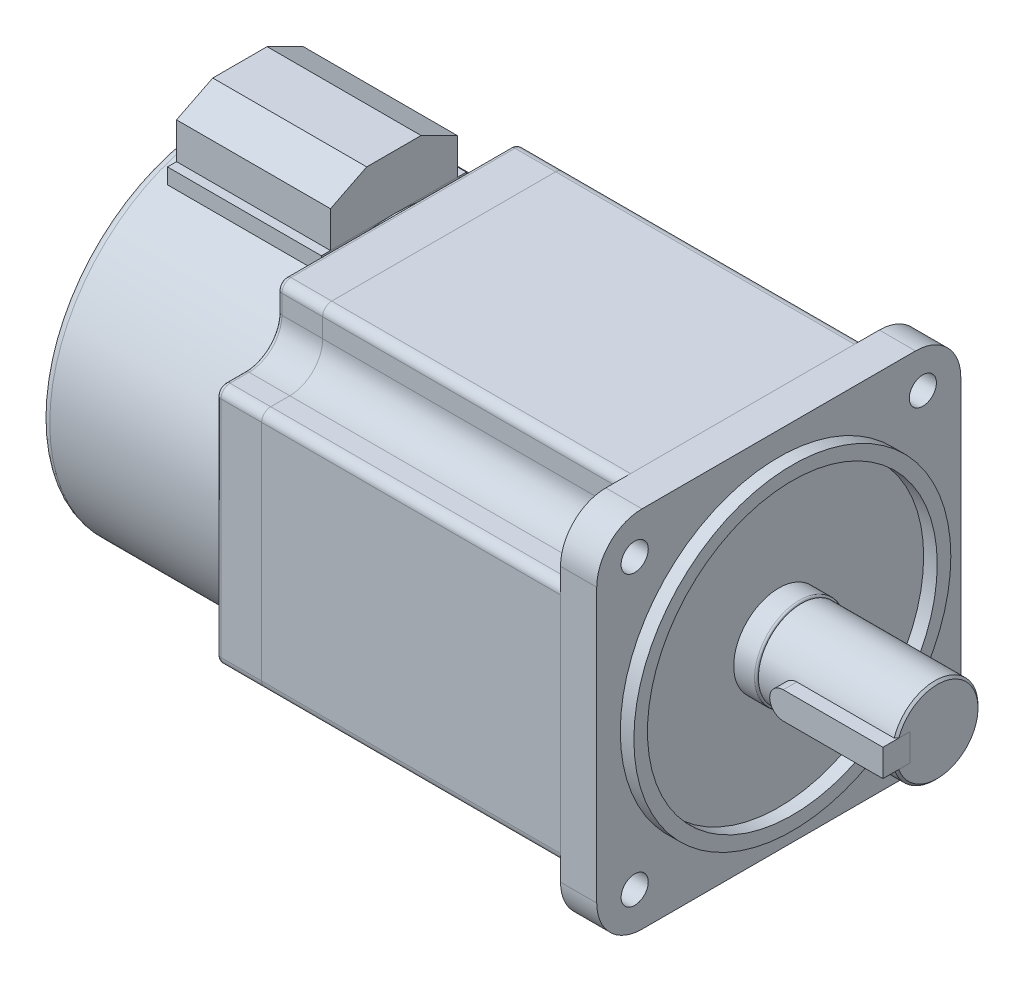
ISO-10303-21;
HEADER;
FILE_DESCRIPTION(('STEP AP214'),'2;1');
FILE_NAME('part.step','',(''),(''),'','','');
FILE_SCHEMA(('AUTOMOTIVE_DESIGN { 1 0 10303 214 1 1 1 1 }'));
ENDSEC;
DATA;
#1=APPLICATION_CONTEXT('core data for automotive mechanical design processes');
#2=APPLICATION_PROTOCOL_DEFINITION('international standard','automotive_design',2000,#1);
#3=PRODUCT_CONTEXT('',#1,'mechanical');
#4=PRODUCT('Part','Part','',(#3));
#5=PRODUCT_RELATED_PRODUCT_CATEGORY('part','',(#4));
#6=PRODUCT_DEFINITION_FORMATION('','',#4);
#7=PRODUCT_DEFINITION_CONTEXT('part definition',#1,'design');
#8=PRODUCT_DEFINITION('design','',#6,#7);
#9=PRODUCT_DEFINITION_SHAPE('','',#8);
#10=(LENGTH_UNIT() NAMED_UNIT(*) SI_UNIT(.MILLI.,.METRE.));
#11=(NAMED_UNIT(*) PLANE_ANGLE_UNIT() SI_UNIT($,.RADIAN.));
#12=(NAMED_UNIT(*) SI_UNIT($,.STERADIAN.) SOLID_ANGLE_UNIT());
#13=UNCERTAINTY_MEASURE_WITH_UNIT(LENGTH_MEASURE(1.E-05),#10,'distance_accuracy_value','');
#14=(GEOMETRIC_REPRESENTATION_CONTEXT(3) GLOBAL_UNCERTAINTY_ASSIGNED_CONTEXT((#13)) GLOBAL_UNIT_ASSIGNED_CONTEXT((#10,
#11,#12)) REPRESENTATION_CONTEXT('',''));
#15=CARTESIAN_POINT('',(0.,0.,0.));
#16=DIRECTION('',(0.,0.,1.));
#17=DIRECTION('',(1.,0.,0.));
#18=AXIS2_PLACEMENT_3D('',#15,#16,#17);
#19=CARTESIAN_POINT('',(-77.,51.,14.));
#20=DIRECTION('',(-1.,0.,0.));
#21=DIRECTION('',(0.,0.,1.));
#22=AXIS2_PLACEMENT_3D('',#19,#20,#21);
#23=PLANE('',#22);
#24=DIRECTION('',(0.,0.,-1.));
#25=VECTOR('',#24,1.);
#26=CARTESIAN_POINT('',(-77.,51.,14.));
#27=LINE('',#26,#25);
#28=CARTESIAN_POINT('',(-77.,51.,6.));
#29=VERTEX_POINT('',#28);
#30=CARTESIAN_POINT('',(-77.,51.,-6.));
#31=VERTEX_POINT('',#30);
#32=EDGE_CURVE('E111',#29,#31,#27,.T.);
#33=ORIENTED_EDGE('',*,*,#32,.F.);
#34=DIRECTION('',(0.,-0.447213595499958,0.894427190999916));
#35=VECTOR('',#34,1.);
#36=CARTESIAN_POINT('',(-77.,47.,14.));
#37=LINE('',#36,#35);
#38=CARTESIAN_POINT('',(-77.,47.,14.));
#39=VERTEX_POINT('',#38);
#40=EDGE_CURVE('E60',#29,#39,#37,.T.);
#41=ORIENTED_EDGE('',*,*,#40,.T.);
#42=DIRECTION('',(0.,-1.,0.));
#43=VECTOR('',#42,1.);
#44=CARTESIAN_POINT('',(-77.,51.,14.));
#45=LINE('',#44,#43);
#46=CARTESIAN_POINT('',(-77.,39.,14.));
#47=VERTEX_POINT('',#46);
#48=EDGE_CURVE('E108',#39,#47,#45,.T.);
#49=ORIENTED_EDGE('',*,*,#48,.T.);
#50=DIRECTION('',(0.,0.,-1.));
#51=VECTOR('',#50,1.);
#52=CARTESIAN_POINT('',(-77.,39.,14.));
#53=LINE('',#52,#51);
#54=CARTESIAN_POINT('',(-77.,39.,-14.));
#55=VERTEX_POINT('',#54);
#56=EDGE_CURVE('E140',#47,#55,#53,.T.);
#57=ORIENTED_EDGE('',*,*,#56,.T.);
#58=DIRECTION('',(0.,-1.,0.));
#59=VECTOR('',#58,1.);
#60=CARTESIAN_POINT('',(-77.,51.,-14.));
#61=LINE('',#60,#59);
#62=CARTESIAN_POINT('',(-77.,47.,-14.));
#63=VERTEX_POINT('',#62);
#64=EDGE_CURVE('E12',#63,#55,#61,.T.);
#65=ORIENTED_EDGE('',*,*,#64,.F.);
#66=DIRECTION('',(0.,0.447213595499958,0.894427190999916));
#67=VECTOR('',#66,1.);
#68=CARTESIAN_POINT('',(-77.,51.,-6.));
#69=LINE('',#68,#67);
#70=EDGE_CURVE('E149',#63,#31,#69,.T.);
#71=ORIENTED_EDGE('',*,*,#70,.T.);
#72=EDGE_LOOP('',(#33,#41,#49,#57,#65,#71));
#73=FACE_BOUND('',#72,.T.);
#74=ADVANCED_FACE('F46',(#73),#23,.F.);
#75=CARTESIAN_POINT('',(-111.,51.,-14.));
#76=DIRECTION('',(0.,0.,1.));
#77=DIRECTION('',(1.,0.,0.));
#78=AXIS2_PLACEMENT_3D('',#75,#76,#77);
#79=PLANE('',#78);
#80=DIRECTION('',(0.,-1.,0.));
#81=VECTOR('',#80,1.);
#82=CARTESIAN_POINT('',(-111.,51.,-14.));
#83=LINE('',#82,#81);
#84=CARTESIAN_POINT('',(-111.,47.,-14.));
#85=VERTEX_POINT('',#84);
#86=CARTESIAN_POINT('',(-111.,39.,-14.));
#87=VERTEX_POINT('',#86);
#88=EDGE_CURVE('E53',#85,#87,#83,.T.);
#89=ORIENTED_EDGE('',*,*,#88,.F.);
#90=DIRECTION('',(-1.,0.,0.));
#91=VECTOR('',#90,1.);
#92=CARTESIAN_POINT('',(-77.,47.,-14.));
#93=LINE('',#92,#91);
#94=EDGE_CURVE('E147',#63,#85,#93,.T.);
#95=ORIENTED_EDGE('',*,*,#94,.F.);
#96=ORIENTED_EDGE('',*,*,#64,.T.);
#97=DIRECTION('',(-1.,0.,0.));
#98=VECTOR('',#97,1.);
#99=CARTESIAN_POINT('',(-111.,39.,-14.));
#100=LINE('',#99,#98);
#101=EDGE_CURVE('E136',#55,#87,#100,.T.);
#102=ORIENTED_EDGE('',*,*,#101,.T.);
#103=EDGE_LOOP('',(#89,#95,#96,#102));
#104=FACE_BOUND('',#103,.T.);
#105=ADVANCED_FACE('F137',(#104),#79,.F.);
#106=CARTESIAN_POINT('',(-111.,51.,14.));
#107=DIRECTION('',(1.,0.,0.));
#108=DIRECTION('',(0.,0.,-1.));
#109=AXIS2_PLACEMENT_3D('',#106,#107,#108);
#110=PLANE('',#109);
#111=DIRECTION('',(0.,-1.,0.));
#112=VECTOR('',#111,1.);
#113=CARTESIAN_POINT('',(-111.,51.,14.));
#114=LINE('',#113,#112);
#115=CARTESIAN_POINT('',(-111.,47.,14.));
#116=VERTEX_POINT('',#115);
#117=CARTESIAN_POINT('',(-111.,39.,14.));
#118=VERTEX_POINT('',#117);
#119=EDGE_CURVE('E117',#116,#118,#114,.T.);
#120=ORIENTED_EDGE('',*,*,#119,.F.);
#121=DIRECTION('',(0.,-0.447213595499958,0.894427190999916));
#122=VECTOR('',#121,1.);
#123=CARTESIAN_POINT('',(-111.,47.,14.));
#124=LINE('',#123,#122);
#125=CARTESIAN_POINT('',(-111.,51.,6.));
#126=VERTEX_POINT('',#125);
#127=EDGE_CURVE('E99',#126,#116,#124,.T.);
#128=ORIENTED_EDGE('',*,*,#127,.F.);
#129=DIRECTION('',(0.,0.,1.));
#130=VECTOR('',#129,1.);
#131=CARTESIAN_POINT('',(-111.,51.,14.));
#132=LINE('',#131,#130);
#133=CARTESIAN_POINT('',(-111.,51.,-6.));
#134=VERTEX_POINT('',#133);
#135=EDGE_CURVE('E118',#134,#126,#132,.T.);
#136=ORIENTED_EDGE('',*,*,#135,.F.);
#137=DIRECTION('',(0.,0.447213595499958,0.894427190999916));
#138=VECTOR('',#137,1.);
#139=CARTESIAN_POINT('',(-111.,51.,-6.));
#140=LINE('',#139,#138);
#141=EDGE_CURVE('E68',#85,#134,#140,.T.);
#142=ORIENTED_EDGE('',*,*,#141,.F.);
#143=ORIENTED_EDGE('',*,*,#88,.T.);
#144=DIRECTION('',(0.,0.,1.));
#145=VECTOR('',#144,1.);
#146=CARTESIAN_POINT('',(-111.,39.,14.));
#147=LINE('',#146,#145);
#148=EDGE_CURVE('E131',#87,#118,#147,.T.);
#149=ORIENTED_EDGE('',*,*,#148,.T.);
#150=EDGE_LOOP('',(#120,#128,#136,#142,#143,#149));
#151=FACE_BOUND('',#150,.T.);
#152=ADVANCED_FACE('F129',(#151),#110,.F.);
#153=CARTESIAN_POINT('',(-111.,51.,14.));
#154=DIRECTION('',(0.,0.,-1.));
#155=DIRECTION('',(-1.,0.,0.));
#156=AXIS2_PLACEMENT_3D('',#153,#154,#155);
#157=PLANE('',#156);
#158=ORIENTED_EDGE('',*,*,#48,.F.);
#159=DIRECTION('',(-1.,0.,0.));
#160=VECTOR('',#159,1.);
#161=CARTESIAN_POINT('',(-77.,47.,14.));
#162=LINE('',#161,#160);
#163=EDGE_CURVE('E96',#39,#116,#162,.T.);
#164=ORIENTED_EDGE('',*,*,#163,.T.);
#165=ORIENTED_EDGE('',*,*,#119,.T.);
#166=DIRECTION('',(1.,0.,0.));
#167=VECTOR('',#166,1.);
#168=CARTESIAN_POINT('',(-111.,39.,14.));
#169=LINE('',#168,#167);
#170=EDGE_CURVE('E115',#118,#47,#169,.T.);
#171=ORIENTED_EDGE('',*,*,#170,.T.);
#172=EDGE_LOOP('',(#158,#164,#165,#171));
#173=FACE_BOUND('',#172,.T.);
#174=ADVANCED_FACE('F113',(#173),#157,.F.);
#175=CARTESIAN_POINT('',(0.,51.,0.));
#176=DIRECTION('',(0.,-1.,0.));
#177=DIRECTION('',(0.,0.,-1.));
#178=AXIS2_PLACEMENT_3D('',#175,#176,#177);
#179=PLANE('',#178);
#180=ORIENTED_EDGE('',*,*,#135,.T.);
#181=DIRECTION('',(-1.,0.,0.));
#182=VECTOR('',#181,1.);
#183=CARTESIAN_POINT('',(-77.,51.,6.));
#184=LINE('',#183,#182);
#185=EDGE_CURVE('E103',#29,#126,#184,.T.);
#186=ORIENTED_EDGE('',*,*,#185,.F.);
#187=ORIENTED_EDGE('',*,*,#32,.T.);
#188=DIRECTION('',(-1.,0.,0.));
#189=VECTOR('',#188,1.);
#190=CARTESIAN_POINT('',(-77.,51.,-6.));
#191=LINE('',#190,#189);
#192=EDGE_CURVE('E144',#31,#134,#191,.T.);
#193=ORIENTED_EDGE('',*,*,#192,.T.);
#194=EDGE_LOOP('',(#180,#186,#187,#193));
#195=FACE_BOUND('',#194,.T.);
#196=ADVANCED_FACE('F155',(#195),#179,.F.);
#197=CARTESIAN_POINT('',(0.,39.,0.));
#198=DIRECTION('',(0.,-1.,0.));
#199=DIRECTION('',(0.,0.,-1.));
#200=AXIS2_PLACEMENT_3D('',#197,#198,#199);
#201=PLANE('',#200);
#202=ORIENTED_EDGE('',*,*,#56,.F.);
#203=ORIENTED_EDGE('',*,*,#170,.F.);
#204=ORIENTED_EDGE('',*,*,#148,.F.);
#205=ORIENTED_EDGE('',*,*,#101,.F.);
#206=EDGE_LOOP('',(#202,#203,#204,#205));
#207=FACE_BOUND('',#206,.T.);
#208=ADVANCED_FACE('F142',(#207),#201,.T.);
#209=CARTESIAN_POINT('',(-77.,51.,-6.));
#210=DIRECTION('',(0.,-0.894427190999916,0.447213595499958));
#211=DIRECTION('',(0.,-0.447213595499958,-0.894427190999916));
#212=AXIS2_PLACEMENT_3D('',#209,#210,#211);
#213=PLANE('',#212);
#214=ORIENTED_EDGE('',*,*,#141,.T.);
#215=ORIENTED_EDGE('',*,*,#192,.F.);
#216=ORIENTED_EDGE('',*,*,#70,.F.);
#217=ORIENTED_EDGE('',*,*,#94,.T.);
#218=EDGE_LOOP('',(#214,#215,#216,#217));
#219=FACE_BOUND('',#218,.T.);
#220=ADVANCED_FACE('F156',(#219),#213,.F.);
#221=CARTESIAN_POINT('',(-77.,47.,14.));
#222=DIRECTION('',(0.,-0.894427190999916,-0.447213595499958));
#223=DIRECTION('',(0.,0.447213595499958,-0.894427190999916));
#224=AXIS2_PLACEMENT_3D('',#221,#222,#223);
#225=PLANE('',#224);
#226=ORIENTED_EDGE('',*,*,#127,.T.);
#227=ORIENTED_EDGE('',*,*,#163,.F.);
#228=ORIENTED_EDGE('',*,*,#40,.F.);
#229=ORIENTED_EDGE('',*,*,#185,.T.);
#230=EDGE_LOOP('',(#226,#227,#228,#229));
#231=FACE_BOUND('',#230,.T.);
#232=ADVANCED_FACE('F97',(#231),#225,.F.);
#233=CLOSED_SHELL('',(#74,#105,#152,#174,#196,#208,#220,#232));
#234=MANIFOLD_SOLID_BREP('B2',#233);
#235=CARTESIAN_POINT('',(-116.,0.,0.));
#236=DIRECTION('',(1.,0.,0.));
#237=DIRECTION('',(0.,0.,-1.));
#238=AXIS2_PLACEMENT_3D('',#235,#236,#237);
#239=CYLINDRICAL_SURFACE('',#238,39.);
#240=DIRECTION('',(1.,0.,0.));
#241=VECTOR('',#240,1.);
#242=CARTESIAN_POINT('',(-116.,35.5668384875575,16.));
#243=LINE('',#242,#241);
#244=CARTESIAN_POINT('',(-77.,35.5668384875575,16.));
#245=VERTEX_POINT('',#244);
#246=CARTESIAN_POINT('',(-111.,35.5668384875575,16.));
#247=VERTEX_POINT('',#246);
#248=EDGE_CURVE('E44',#245,#247,#243,.F.);
#249=ORIENTED_EDGE('',*,*,#248,.T.);
#250=CARTESIAN_POINT('',(-111.,0.,0.));
#251=DIRECTION('',(-1.,0.,0.));
#252=DIRECTION('',(0.,0.,1.));
#253=AXIS2_PLACEMENT_3D('',#250,#251,#252);
#254=CIRCLE('',#253,39.);
#255=CARTESIAN_POINT('',(-111.,39.,0.));
#256=VERTEX_POINT('',#255);
#257=EDGE_CURVE('E320',#247,#256,#254,.T.);
#258=ORIENTED_EDGE('',*,*,#257,.T.);
#259=CARTESIAN_POINT('',(-111.,0.,0.));
#260=DIRECTION('',(1.,0.,0.));
#261=DIRECTION('',(0.,0.,-1.));
#262=AXIS2_PLACEMENT_3D('',#259,#260,#261);
#263=CIRCLE('',#262,39.);
#264=CARTESIAN_POINT('',(-111.,35.5668384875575,-16.));
#265=VERTEX_POINT('',#264);
#266=EDGE_CURVE('E304',#265,#256,#263,.T.);
#267=ORIENTED_EDGE('',*,*,#266,.F.);
#268=DIRECTION('',(1.,0.,0.));
#269=VECTOR('',#268,1.);
#270=CARTESIAN_POINT('',(-116.,35.5668384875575,-16.));
#271=LINE('',#270,#269);
#272=CARTESIAN_POINT('',(-77.,35.5668384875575,-16.));
#273=VERTEX_POINT('',#272);
#274=EDGE_CURVE('E240',#265,#273,#271,.T.);
#275=ORIENTED_EDGE('',*,*,#274,.T.);
#276=CARTESIAN_POINT('',(-77.,0.,0.));
#277=DIRECTION('',(1.,0.,0.));
#278=DIRECTION('',(0.,0.,-1.));
#279=AXIS2_PLACEMENT_3D('',#276,#277,#278);
#280=CIRCLE('',#279,39.);
#281=CARTESIAN_POINT('',(-77.,39.,0.));
#282=VERTEX_POINT('',#281);
#283=EDGE_CURVE('E303',#273,#282,#280,.T.);
#284=ORIENTED_EDGE('',*,*,#283,.T.);
#285=CARTESIAN_POINT('',(-77.,0.,0.));
#286=DIRECTION('',(-1.,0.,0.));
#287=DIRECTION('',(0.,0.,1.));
#288=AXIS2_PLACEMENT_3D('',#285,#286,#287);
#289=CIRCLE('',#288,39.);
#290=EDGE_CURVE('E255',#245,#282,#289,.T.);
#291=ORIENTED_EDGE('',*,*,#290,.F.);
#292=EDGE_LOOP('',(#249,#258,#267,#275,#284,#291));
#293=FACE_BOUND('',#292,.T.);
#294=CARTESIAN_POINT('',(-114.,0.,0.));
#295=DIRECTION('',(-1.,0.,0.));
#296=DIRECTION('',(0.,0.,1.));
#297=AXIS2_PLACEMENT_3D('',#294,#295,#296);
#298=CIRCLE('',#297,39.);
#299=CARTESIAN_POINT('',(-114.,0.,39.));
#300=VERTEX_POINT('',#299);
#301=EDGE_CURVE('E317',#300,#300,#298,.F.);
#302=ORIENTED_EDGE('',*,*,#301,.T.);
#303=EDGE_LOOP('',(#302));
#304=FACE_BOUND('',#303,.T.);
#305=CARTESIAN_POINT('',(-76.,0.,0.));
#306=DIRECTION('',(-1.,0.,0.));
#307=DIRECTION('',(0.,0.,1.));
#308=AXIS2_PLACEMENT_3D('',#305,#306,#307);
#309=CIRCLE('',#308,39.);
#310=CARTESIAN_POINT('',(-76.,0.,39.));
#311=VERTEX_POINT('',#310);
#312=EDGE_CURVE('E311',#311,#311,#309,.T.);
#313=ORIENTED_EDGE('',*,*,#312,.T.);
#314=EDGE_LOOP('',(#313));
#315=FACE_BOUND('',#314,.T.);
#316=ADVANCED_FACE('F232',(#293,#304,#315),#239,.T.);
#317=CARTESIAN_POINT('',(-116.,0.,0.));
#318=DIRECTION('',(-1.,0.,0.));
#319=DIRECTION('',(0.,0.,1.));
#320=AXIS2_PLACEMENT_3D('',#317,#318,#319);
#321=PLANE('',#320);
#322=CARTESIAN_POINT('',(-116.,0.,0.));
#323=DIRECTION('',(-1.,0.,0.));
#324=DIRECTION('',(0.,0.,1.));
#325=AXIS2_PLACEMENT_3D('',#322,#323,#324);
#326=CIRCLE('',#325,37.);
#327=CARTESIAN_POINT('',(-116.,0.,37.));
#328=VERTEX_POINT('',#327);
#329=EDGE_CURVE('E314',#328,#328,#326,.T.);
#330=ORIENTED_EDGE('',*,*,#329,.T.);
#331=EDGE_LOOP('',(#330));
#332=FACE_BOUND('',#331,.T.);
#333=ADVANCED_FACE('F349',(#332),#321,.T.);
#334=CARTESIAN_POINT('',(-76.,0.,0.));
#335=DIRECTION('',(-1.,0.,0.));
#336=DIRECTION('',(0.,0.,1.));
#337=AXIS2_PLACEMENT_3D('',#334,#335,#336);
#338=PLANE('',#337);
#339=ORIENTED_EDGE('',*,*,#312,.F.);
#340=EDGE_LOOP('',(#339));
#341=FACE_BOUND('',#340,.T.);
#342=ADVANCED_FACE('F353',(#341),#338,.F.);
#343=CARTESIAN_POINT('',(-114.,0.,0.));
#344=DIRECTION('',(-1.,0.,0.));
#345=DIRECTION('',(0.,0.,1.));
#346=AXIS2_PLACEMENT_3D('',#343,#344,#345);
#347=TOROIDAL_SURFACE('',#346,37.,2.);
#348=ORIENTED_EDGE('',*,*,#301,.F.);
#349=EDGE_LOOP('',(#348));
#350=FACE_BOUND('',#349,.T.);
#351=ORIENTED_EDGE('',*,*,#329,.F.);
#352=EDGE_LOOP('',(#351));
#353=FACE_BOUND('',#352,.T.);
#354=ADVANCED_FACE('F234',(#350,#353),#347,.T.);
#355=CARTESIAN_POINT('',(-77.,39.,16.));
#356=DIRECTION('',(-1.,0.,0.));
#357=DIRECTION('',(0.,0.,1.));
#358=AXIS2_PLACEMENT_3D('',#355,#356,#357);
#359=PLANE('',#358);
#360=DIRECTION('',(0.,-1.,0.));
#361=VECTOR('',#360,1.);
#362=CARTESIAN_POINT('',(-77.,39.,16.));
#363=LINE('',#362,#361);
#364=CARTESIAN_POINT('',(-77.,39.,16.));
#365=VERTEX_POINT('',#364);
#366=EDGE_CURVE('E332',#365,#245,#363,.T.);
#367=ORIENTED_EDGE('',*,*,#366,.T.);
#368=ORIENTED_EDGE('',*,*,#290,.T.);
#369=DIRECTION('',(0.,0.,-1.));
#370=VECTOR('',#369,1.);
#371=CARTESIAN_POINT('',(-77.,39.,16.));
#372=LINE('',#371,#370);
#373=EDGE_CURVE('E287',#365,#282,#372,.T.);
#374=ORIENTED_EDGE('',*,*,#373,.F.);
#375=EDGE_LOOP('',(#367,#368,#374));
#376=FACE_BOUND('',#375,.T.);
#377=ADVANCED_FACE('F336',(#376),#359,.F.);
#378=CARTESIAN_POINT('',(-77.,39.,-16.));
#379=VERTEX_POINT('',#378);
#380=EDGE_CURVE('E281',#282,#379,#372,.T.);
#381=ORIENTED_EDGE('',*,*,#380,.F.);
#382=ORIENTED_EDGE('',*,*,#283,.F.);
#383=DIRECTION('',(0.,-1.,0.));
#384=VECTOR('',#383,1.);
#385=CARTESIAN_POINT('',(-77.,39.,-16.));
#386=LINE('',#385,#384);
#387=EDGE_CURVE('E295',#379,#273,#386,.T.);
#388=ORIENTED_EDGE('',*,*,#387,.F.);
#389=EDGE_LOOP('',(#381,#382,#388));
#390=FACE_BOUND('',#389,.T.);
#391=ADVANCED_FACE('F302',(#390),#359,.F.);
#392=CARTESIAN_POINT('',(-111.,39.,-16.));
#393=DIRECTION('',(0.,0.,1.));
#394=DIRECTION('',(1.,0.,0.));
#395=AXIS2_PLACEMENT_3D('',#392,#393,#394);
#396=PLANE('',#395);
#397=ORIENTED_EDGE('',*,*,#387,.T.);
#398=ORIENTED_EDGE('',*,*,#274,.F.);
#399=DIRECTION('',(0.,-1.,0.));
#400=VECTOR('',#399,1.);
#401=CARTESIAN_POINT('',(-111.,39.,-16.));
#402=LINE('',#401,#400);
#403=CARTESIAN_POINT('',(-111.,39.,-16.));
#404=VERTEX_POINT('',#403);
#405=EDGE_CURVE('E298',#404,#265,#402,.T.);
#406=ORIENTED_EDGE('',*,*,#405,.F.);
#407=DIRECTION('',(-1.,0.,0.));
#408=VECTOR('',#407,1.);
#409=CARTESIAN_POINT('',(-111.,39.,-16.));
#410=LINE('',#409,#408);
#411=EDGE_CURVE('E285',#379,#404,#410,.T.);
#412=ORIENTED_EDGE('',*,*,#411,.F.);
#413=EDGE_LOOP('',(#397,#398,#406,#412));
#414=FACE_BOUND('',#413,.T.);
#415=ADVANCED_FACE('F294',(#414),#396,.F.);
#416=CARTESIAN_POINT('',(-111.,39.,16.));
#417=DIRECTION('',(1.,0.,0.));
#418=DIRECTION('',(0.,0.,-1.));
#419=AXIS2_PLACEMENT_3D('',#416,#417,#418);
#420=PLANE('',#419);
#421=ORIENTED_EDGE('',*,*,#405,.T.);
#422=ORIENTED_EDGE('',*,*,#266,.T.);
#423=DIRECTION('',(0.,0.,1.));
#424=VECTOR('',#423,1.);
#425=CARTESIAN_POINT('',(-111.,39.,16.));
#426=LINE('',#425,#424);
#427=EDGE_CURVE('E329',#404,#256,#426,.T.);
#428=ORIENTED_EDGE('',*,*,#427,.F.);
#429=EDGE_LOOP('',(#421,#422,#428));
#430=FACE_BOUND('',#429,.T.);
#431=ADVANCED_FACE('F327',(#430),#420,.F.);
#432=CARTESIAN_POINT('',(-111.,39.,16.));
#433=VERTEX_POINT('',#432);
#434=EDGE_CURVE('E300',#256,#433,#426,.T.);
#435=ORIENTED_EDGE('',*,*,#434,.F.);
#436=ORIENTED_EDGE('',*,*,#257,.F.);
#437=DIRECTION('',(0.,-1.,0.));
#438=VECTOR('',#437,1.);
#439=CARTESIAN_POINT('',(-111.,39.,16.));
#440=LINE('',#439,#438);
#441=EDGE_CURVE('E247',#433,#247,#440,.T.);
#442=ORIENTED_EDGE('',*,*,#441,.F.);
#443=EDGE_LOOP('',(#435,#436,#442));
#444=FACE_BOUND('',#443,.T.);
#445=ADVANCED_FACE('F339',(#444),#420,.F.);
#446=CARTESIAN_POINT('',(-111.,39.,16.));
#447=DIRECTION('',(0.,0.,-1.));
#448=DIRECTION('',(-1.,0.,0.));
#449=AXIS2_PLACEMENT_3D('',#446,#447,#448);
#450=PLANE('',#449);
#451=ORIENTED_EDGE('',*,*,#441,.T.);
#452=ORIENTED_EDGE('',*,*,#248,.F.);
#453=ORIENTED_EDGE('',*,*,#366,.F.);
#454=DIRECTION('',(1.,0.,0.));
#455=VECTOR('',#454,1.);
#456=CARTESIAN_POINT('',(-111.,39.,16.));
#457=LINE('',#456,#455);
#458=EDGE_CURVE('E330',#433,#365,#457,.T.);
#459=ORIENTED_EDGE('',*,*,#458,.F.);
#460=EDGE_LOOP('',(#451,#452,#453,#459));
#461=FACE_BOUND('',#460,.T.);
#462=ADVANCED_FACE('F337',(#461),#450,.F.);
#463=CARTESIAN_POINT('',(0.,39.,0.));
#464=DIRECTION('',(0.,-1.,0.));
#465=DIRECTION('',(0.,0.,-1.));
#466=AXIS2_PLACEMENT_3D('',#463,#464,#465);
#467=PLANE('',#466);
#468=ORIENTED_EDGE('',*,*,#373,.T.);
#469=ORIENTED_EDGE('',*,*,#380,.T.);
#470=ORIENTED_EDGE('',*,*,#411,.T.);
#471=ORIENTED_EDGE('',*,*,#427,.T.);
#472=ORIENTED_EDGE('',*,*,#434,.T.);
#473=ORIENTED_EDGE('',*,*,#458,.T.);
#474=EDGE_LOOP('',(#468,#469,#470,#471,#472,#473));
#475=FACE_BOUND('',#474,.T.);
#476=ADVANCED_FACE('F283',(#475),#467,.F.);
#477=CLOSED_SHELL('',(#316,#333,#342,#354,#377,#391,#415,#431,#445,#462,#476));
#478=MANIFOLD_SOLID_BREP('B6',#477);
#479=CARTESIAN_POINT('',(21.,0.,12.));
#480=DIRECTION('',(0.,0.,-1.));
#481=DIRECTION('',(-1.,0.,0.));
#482=AXIS2_PLACEMENT_3D('',#479,#480,#481);
#483=CYLINDRICAL_SURFACE('',#482,3.);
#484=CARTESIAN_POINT('',(21.,0.,6.));
#485=DIRECTION('',(0.,0.,1.));
#486=DIRECTION('',(1.,0.,0.));
#487=AXIS2_PLACEMENT_3D('',#484,#485,#486);
#488=CIRCLE('',#487,3.);
#489=CARTESIAN_POINT('',(21.,3.,6.));
#490=VERTEX_POINT('',#489);
#491=CARTESIAN_POINT('',(21.,-3.,6.));
#492=VERTEX_POINT('',#491);
#493=EDGE_CURVE('E510',#490,#492,#488,.T.);
#494=ORIENTED_EDGE('',*,*,#493,.T.);
#495=DIRECTION('',(0.,0.,-1.));
#496=VECTOR('',#495,1.);
#497=CARTESIAN_POINT('',(21.,-3.,12.));
#498=LINE('',#497,#496);
#499=CARTESIAN_POINT('',(21.,-3.,12.));
#500=VERTEX_POINT('',#499);
#501=EDGE_CURVE('E230',#500,#492,#498,.T.);
#502=ORIENTED_EDGE('',*,*,#501,.F.);
#503=CARTESIAN_POINT('',(21.,0.,12.));
#504=DIRECTION('',(0.,0.,1.));
#505=DIRECTION('',(1.,0.,0.));
#506=AXIS2_PLACEMENT_3D('',#503,#504,#505);
#507=CIRCLE('',#506,3.);
#508=CARTESIAN_POINT('',(21.,3.,12.));
#509=VERTEX_POINT('',#508);
#510=EDGE_CURVE('E498',#509,#500,#507,.T.);
#511=ORIENTED_EDGE('',*,*,#510,.F.);
#512=DIRECTION('',(0.,0.,-1.));
#513=VECTOR('',#512,1.);
#514=CARTESIAN_POINT('',(21.,3.,12.));
#515=LINE('',#514,#513);
#516=EDGE_CURVE('E506',#509,#490,#515,.T.);
#517=ORIENTED_EDGE('',*,*,#516,.T.);
#518=EDGE_LOOP('',(#494,#502,#511,#517));
#519=FACE_BOUND('',#518,.T.);
#520=ADVANCED_FACE('F447',(#519),#483,.T.);
#521=CARTESIAN_POINT('',(43.,-3.,12.));
#522=DIRECTION('',(0.,1.,0.));
#523=DIRECTION('',(-1.,0.,0.));
#524=AXIS2_PLACEMENT_3D('',#521,#522,#523);
#525=PLANE('',#524);
#526=DIRECTION('',(1.,0.,0.));
#527=VECTOR('',#526,1.);
#528=CARTESIAN_POINT('',(43.,-3.,6.));
#529=LINE('',#528,#527);
#530=CARTESIAN_POINT('',(43.,-3.,6.));
#531=VERTEX_POINT('',#530);
#532=EDGE_CURVE('E502',#492,#531,#529,.T.);
#533=ORIENTED_EDGE('',*,*,#532,.T.);
#534=DIRECTION('',(0.,0.,-1.));
#535=VECTOR('',#534,1.);
#536=CARTESIAN_POINT('',(43.,-3.,12.));
#537=LINE('',#536,#535);
#538=CARTESIAN_POINT('',(43.,-3.,12.));
#539=VERTEX_POINT('',#538);
#540=EDGE_CURVE('E455',#539,#531,#537,.T.);
#541=ORIENTED_EDGE('',*,*,#540,.F.);
#542=DIRECTION('',(1.,0.,0.));
#543=VECTOR('',#542,1.);
#544=CARTESIAN_POINT('',(43.,-3.,12.));
#545=LINE('',#544,#543);
#546=EDGE_CURVE('E493',#500,#539,#545,.T.);
#547=ORIENTED_EDGE('',*,*,#546,.F.);
#548=ORIENTED_EDGE('',*,*,#501,.T.);
#549=EDGE_LOOP('',(#533,#541,#547,#548));
#550=FACE_BOUND('',#549,.T.);
#551=ADVANCED_FACE('F501',(#550),#525,.F.);
#552=CARTESIAN_POINT('',(43.,3.,12.));
#553=DIRECTION('',(-1.,0.,0.));
#554=DIRECTION('',(0.,0.,1.));
#555=AXIS2_PLACEMENT_3D('',#552,#553,#554);
#556=PLANE('',#555);
#557=DIRECTION('',(0.,1.,0.));
#558=VECTOR('',#557,1.);
#559=CARTESIAN_POINT('',(43.,3.,6.));
#560=LINE('',#559,#558);
#561=CARTESIAN_POINT('',(43.,3.,6.));
#562=VERTEX_POINT('',#561);
#563=EDGE_CURVE('E480',#531,#562,#560,.T.);
#564=ORIENTED_EDGE('',*,*,#563,.T.);
#565=DIRECTION('',(0.,0.,-1.));
#566=VECTOR('',#565,1.);
#567=CARTESIAN_POINT('',(43.,3.,12.));
#568=LINE('',#567,#566);
#569=CARTESIAN_POINT('',(43.,3.,12.));
#570=VERTEX_POINT('',#569);
#571=EDGE_CURVE('E503',#570,#562,#568,.T.);
#572=ORIENTED_EDGE('',*,*,#571,.F.);
#573=DIRECTION('',(0.,1.,0.));
#574=VECTOR('',#573,1.);
#575=CARTESIAN_POINT('',(43.,3.,12.));
#576=LINE('',#575,#574);
#577=EDGE_CURVE('E496',#539,#570,#576,.T.);
#578=ORIENTED_EDGE('',*,*,#577,.F.);
#579=ORIENTED_EDGE('',*,*,#540,.T.);
#580=EDGE_LOOP('',(#564,#572,#578,#579));
#581=FACE_BOUND('',#580,.T.);
#582=ADVANCED_FACE('F504',(#581),#556,.F.);
#583=CARTESIAN_POINT('',(21.,3.,12.));
#584=DIRECTION('',(0.,-1.,0.));
#585=DIRECTION('',(1.,0.,0.));
#586=AXIS2_PLACEMENT_3D('',#583,#584,#585);
#587=PLANE('',#586);
#588=DIRECTION('',(-1.,0.,0.));
#589=VECTOR('',#588,1.);
#590=CARTESIAN_POINT('',(21.,3.,6.));
#591=LINE('',#590,#589);
#592=EDGE_CURVE('E486',#562,#490,#591,.T.);
#593=ORIENTED_EDGE('',*,*,#592,.T.);
#594=ORIENTED_EDGE('',*,*,#516,.F.);
#595=DIRECTION('',(-1.,0.,0.));
#596=VECTOR('',#595,1.);
#597=CARTESIAN_POINT('',(21.,3.,12.));
#598=LINE('',#597,#596);
#599=EDGE_CURVE('E463',#570,#509,#598,.T.);
#600=ORIENTED_EDGE('',*,*,#599,.F.);
#601=ORIENTED_EDGE('',*,*,#571,.T.);
#602=EDGE_LOOP('',(#593,#594,#600,#601));
#603=FACE_BOUND('',#602,.T.);
#604=ADVANCED_FACE('F517',(#603),#587,.F.);
#605=CARTESIAN_POINT('',(21.,0.,12.));
#606=DIRECTION('',(0.,0.,1.));
#607=DIRECTION('',(1.,0.,0.));
#608=AXIS2_PLACEMENT_3D('',#605,#606,#607);
#609=PLANE('',#608);
#610=ORIENTED_EDGE('',*,*,#510,.T.);
#611=ORIENTED_EDGE('',*,*,#546,.T.);
#612=ORIENTED_EDGE('',*,*,#577,.T.);
#613=ORIENTED_EDGE('',*,*,#599,.T.);
#614=EDGE_LOOP('',(#610,#611,#612,#613));
#615=FACE_BOUND('',#614,.T.);
#616=ADVANCED_FACE('F494',(#615),#609,.T.);
#617=CARTESIAN_POINT('',(21.,0.,6.));
#618=DIRECTION('',(0.,0.,1.));
#619=DIRECTION('',(1.,0.,0.));
#620=AXIS2_PLACEMENT_3D('',#617,#618,#619);
#621=PLANE('',#620);
#622=ORIENTED_EDGE('',*,*,#493,.F.);
#623=ORIENTED_EDGE('',*,*,#592,.F.);
#624=ORIENTED_EDGE('',*,*,#563,.F.);
#625=ORIENTED_EDGE('',*,*,#532,.F.);
#626=EDGE_LOOP('',(#622,#623,#624,#625));
#627=FACE_BOUND('',#626,.T.);
#628=ADVANCED_FACE('F520',(#627),#621,.F.);
#629=CLOSED_SHELL('',(#520,#551,#582,#604,#616,#628));
#630=MANIFOLD_SOLID_BREP('B38',#629);
#631=CARTESIAN_POINT('',(43.,0.,0.));
#632=DIRECTION('',(-1.,0.,0.));
#633=DIRECTION('',(0.,0.,1.));
#634=AXIS2_PLACEMENT_3D('',#631,#632,#633);
#635=CYLINDRICAL_SURFACE('',#634,9.5);
#636=DIRECTION('',(-1.,0.,0.));
#637=VECTOR('',#636,1.);
#638=CARTESIAN_POINT('',(43.,3.,9.01387818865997));
#639=LINE('',#638,#637);
#640=CARTESIAN_POINT('',(21.,3.,9.01387818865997));
#641=VERTEX_POINT('',#640);
#642=CARTESIAN_POINT('',(42.5,3.,9.01387818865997));
#643=VERTEX_POINT('',#642);
#644=EDGE_CURVE('E666',#641,#643,#639,.F.);
#645=ORIENTED_EDGE('',*,*,#644,.T.);
#646=CARTESIAN_POINT('',(42.5,0.,0.));
#647=DIRECTION('',(1.,0.,0.));
#648=DIRECTION('',(0.,0.,-1.));
#649=AXIS2_PLACEMENT_3D('',#646,#647,#648);
#650=CIRCLE('',#649,9.5);
#651=CARTESIAN_POINT('',(42.5,-3.,9.01387818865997));
#652=VERTEX_POINT('',#651);
#653=EDGE_CURVE('E594',#643,#652,#650,.F.);
#654=ORIENTED_EDGE('',*,*,#653,.T.);
#655=DIRECTION('',(-1.,0.,0.));
#656=VECTOR('',#655,1.);
#657=CARTESIAN_POINT('',(43.,-3.,9.01387818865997));
#658=LINE('',#657,#656);
#659=CARTESIAN_POINT('',(21.,-3.,9.01387818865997));
#660=VERTEX_POINT('',#659);
#661=EDGE_CURVE('E661',#652,#660,#658,.T.);
#662=ORIENTED_EDGE('',*,*,#661,.T.);
#663=CARTESIAN_POINT('',(21.,-3.,9.01387818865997));
#664=CARTESIAN_POINT('',(20.9178884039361,-3.00001051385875,9.0138659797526));
#665=CARTESIAN_POINT('',(20.8357837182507,-2.99662905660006,9.01499989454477));
#666=CARTESIAN_POINT('',(20.6722056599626,-2.98316404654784,9.01946917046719));
#667=CARTESIAN_POINT('',(20.5907321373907,-2.97308213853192,9.02280399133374));
#668=CARTESIAN_POINT('',(20.4292133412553,-2.94633448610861,9.03157240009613));
#669=CARTESIAN_POINT('',(20.3491647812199,-2.92968675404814,9.03700024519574));
#670=CARTESIAN_POINT('',(20.1908532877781,-2.88997412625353,9.04977799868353));
#671=CARTESIAN_POINT('',(20.112590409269,-2.86690903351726,9.05712796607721));
#672=CARTESIAN_POINT('',(19.8813586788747,-2.78838156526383,9.08173850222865));
#673=CARTESIAN_POINT('',(19.7317258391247,-2.72354999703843,9.10157261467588));
#674=CARTESIAN_POINT('',(19.4454502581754,-2.57094386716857,9.14584733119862));
#675=CARTESIAN_POINT('',(19.3088145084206,-2.48315705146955,9.17029039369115));
#676=CARTESIAN_POINT('',(19.0475918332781,-2.2838388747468,9.22198403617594));
#677=CARTESIAN_POINT('',(18.9235225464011,-2.17164444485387,9.24929895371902));
#678=CARTESIAN_POINT('',(18.6956125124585,-1.92811437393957,9.30311268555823));
#679=CARTESIAN_POINT('',(18.5917752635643,-1.79677542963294,9.32961135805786));
#680=CARTESIAN_POINT('',(18.4049616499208,-1.51492697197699,9.37954779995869));
#681=CARTESIAN_POINT('',(18.3225238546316,-1.36404405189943,9.40290050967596));
#682=CARTESIAN_POINT('',(18.184403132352,-1.049697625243,9.44315613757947));
#683=CARTESIAN_POINT('',(18.128712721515,-0.886237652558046,9.46006085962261));
#684=CARTESIAN_POINT('',(18.0474069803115,-0.556831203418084,9.48505937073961));
#685=CARTESIAN_POINT('',(18.0209003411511,-0.391124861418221,9.49341369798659));
#686=CARTESIAN_POINT('',(17.9958889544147,-0.0574168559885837,9.50129109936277));
#687=CARTESIAN_POINT('',(17.9973782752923,0.110584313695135,9.50081604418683));
#688=CARTESIAN_POINT('',(18.0277344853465,0.43782817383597,9.49126851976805));
#689=CARTESIAN_POINT('',(18.0556344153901,0.597170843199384,9.48249971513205));
#690=CARTESIAN_POINT('',(18.1364309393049,0.908782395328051,9.45772480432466));
#691=CARTESIAN_POINT('',(18.1893288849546,1.06105089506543,9.44171830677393));
#692=CARTESIAN_POINT('',(18.319232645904,1.35640803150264,9.40386197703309));
#693=CARTESIAN_POINT('',(18.3965292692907,1.4993594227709,9.38194214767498));
#694=CARTESIAN_POINT('',(18.5728017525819,1.77055948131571,9.33456474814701));
#695=CARTESIAN_POINT('',(18.6717829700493,1.89880450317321,9.309106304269));
#696=CARTESIAN_POINT('',(18.8935531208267,2.14270544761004,9.25608223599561));
#697=CARTESIAN_POINT('',(19.0171739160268,2.25759649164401,9.22847303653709));
#698=CARTESIAN_POINT('',(19.2822127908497,2.46526929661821,9.17518254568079));
#699=CARTESIAN_POINT('',(19.423636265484,2.55804433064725,9.14950184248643));
#700=CARTESIAN_POINT('',(19.7224948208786,2.71978065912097,9.10274637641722));
#701=CARTESIAN_POINT('',(19.8801034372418,2.7884391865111,9.08173131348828));
#702=CARTESIAN_POINT('',(20.2053868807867,2.89791755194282,9.04739847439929));
#703=CARTESIAN_POINT('',(20.3730456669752,2.93878053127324,9.0340687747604));
#704=CARTESIAN_POINT('',(20.6185881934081,2.97664323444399,9.02162485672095));
#705=CARTESIAN_POINT('',(20.6946296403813,2.98539986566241,9.01872707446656));
#706=CARTESIAN_POINT('',(20.8471008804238,2.99707362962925,9.01485301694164));
#707=CARTESIAN_POINT('',(20.9235299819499,2.99999890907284,9.01387406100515));
#708=CARTESIAN_POINT('',(21.,3.,9.01387818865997));
#709=B_SPLINE_CURVE_WITH_KNOTS('',3,(#663,#664,#665,#666,#667,#668,#669,#670,#671,#672,#673,
#674,#675,#676,#677,#678,#679,#680,#681,#682,#683,#684,#685,#686,#687,#688,#689,#690,#691,#692,
#693,#694,#695,#696,#697,#698,#699,#700,#701,#702,#703,#704,#705,#706,#707,#708),.UNSPECIFIED.,
.F.,.F.,(4,2,2,2,2,2,2,2,2,2,2,2,2,2,2,2,2,2,2,2,2,2,4),(0.,0.24624563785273,0.492430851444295,
0.737945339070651,0.983467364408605,1.47384684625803,1.9644886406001,2.47064554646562,
2.97688989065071,3.49485361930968,4.01267233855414,4.5141953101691,5.01561202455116,
5.49935290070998,5.98311993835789,6.47288577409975,6.96277275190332,7.47344235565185,
7.98426708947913,8.50129313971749,9.01751487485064,9.24710313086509,9.47637041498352),.UNSPECIFIED.);
#710=EDGE_CURVE('E640',#660,#641,#709,.T.);
#711=ORIENTED_EDGE('',*,*,#710,.T.);
#712=EDGE_LOOP('',(#645,#654,#662,#711));
#713=FACE_BOUND('',#712,.T.);
#714=CARTESIAN_POINT('',(13.,0.,0.));
#715=DIRECTION('',(1.,0.,0.));
#716=DIRECTION('',(0.,0.,-1.));
#717=AXIS2_PLACEMENT_3D('',#714,#715,#716);
#718=CIRCLE('',#717,9.5);
#719=CARTESIAN_POINT('',(13.,0.,-9.5));
#720=VERTEX_POINT('',#719);
#721=EDGE_CURVE('E668',#720,#720,#718,.T.);
#722=ORIENTED_EDGE('',*,*,#721,.T.);
#723=EDGE_LOOP('',(#722));
#724=FACE_BOUND('',#723,.T.);
#725=ADVANCED_FACE('F581',(#713,#724),#635,.T.);
#726=CARTESIAN_POINT('',(43.,0.,0.));
#727=DIRECTION('',(1.,0.,0.));
#728=DIRECTION('',(0.,0.,-1.));
#729=AXIS2_PLACEMENT_3D('',#726,#727,#728);
#730=PLANE('',#729);
#731=DIRECTION('',(0.,0.,1.));
#732=VECTOR('',#731,1.);
#733=CARTESIAN_POINT('',(43.,-3.,6.));
#734=LINE('',#733,#732);
#735=CARTESIAN_POINT('',(43.,-3.,6.));
#736=VERTEX_POINT('',#735);
#737=CARTESIAN_POINT('',(43.,-3.,8.48528137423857));
#738=VERTEX_POINT('',#737);
#739=EDGE_CURVE('E642',#736,#738,#734,.T.);
#740=ORIENTED_EDGE('',*,*,#739,.T.);
#741=CARTESIAN_POINT('',(43.,0.,0.));
#742=DIRECTION('',(1.,0.,0.));
#743=DIRECTION('',(0.,0.,-1.));
#744=AXIS2_PLACEMENT_3D('',#741,#742,#743);
#745=CIRCLE('',#744,9.);
#746=CARTESIAN_POINT('',(43.,3.,8.48528137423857));
#747=VERTEX_POINT('',#746);
#748=EDGE_CURVE('E676',#738,#747,#745,.T.);
#749=ORIENTED_EDGE('',*,*,#748,.T.);
#750=DIRECTION('',(0.,0.,1.));
#751=VECTOR('',#750,1.);
#752=CARTESIAN_POINT('',(43.,3.,6.));
#753=LINE('',#752,#751);
#754=CARTESIAN_POINT('',(43.,3.,6.));
#755=VERTEX_POINT('',#754);
#756=EDGE_CURVE('E662',#755,#747,#753,.T.);
#757=ORIENTED_EDGE('',*,*,#756,.F.);
#758=DIRECTION('',(0.,1.,0.));
#759=VECTOR('',#758,1.);
#760=CARTESIAN_POINT('',(43.,3.,6.));
#761=LINE('',#760,#759);
#762=EDGE_CURVE('E651',#736,#755,#761,.T.);
#763=ORIENTED_EDGE('',*,*,#762,.F.);
#764=EDGE_LOOP('',(#740,#749,#757,#763));
#765=FACE_BOUND('',#764,.T.);
#766=ADVANCED_FACE('F687',(#765),#730,.T.);
#767=CARTESIAN_POINT('',(13.,0.,0.));
#768=DIRECTION('',(1.,0.,0.));
#769=DIRECTION('',(0.,0.,-1.));
#770=AXIS2_PLACEMENT_3D('',#767,#768,#769);
#771=PLANE('',#770);
#772=ORIENTED_EDGE('',*,*,#721,.F.);
#773=EDGE_LOOP('',(#772));
#774=FACE_BOUND('',#773,.T.);
#775=ADVANCED_FACE('F684',(#774),#771,.F.);
#776=CARTESIAN_POINT('',(21.,0.,6.));
#777=DIRECTION('',(0.,0.,1.));
#778=DIRECTION('',(1.,0.,0.));
#779=AXIS2_PLACEMENT_3D('',#776,#777,#778);
#780=CYLINDRICAL_SURFACE('',#779,3.);
#781=DIRECTION('',(0.,0.,1.));
#782=VECTOR('',#781,1.);
#783=CARTESIAN_POINT('',(21.,-3.,6.));
#784=LINE('',#783,#782);
#785=CARTESIAN_POINT('',(21.,-3.,6.));
#786=VERTEX_POINT('',#785);
#787=EDGE_CURVE('E632',#786,#660,#784,.T.);
#788=ORIENTED_EDGE('',*,*,#787,.F.);
#789=CARTESIAN_POINT('',(21.,0.,6.));
#790=DIRECTION('',(0.,0.,1.));
#791=DIRECTION('',(1.,0.,0.));
#792=AXIS2_PLACEMENT_3D('',#789,#790,#791);
#793=CIRCLE('',#792,3.);
#794=CARTESIAN_POINT('',(21.,3.,6.));
#795=VERTEX_POINT('',#794);
#796=EDGE_CURVE('E637',#795,#786,#793,.T.);
#797=ORIENTED_EDGE('',*,*,#796,.F.);
#798=DIRECTION('',(0.,0.,1.));
#799=VECTOR('',#798,1.);
#800=CARTESIAN_POINT('',(21.,3.,6.));
#801=LINE('',#800,#799);
#802=EDGE_CURVE('E659',#795,#641,#801,.T.);
#803=ORIENTED_EDGE('',*,*,#802,.T.);
#804=ORIENTED_EDGE('',*,*,#710,.F.);
#805=EDGE_LOOP('',(#788,#797,#803,#804));
#806=FACE_BOUND('',#805,.T.);
#807=ADVANCED_FACE('F634',(#806),#780,.F.);
#808=CARTESIAN_POINT('',(21.,3.,6.));
#809=DIRECTION('',(0.,1.,0.));
#810=DIRECTION('',(-1.,0.,0.));
#811=AXIS2_PLACEMENT_3D('',#808,#809,#810);
#812=PLANE('',#811);
#813=ORIENTED_EDGE('',*,*,#756,.T.);
#814=CARTESIAN_POINT('',(43.,3.,8.48528137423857));
#815=CARTESIAN_POINT('',(42.9168065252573,3.,8.5735131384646));
#816=CARTESIAN_POINT('',(42.8335431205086,3.,8.66167875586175));
#817=CARTESIAN_POINT('',(42.6668764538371,3.,8.83787769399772));
#818=CARTESIAN_POINT('',(42.5834731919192,3.,8.92591101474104));
#819=CARTESIAN_POINT('',(42.5,3.,9.01387818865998));
#820=B_SPLINE_CURVE_WITH_KNOTS('',3,(#814,#815,#816,#817,#818,#819),.UNSPECIFIED.,.F.,.F.,(4,2,
4),(0.,0.363804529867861,0.727609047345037),.UNSPECIFIED.);
#821=EDGE_CURVE('E608',#747,#643,#820,.T.);
#822=ORIENTED_EDGE('',*,*,#821,.T.);
#823=ORIENTED_EDGE('',*,*,#644,.F.);
#824=ORIENTED_EDGE('',*,*,#802,.F.);
#825=DIRECTION('',(-1.,0.,0.));
#826=VECTOR('',#825,1.);
#827=CARTESIAN_POINT('',(21.,3.,6.));
#828=LINE('',#827,#826);
#829=EDGE_CURVE('E643',#755,#795,#828,.T.);
#830=ORIENTED_EDGE('',*,*,#829,.F.);
#831=EDGE_LOOP('',(#813,#822,#823,#824,#830));
#832=FACE_BOUND('',#831,.T.);
#833=ADVANCED_FACE('F683',(#832),#812,.F.);
#834=CARTESIAN_POINT('',(43.,-3.,6.));
#835=DIRECTION('',(0.,-1.,0.));
#836=DIRECTION('',(0.,0.,-1.));
#837=AXIS2_PLACEMENT_3D('',#834,#835,#836);
#838=PLANE('',#837);
#839=ORIENTED_EDGE('',*,*,#661,.F.);
#840=CARTESIAN_POINT('',(42.5,-3.,9.01387818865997));
#841=CARTESIAN_POINT('',(42.5834731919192,-3.,8.92591101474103));
#842=CARTESIAN_POINT('',(42.6668764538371,-3.,8.83787769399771));
#843=CARTESIAN_POINT('',(42.8335431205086,-3.,8.66167875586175));
#844=CARTESIAN_POINT('',(42.9168065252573,-3.,8.5735131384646));
#845=CARTESIAN_POINT('',(43.,-3.,8.48528137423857));
#846=B_SPLINE_CURVE_WITH_KNOTS('',3,(#840,#841,#842,#843,#844,#845),.UNSPECIFIED.,.F.,.F.,(4,2,
4),(0.,0.363804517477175,0.727609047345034),.UNSPECIFIED.);
#847=EDGE_CURVE('E445',#652,#738,#846,.T.);
#848=ORIENTED_EDGE('',*,*,#847,.T.);
#849=ORIENTED_EDGE('',*,*,#739,.F.);
#850=DIRECTION('',(1.,0.,0.));
#851=VECTOR('',#850,1.);
#852=CARTESIAN_POINT('',(43.,-3.,6.));
#853=LINE('',#852,#851);
#854=EDGE_CURVE('E646',#786,#736,#853,.T.);
#855=ORIENTED_EDGE('',*,*,#854,.F.);
#856=ORIENTED_EDGE('',*,*,#787,.T.);
#857=EDGE_LOOP('',(#839,#848,#849,#855,#856));
#858=FACE_BOUND('',#857,.T.);
#859=ADVANCED_FACE('F647',(#858),#838,.F.);
#860=CARTESIAN_POINT('',(21.,0.,6.));
#861=DIRECTION('',(0.,0.,1.));
#862=DIRECTION('',(1.,0.,0.));
#863=AXIS2_PLACEMENT_3D('',#860,#861,#862);
#864=PLANE('',#863);
#865=ORIENTED_EDGE('',*,*,#796,.T.);
#866=ORIENTED_EDGE('',*,*,#854,.T.);
#867=ORIENTED_EDGE('',*,*,#762,.T.);
#868=ORIENTED_EDGE('',*,*,#829,.T.);
#869=EDGE_LOOP('',(#865,#866,#867,#868));
#870=FACE_BOUND('',#869,.T.);
#871=ADVANCED_FACE('F653',(#870),#864,.T.);
#872=CARTESIAN_POINT('',(43.,0.,0.));
#873=DIRECTION('',(-1.,0.,0.));
#874=DIRECTION('',(0.,0.,1.));
#875=AXIS2_PLACEMENT_3D('',#872,#873,#874);
#876=CONICAL_SURFACE('',#875,9.,0.78539816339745);
#877=ORIENTED_EDGE('',*,*,#847,.F.);
#878=ORIENTED_EDGE('',*,*,#653,.F.);
#879=ORIENTED_EDGE('',*,*,#821,.F.);
#880=ORIENTED_EDGE('',*,*,#748,.F.);
#881=EDGE_LOOP('',(#877,#878,#879,#880));
#882=FACE_BOUND('',#881,.T.);
#883=ADVANCED_FACE('F583',(#882),#876,.T.);
#884=CLOSED_SHELL('',(#725,#766,#775,#807,#833,#859,#871,#883));
#885=MANIFOLD_SOLID_BREP('B224',#884);
#886=CARTESIAN_POINT('',(-76.,40.2,-30.1999999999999));
#887=DIRECTION('',(0.,-1.,0.));
#888=DIRECTION('',(0.,0.,-1.));
#889=AXIS2_PLACEMENT_3D('',#886,#887,#888);
#890=PLANE('',#889);
#891=DIRECTION('',(-1.,0.,0.));
#892=VECTOR('',#891,1.);
#893=CARTESIAN_POINT('',(0.,40.2,-24.7281364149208));
#894=LINE('',#893,#892);
#895=CARTESIAN_POINT('',(-66.,40.2,-24.7281364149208));
#896=VERTEX_POINT('',#895);
#897=CARTESIAN_POINT('',(-75.,40.2,-24.7281364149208));
#898=VERTEX_POINT('',#897);
#899=EDGE_CURVE('E1353',#896,#898,#894,.T.);
#900=ORIENTED_EDGE('',*,*,#899,.T.);
#901=DIRECTION('',(0.,0.,-1.));
#902=VECTOR('',#901,1.);
#903=CARTESIAN_POINT('',(-75.,40.2,-30.1999999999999));
#904=LINE('',#903,#902);
#905=CARTESIAN_POINT('',(-75.,40.2,24.7281364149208));
#906=VERTEX_POINT('',#905);
#907=EDGE_CURVE('E1141',#898,#906,#904,.F.);
#908=ORIENTED_EDGE('',*,*,#907,.T.);
#909=DIRECTION('',(-1.,0.,0.));
#910=VECTOR('',#909,1.);
#911=CARTESIAN_POINT('',(0.,40.2,24.7281364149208));
#912=LINE('',#911,#910);
#913=CARTESIAN_POINT('',(-66.,40.2,24.7281364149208));
#914=VERTEX_POINT('',#913);
#915=EDGE_CURVE('E1298',#914,#906,#912,.T.);
#916=ORIENTED_EDGE('',*,*,#915,.F.);
#917=DIRECTION('',(0.,0.,-1.));
#918=VECTOR('',#917,1.);
#919=CARTESIAN_POINT('',(-66.,40.2,-30.1999999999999));
#920=LINE('',#919,#918);
#921=EDGE_CURVE('E1281',#914,#896,#920,.T.);
#922=ORIENTED_EDGE('',*,*,#921,.T.);
#923=EDGE_LOOP('',(#900,#908,#916,#922));
#924=FACE_BOUND('',#923,.T.);
#925=ADVANCED_FACE('F771',(#924),#890,.F.);
#926=CARTESIAN_POINT('',(-76.,-30.1999999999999,-40.2));
#927=DIRECTION('',(0.,0.,1.));
#928=DIRECTION('',(1.,0.,0.));
#929=AXIS2_PLACEMENT_3D('',#926,#927,#928);
#930=PLANE('',#929);
#931=DIRECTION('',(-1.,0.,0.));
#932=VECTOR('',#931,1.);
#933=CARTESIAN_POINT('',(0.,-24.7281364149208,-40.2));
#934=LINE('',#933,#932);
#935=CARTESIAN_POINT('',(-66.,-24.7281364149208,-40.2));
#936=VERTEX_POINT('',#935);
#937=CARTESIAN_POINT('',(-75.,-24.7281364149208,-40.2));
#938=VERTEX_POINT('',#937);
#939=EDGE_CURVE('E1331',#936,#938,#934,.T.);
#940=ORIENTED_EDGE('',*,*,#939,.T.);
#941=DIRECTION('',(0.,-1.,0.));
#942=VECTOR('',#941,1.);
#943=CARTESIAN_POINT('',(-75.,-30.1999999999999,-40.2));
#944=LINE('',#943,#942);
#945=CARTESIAN_POINT('',(-75.,24.7281364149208,-40.2));
#946=VERTEX_POINT('',#945);
#947=EDGE_CURVE('E1129',#938,#946,#944,.F.);
#948=ORIENTED_EDGE('',*,*,#947,.T.);
#949=DIRECTION('',(-1.,0.,0.));
#950=VECTOR('',#949,1.);
#951=CARTESIAN_POINT('',(0.,24.7281364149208,-40.2));
#952=LINE('',#951,#950);
#953=CARTESIAN_POINT('',(-66.,24.7281364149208,-40.2));
#954=VERTEX_POINT('',#953);
#955=EDGE_CURVE('E1350',#954,#946,#952,.T.);
#956=ORIENTED_EDGE('',*,*,#955,.F.);
#957=DIRECTION('',(0.,-1.,0.));
#958=VECTOR('',#957,1.);
#959=CARTESIAN_POINT('',(-66.,-30.1999999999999,-40.2));
#960=LINE('',#959,#958);
#961=EDGE_CURVE('E1284',#954,#936,#960,.T.);
#962=ORIENTED_EDGE('',*,*,#961,.T.);
#963=EDGE_LOOP('',(#940,#948,#956,#962));
#964=FACE_BOUND('',#963,.T.);
#965=ADVANCED_FACE('F1451',(#964),#930,.F.);
#966=CARTESIAN_POINT('',(-76.,-40.2,-30.1999999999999));
#967=DIRECTION('',(0.,1.,0.));
#968=DIRECTION('',(0.,0.,1.));
#969=AXIS2_PLACEMENT_3D('',#966,#967,#968);
#970=PLANE('',#969);
#971=DIRECTION('',(-1.,0.,0.));
#972=VECTOR('',#971,1.);
#973=CARTESIAN_POINT('',(0.,-40.2,24.7281364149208));
#974=LINE('',#973,#972);
#975=CARTESIAN_POINT('',(-66.,-40.2,24.7281364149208));
#976=VERTEX_POINT('',#975);
#977=CARTESIAN_POINT('',(-75.,-40.2,24.7281364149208));
#978=VERTEX_POINT('',#977);
#979=EDGE_CURVE('E1273',#976,#978,#974,.T.);
#980=ORIENTED_EDGE('',*,*,#979,.T.);
#981=DIRECTION('',(0.,0.,1.));
#982=VECTOR('',#981,1.);
#983=CARTESIAN_POINT('',(-75.,-40.2,-30.1999999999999));
#984=LINE('',#983,#982);
#985=CARTESIAN_POINT('',(-75.,-40.2,-24.7281364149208));
#986=VERTEX_POINT('',#985);
#987=EDGE_CURVE('E795',#978,#986,#984,.F.);
#988=ORIENTED_EDGE('',*,*,#987,.T.);
#989=DIRECTION('',(-1.,0.,0.));
#990=VECTOR('',#989,1.);
#991=CARTESIAN_POINT('',(0.,-40.2,-24.7281364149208));
#992=LINE('',#991,#990);
#993=CARTESIAN_POINT('',(-66.,-40.2,-24.7281364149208));
#994=VERTEX_POINT('',#993);
#995=EDGE_CURVE('E1328',#994,#986,#992,.T.);
#996=ORIENTED_EDGE('',*,*,#995,.F.);
#997=DIRECTION('',(0.,0.,1.));
#998=VECTOR('',#997,1.);
#999=CARTESIAN_POINT('',(-66.,-40.2,-30.1999999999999));
#1000=LINE('',#999,#998);
#1001=EDGE_CURVE('E1288',#994,#976,#1000,.T.);
#1002=ORIENTED_EDGE('',*,*,#1001,.T.);
#1003=EDGE_LOOP('',(#980,#988,#996,#1002));
#1004=FACE_BOUND('',#1003,.T.);
#1005=ADVANCED_FACE('F1326',(#1004),#970,.F.);
#1006=CARTESIAN_POINT('',(-76.,-30.1999999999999,40.2));
#1007=DIRECTION('',(0.,0.,-1.));
#1008=DIRECTION('',(-1.,0.,0.));
#1009=AXIS2_PLACEMENT_3D('',#1006,#1007,#1008);
#1010=PLANE('',#1009);
#1011=DIRECTION('',(-1.,0.,0.));
#1012=VECTOR('',#1011,1.);
#1013=CARTESIAN_POINT('',(0.,24.7281364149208,40.2));
#1014=LINE('',#1013,#1012);
#1015=CARTESIAN_POINT('',(-66.,24.7281364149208,40.2));
#1016=VERTEX_POINT('',#1015);
#1017=CARTESIAN_POINT('',(-75.,24.7281364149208,40.2));
#1018=VERTEX_POINT('',#1017);
#1019=EDGE_CURVE('E1267',#1016,#1018,#1014,.T.);
#1020=ORIENTED_EDGE('',*,*,#1019,.T.);
#1021=DIRECTION('',(0.,1.,0.));
#1022=VECTOR('',#1021,1.);
#1023=CARTESIAN_POINT('',(-75.,-30.1999999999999,40.2));
#1024=LINE('',#1023,#1022);
#1025=CARTESIAN_POINT('',(-75.,-24.7281364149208,40.2));
#1026=VERTEX_POINT('',#1025);
#1027=EDGE_CURVE('E1153',#1018,#1026,#1024,.F.);
#1028=ORIENTED_EDGE('',*,*,#1027,.T.);
#1029=DIRECTION('',(-1.,0.,0.));
#1030=VECTOR('',#1029,1.);
#1031=CARTESIAN_POINT('',(0.,-24.7281364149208,40.2));
#1032=LINE('',#1031,#1030);
#1033=CARTESIAN_POINT('',(-66.,-24.7281364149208,40.2));
#1034=VERTEX_POINT('',#1033);
#1035=EDGE_CURVE('E1265',#1034,#1026,#1032,.T.);
#1036=ORIENTED_EDGE('',*,*,#1035,.F.);
#1037=DIRECTION('',(0.,1.,0.));
#1038=VECTOR('',#1037,1.);
#1039=CARTESIAN_POINT('',(-66.,-30.1999999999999,40.2));
#1040=LINE('',#1039,#1038);
#1041=EDGE_CURVE('E1019',#1034,#1016,#1040,.T.);
#1042=ORIENTED_EDGE('',*,*,#1041,.T.);
#1043=EDGE_LOOP('',(#1020,#1028,#1036,#1042));
#1044=FACE_BOUND('',#1043,.T.);
#1045=ADVANCED_FACE('F1263',(#1044),#1010,.F.);
#1046=CARTESIAN_POINT('',(-76.,30.2,30.2));
#1047=DIRECTION('',(1.,0.,0.));
#1048=DIRECTION('',(0.,0.,-1.));
#1049=AXIS2_PLACEMENT_3D('',#1046,#1047,#1048);
#1050=PLANE('',#1049);
#1051=DIRECTION('',(0.,0.,-1.));
#1052=VECTOR('',#1051,1.);
#1053=CARTESIAN_POINT('',(-76.,-25.7281364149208,30.2));
#1054=LINE('',#1053,#1052);
#1055=CARTESIAN_POINT('',(-76.,-25.7281364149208,-38.2));
#1056=VERTEX_POINT('',#1055);
#1057=CARTESIAN_POINT('',(-76.,-25.7281364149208,-34.));
#1058=VERTEX_POINT('',#1057);
#1059=EDGE_CURVE('E1120',#1056,#1058,#1054,.F.);
#1060=ORIENTED_EDGE('',*,*,#1059,.T.);
#1061=CARTESIAN_POINT('',(-76.,-34.,-34.));
#1062=DIRECTION('',(1.,0.,0.));
#1063=DIRECTION('',(0.,0.,-1.));
#1064=AXIS2_PLACEMENT_3D('',#1061,#1062,#1063);
#1065=CIRCLE('',#1064,8.27186358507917);
#1066=CARTESIAN_POINT('',(-76.,-34.,-25.7281364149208));
#1067=VERTEX_POINT('',#1066);
#1068=EDGE_CURVE('E1122',#1058,#1067,#1065,.T.);
#1069=ORIENTED_EDGE('',*,*,#1068,.T.);
#1070=DIRECTION('',(0.,1.,0.));
#1071=VECTOR('',#1070,1.);
#1072=CARTESIAN_POINT('',(-76.,30.2,-25.7281364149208));
#1073=LINE('',#1072,#1071);
#1074=CARTESIAN_POINT('',(-76.,-38.2,-25.7281364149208));
#1075=VERTEX_POINT('',#1074);
#1076=EDGE_CURVE('E1076',#1067,#1075,#1073,.F.);
#1077=ORIENTED_EDGE('',*,*,#1076,.T.);
#1078=CARTESIAN_POINT('',(-76.,-38.2,-24.7281364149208));
#1079=DIRECTION('',(1.,0.,0.));
#1080=DIRECTION('',(0.,0.,-1.));
#1081=AXIS2_PLACEMENT_3D('',#1078,#1079,#1080);
#1082=CIRCLE('',#1081,1.);
#1083=CARTESIAN_POINT('',(-76.,-39.2,-24.7281364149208));
#1084=VERTEX_POINT('',#1083);
#1085=EDGE_CURVE('E1078',#1075,#1084,#1082,.F.);
#1086=ORIENTED_EDGE('',*,*,#1085,.T.);
#1087=DIRECTION('',(0.,0.,1.));
#1088=VECTOR('',#1087,1.);
#1089=CARTESIAN_POINT('',(-76.,-39.2,30.2));
#1090=LINE('',#1089,#1088);
#1091=CARTESIAN_POINT('',(-76.,-39.2,24.7281364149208));
#1092=VERTEX_POINT('',#1091);
#1093=EDGE_CURVE('E1080',#1084,#1092,#1090,.T.);
#1094=ORIENTED_EDGE('',*,*,#1093,.T.);
#1095=CARTESIAN_POINT('',(-76.,-38.2,24.7281364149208));
#1096=DIRECTION('',(1.,0.,0.));
#1097=DIRECTION('',(0.,0.,-1.));
#1098=AXIS2_PLACEMENT_3D('',#1095,#1096,#1097);
#1099=CIRCLE('',#1098,1.);
#1100=CARTESIAN_POINT('',(-76.,-38.2,25.7281364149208));
#1101=VERTEX_POINT('',#1100);
#1102=EDGE_CURVE('E1082',#1092,#1101,#1099,.F.);
#1103=ORIENTED_EDGE('',*,*,#1102,.T.);
#1104=DIRECTION('',(0.,-1.,0.));
#1105=VECTOR('',#1104,1.);
#1106=CARTESIAN_POINT('',(-76.,30.2,25.7281364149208));
#1107=LINE('',#1106,#1105);
#1108=CARTESIAN_POINT('',(-76.,-34.,25.7281364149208));
#1109=VERTEX_POINT('',#1108);
#1110=EDGE_CURVE('E1084',#1101,#1109,#1107,.F.);
#1111=ORIENTED_EDGE('',*,*,#1110,.T.);
#1112=CARTESIAN_POINT('',(-76.,-34.,34.));
#1113=DIRECTION('',(1.,0.,0.));
#1114=DIRECTION('',(0.,0.,-1.));
#1115=AXIS2_PLACEMENT_3D('',#1112,#1113,#1114);
#1116=CIRCLE('',#1115,8.27186358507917);
#1117=CARTESIAN_POINT('',(-76.,-25.7281364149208,34.));
#1118=VERTEX_POINT('',#1117);
#1119=EDGE_CURVE('E1086',#1109,#1118,#1116,.T.);
#1120=ORIENTED_EDGE('',*,*,#1119,.T.);
#1121=DIRECTION('',(0.,0.,-1.));
#1122=VECTOR('',#1121,1.);
#1123=CARTESIAN_POINT('',(-76.,-25.7281364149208,30.2));
#1124=LINE('',#1123,#1122);
#1125=CARTESIAN_POINT('',(-76.,-25.7281364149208,38.2));
#1126=VERTEX_POINT('',#1125);
#1127=EDGE_CURVE('E1088',#1118,#1126,#1124,.F.);
#1128=ORIENTED_EDGE('',*,*,#1127,.T.);
#1129=CARTESIAN_POINT('',(-76.,-24.7281364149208,38.2));
#1130=DIRECTION('',(1.,0.,0.));
#1131=DIRECTION('',(0.,0.,-1.));
#1132=AXIS2_PLACEMENT_3D('',#1129,#1130,#1131);
#1133=CIRCLE('',#1132,1.);
#1134=CARTESIAN_POINT('',(-76.,-24.7281364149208,39.2));
#1135=VERTEX_POINT('',#1134);
#1136=EDGE_CURVE('E1090',#1126,#1135,#1133,.F.);
#1137=ORIENTED_EDGE('',*,*,#1136,.T.);
#1138=DIRECTION('',(0.,1.,0.));
#1139=VECTOR('',#1138,1.);
#1140=CARTESIAN_POINT('',(-76.,30.2,39.2));
#1141=LINE('',#1140,#1139);
#1142=CARTESIAN_POINT('',(-76.,24.7281364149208,39.2));
#1143=VERTEX_POINT('',#1142);
#1144=EDGE_CURVE('E1092',#1135,#1143,#1141,.T.);
#1145=ORIENTED_EDGE('',*,*,#1144,.T.);
#1146=CARTESIAN_POINT('',(-76.,24.7281364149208,38.2));
#1147=DIRECTION('',(1.,0.,0.));
#1148=DIRECTION('',(0.,0.,-1.));
#1149=AXIS2_PLACEMENT_3D('',#1146,#1147,#1148);
#1150=CIRCLE('',#1149,1.);
#1151=CARTESIAN_POINT('',(-76.,25.7281364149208,38.2));
#1152=VERTEX_POINT('',#1151);
#1153=EDGE_CURVE('E1094',#1143,#1152,#1150,.F.);
#1154=ORIENTED_EDGE('',*,*,#1153,.T.);
#1155=DIRECTION('',(0.,0.,1.));
#1156=VECTOR('',#1155,1.);
#1157=CARTESIAN_POINT('',(-76.,25.7281364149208,30.2));
#1158=LINE('',#1157,#1156);
#1159=CARTESIAN_POINT('',(-76.,25.7281364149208,34.));
#1160=VERTEX_POINT('',#1159);
#1161=EDGE_CURVE('E1096',#1152,#1160,#1158,.F.);
#1162=ORIENTED_EDGE('',*,*,#1161,.T.);
#1163=CARTESIAN_POINT('',(-76.,34.,34.));
#1164=DIRECTION('',(1.,0.,0.));
#1165=DIRECTION('',(0.,0.,-1.));
#1166=AXIS2_PLACEMENT_3D('',#1163,#1164,#1165);
#1167=CIRCLE('',#1166,8.27186358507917);
#1168=CARTESIAN_POINT('',(-76.,34.,25.7281364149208));
#1169=VERTEX_POINT('',#1168);
#1170=EDGE_CURVE('E1098',#1160,#1169,#1167,.T.);
#1171=ORIENTED_EDGE('',*,*,#1170,.T.);
#1172=DIRECTION('',(0.,-1.,0.));
#1173=VECTOR('',#1172,1.);
#1174=CARTESIAN_POINT('',(-76.,30.2,25.7281364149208));
#1175=LINE('',#1174,#1173);
#1176=CARTESIAN_POINT('',(-76.,38.2,25.7281364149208));
#1177=VERTEX_POINT('',#1176);
#1178=EDGE_CURVE('E1100',#1169,#1177,#1175,.F.);
#1179=ORIENTED_EDGE('',*,*,#1178,.T.);
#1180=CARTESIAN_POINT('',(-76.,38.2,24.7281364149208));
#1181=DIRECTION('',(1.,0.,0.));
#1182=DIRECTION('',(0.,0.,-1.));
#1183=AXIS2_PLACEMENT_3D('',#1180,#1181,#1182);
#1184=CIRCLE('',#1183,1.);
#1185=CARTESIAN_POINT('',(-76.,39.2,24.7281364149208));
#1186=VERTEX_POINT('',#1185);
#1187=EDGE_CURVE('E1102',#1177,#1186,#1184,.F.);
#1188=ORIENTED_EDGE('',*,*,#1187,.T.);
#1189=DIRECTION('',(0.,0.,-1.));
#1190=VECTOR('',#1189,1.);
#1191=CARTESIAN_POINT('',(-76.,39.2,30.2));
#1192=LINE('',#1191,#1190);
#1193=CARTESIAN_POINT('',(-76.,39.2,-24.7281364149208));
#1194=VERTEX_POINT('',#1193);
#1195=EDGE_CURVE('E1104',#1186,#1194,#1192,.T.);
#1196=ORIENTED_EDGE('',*,*,#1195,.T.);
#1197=CARTESIAN_POINT('',(-76.,38.2,-24.7281364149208));
#1198=DIRECTION('',(1.,0.,0.));
#1199=DIRECTION('',(0.,0.,-1.));
#1200=AXIS2_PLACEMENT_3D('',#1197,#1198,#1199);
#1201=CIRCLE('',#1200,1.);
#1202=CARTESIAN_POINT('',(-76.,38.2,-25.7281364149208));
#1203=VERTEX_POINT('',#1202);
#1204=EDGE_CURVE('E1106',#1194,#1203,#1201,.F.);
#1205=ORIENTED_EDGE('',*,*,#1204,.T.);
#1206=DIRECTION('',(0.,1.,0.));
#1207=VECTOR('',#1206,1.);
#1208=CARTESIAN_POINT('',(-76.,30.2,-25.7281364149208));
#1209=LINE('',#1208,#1207);
#1210=CARTESIAN_POINT('',(-76.,34.,-25.7281364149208));
#1211=VERTEX_POINT('',#1210);
#1212=EDGE_CURVE('E1108',#1203,#1211,#1209,.F.);
#1213=ORIENTED_EDGE('',*,*,#1212,.T.);
#1214=CARTESIAN_POINT('',(-76.,34.,-34.));
#1215=DIRECTION('',(1.,0.,0.));
#1216=DIRECTION('',(0.,0.,-1.));
#1217=AXIS2_PLACEMENT_3D('',#1214,#1215,#1216);
#1218=CIRCLE('',#1217,8.27186358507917);
#1219=CARTESIAN_POINT('',(-76.,25.7281364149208,-34.));
#1220=VERTEX_POINT('',#1219);
#1221=EDGE_CURVE('E1110',#1211,#1220,#1218,.T.);
#1222=ORIENTED_EDGE('',*,*,#1221,.T.);
#1223=DIRECTION('',(0.,0.,1.));
#1224=VECTOR('',#1223,1.);
#1225=CARTESIAN_POINT('',(-76.,25.7281364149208,30.2));
#1226=LINE('',#1225,#1224);
#1227=CARTESIAN_POINT('',(-76.,25.7281364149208,-38.2));
#1228=VERTEX_POINT('',#1227);
#1229=EDGE_CURVE('E1112',#1220,#1228,#1226,.F.);
#1230=ORIENTED_EDGE('',*,*,#1229,.T.);
#1231=CARTESIAN_POINT('',(-76.,24.7281364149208,-38.2));
#1232=DIRECTION('',(1.,0.,0.));
#1233=DIRECTION('',(0.,0.,-1.));
#1234=AXIS2_PLACEMENT_3D('',#1231,#1232,#1233);
#1235=CIRCLE('',#1234,1.);
#1236=CARTESIAN_POINT('',(-76.,24.7281364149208,-39.2));
#1237=VERTEX_POINT('',#1236);
#1238=EDGE_CURVE('E1114',#1228,#1237,#1235,.F.);
#1239=ORIENTED_EDGE('',*,*,#1238,.T.);
#1240=DIRECTION('',(0.,-1.,0.));
#1241=VECTOR('',#1240,1.);
#1242=CARTESIAN_POINT('',(-76.,30.2,-39.2));
#1243=LINE('',#1242,#1241);
#1244=CARTESIAN_POINT('',(-76.,-24.7281364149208,-39.2));
#1245=VERTEX_POINT('',#1244);
#1246=EDGE_CURVE('E1116',#1237,#1245,#1243,.T.);
#1247=ORIENTED_EDGE('',*,*,#1246,.T.);
#1248=CARTESIAN_POINT('',(-76.,-24.7281364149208,-38.2));
#1249=DIRECTION('',(1.,0.,0.));
#1250=DIRECTION('',(0.,0.,-1.));
#1251=AXIS2_PLACEMENT_3D('',#1248,#1249,#1250);
#1252=CIRCLE('',#1251,1.);
#1253=EDGE_CURVE('E1118',#1245,#1056,#1252,.F.);
#1254=ORIENTED_EDGE('',*,*,#1253,.T.);
#1255=EDGE_LOOP('',(#1060,#1069,#1077,#1086,#1094,#1103,#1111,#1120,#1128,#1137,#1145,#1154,
#1162,#1171,#1179,#1188,#1196,#1205,#1213,#1222,#1230,#1239,#1247,#1254));
#1256=FACE_BOUND('',#1255,.T.);
#1257=ADVANCED_FACE('F1246',(#1256),#1050,.F.);
#1258=CARTESIAN_POINT('',(-66.,30.2,30.2));
#1259=DIRECTION('',(1.,0.,0.));
#1260=DIRECTION('',(0.,0.,-1.));
#1261=AXIS2_PLACEMENT_3D('',#1258,#1259,#1260);
#1262=PLANE('',#1261);
#1263=CARTESIAN_POINT('',(-66.,-38.2,-24.7281364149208));
#1264=DIRECTION('',(1.,0.,0.));
#1265=DIRECTION('',(0.,0.,-1.));
#1266=AXIS2_PLACEMENT_3D('',#1263,#1264,#1265);
#1267=CIRCLE('',#1266,2.);
#1268=CARTESIAN_POINT('',(-66.,-38.2,-26.7281364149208));
#1269=VERTEX_POINT('',#1268);
#1270=EDGE_CURVE('E1071',#1269,#994,#1267,.F.);
#1271=ORIENTED_EDGE('',*,*,#1270,.F.);
#1272=DIRECTION('',(0.,-1.,0.));
#1273=VECTOR('',#1272,1.);
#1274=CARTESIAN_POINT('',(-66.,30.2,-26.7281364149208));
#1275=LINE('',#1274,#1273);
#1276=CARTESIAN_POINT('',(-66.,-34.,-26.7281364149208));
#1277=VERTEX_POINT('',#1276);
#1278=EDGE_CURVE('E1069',#1277,#1269,#1275,.T.);
#1279=ORIENTED_EDGE('',*,*,#1278,.F.);
#1280=CARTESIAN_POINT('',(-66.,-34.,-34.));
#1281=DIRECTION('',(1.,0.,0.));
#1282=DIRECTION('',(0.,0.,-1.));
#1283=AXIS2_PLACEMENT_3D('',#1280,#1281,#1282);
#1284=CIRCLE('',#1283,7.27186358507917);
#1285=CARTESIAN_POINT('',(-66.,-26.7281364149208,-34.));
#1286=VERTEX_POINT('',#1285);
#1287=EDGE_CURVE('E1067',#1286,#1277,#1284,.T.);
#1288=ORIENTED_EDGE('',*,*,#1287,.F.);
#1289=DIRECTION('',(0.,0.,1.));
#1290=VECTOR('',#1289,1.);
#1291=CARTESIAN_POINT('',(-66.,-26.7281364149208,30.2));
#1292=LINE('',#1291,#1290);
#1293=CARTESIAN_POINT('',(-66.,-26.7281364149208,-38.2));
#1294=VERTEX_POINT('',#1293);
#1295=EDGE_CURVE('E1062',#1294,#1286,#1292,.T.);
#1296=ORIENTED_EDGE('',*,*,#1295,.F.);
#1297=CARTESIAN_POINT('',(-66.,-24.7281364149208,-38.2));
#1298=DIRECTION('',(1.,0.,0.));
#1299=DIRECTION('',(0.,0.,-1.));
#1300=AXIS2_PLACEMENT_3D('',#1297,#1298,#1299);
#1301=CIRCLE('',#1300,2.);
#1302=EDGE_CURVE('E1064',#936,#1294,#1301,.F.);
#1303=ORIENTED_EDGE('',*,*,#1302,.F.);
#1304=ORIENTED_EDGE('',*,*,#961,.F.);
#1305=CARTESIAN_POINT('',(-66.,24.7281364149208,-38.2));
#1306=DIRECTION('',(1.,0.,0.));
#1307=DIRECTION('',(0.,0.,-1.));
#1308=AXIS2_PLACEMENT_3D('',#1305,#1306,#1307);
#1309=CIRCLE('',#1308,2.);
#1310=CARTESIAN_POINT('',(-66.,26.7281364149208,-38.2));
#1311=VERTEX_POINT('',#1310);
#1312=EDGE_CURVE('E1060',#1311,#954,#1309,.F.);
#1313=ORIENTED_EDGE('',*,*,#1312,.F.);
#1314=DIRECTION('',(0.,0.,-1.));
#1315=VECTOR('',#1314,1.);
#1316=CARTESIAN_POINT('',(-66.,26.7281364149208,30.2));
#1317=LINE('',#1316,#1315);
#1318=CARTESIAN_POINT('',(-66.,26.7281364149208,-34.));
#1319=VERTEX_POINT('',#1318);
#1320=EDGE_CURVE('E1058',#1319,#1311,#1317,.T.);
#1321=ORIENTED_EDGE('',*,*,#1320,.F.);
#1322=CARTESIAN_POINT('',(-66.,34.,-34.));
#1323=DIRECTION('',(1.,0.,0.));
#1324=DIRECTION('',(0.,0.,-1.));
#1325=AXIS2_PLACEMENT_3D('',#1322,#1323,#1324);
#1326=CIRCLE('',#1325,7.27186358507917);
#1327=CARTESIAN_POINT('',(-66.,34.,-26.7281364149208));
#1328=VERTEX_POINT('',#1327);
#1329=EDGE_CURVE('E1056',#1328,#1319,#1326,.T.);
#1330=ORIENTED_EDGE('',*,*,#1329,.F.);
#1331=DIRECTION('',(0.,-1.,0.));
#1332=VECTOR('',#1331,1.);
#1333=CARTESIAN_POINT('',(-66.,30.2,-26.7281364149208));
#1334=LINE('',#1333,#1332);
#1335=CARTESIAN_POINT('',(-66.,38.2,-26.7281364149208));
#1336=VERTEX_POINT('',#1335);
#1337=EDGE_CURVE('E1051',#1336,#1328,#1334,.T.);
#1338=ORIENTED_EDGE('',*,*,#1337,.F.);
#1339=CARTESIAN_POINT('',(-66.,38.2,-24.7281364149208));
#1340=DIRECTION('',(1.,0.,0.));
#1341=DIRECTION('',(0.,0.,-1.));
#1342=AXIS2_PLACEMENT_3D('',#1339,#1340,#1341);
#1343=CIRCLE('',#1342,2.);
#1344=EDGE_CURVE('E1053',#896,#1336,#1343,.F.);
#1345=ORIENTED_EDGE('',*,*,#1344,.F.);
#1346=ORIENTED_EDGE('',*,*,#921,.F.);
#1347=CARTESIAN_POINT('',(-66.,38.2,24.7281364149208));
#1348=DIRECTION('',(1.,0.,0.));
#1349=DIRECTION('',(0.,0.,-1.));
#1350=AXIS2_PLACEMENT_3D('',#1347,#1348,#1349);
#1351=CIRCLE('',#1350,2.);
#1352=CARTESIAN_POINT('',(-66.,38.2,26.7281364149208));
#1353=VERTEX_POINT('',#1352);
#1354=EDGE_CURVE('E1049',#1353,#914,#1351,.F.);
#1355=ORIENTED_EDGE('',*,*,#1354,.F.);
#1356=DIRECTION('',(0.,1.,0.));
#1357=VECTOR('',#1356,1.);
#1358=CARTESIAN_POINT('',(-66.,30.2,26.7281364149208));
#1359=LINE('',#1358,#1357);
#1360=CARTESIAN_POINT('',(-66.,34.,26.7281364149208));
#1361=VERTEX_POINT('',#1360);
#1362=EDGE_CURVE('E1047',#1361,#1353,#1359,.T.);
#1363=ORIENTED_EDGE('',*,*,#1362,.F.);
#1364=CARTESIAN_POINT('',(-66.,34.,34.));
#1365=DIRECTION('',(1.,0.,0.));
#1366=DIRECTION('',(0.,0.,-1.));
#1367=AXIS2_PLACEMENT_3D('',#1364,#1365,#1366);
#1368=CIRCLE('',#1367,7.27186358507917);
#1369=CARTESIAN_POINT('',(-66.,26.7281364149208,34.));
#1370=VERTEX_POINT('',#1369);
#1371=EDGE_CURVE('E1045',#1370,#1361,#1368,.T.);
#1372=ORIENTED_EDGE('',*,*,#1371,.F.);
#1373=DIRECTION('',(0.,0.,-1.));
#1374=VECTOR('',#1373,1.);
#1375=CARTESIAN_POINT('',(-66.,26.7281364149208,30.2));
#1376=LINE('',#1375,#1374);
#1377=CARTESIAN_POINT('',(-66.,26.7281364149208,38.2));
#1378=VERTEX_POINT('',#1377);
#1379=EDGE_CURVE('E1040',#1378,#1370,#1376,.T.);
#1380=ORIENTED_EDGE('',*,*,#1379,.F.);
#1381=CARTESIAN_POINT('',(-66.,24.7281364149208,38.2));
#1382=DIRECTION('',(1.,0.,0.));
#1383=DIRECTION('',(0.,0.,-1.));
#1384=AXIS2_PLACEMENT_3D('',#1381,#1382,#1383);
#1385=CIRCLE('',#1384,2.);
#1386=EDGE_CURVE('E1042',#1016,#1378,#1385,.F.);
#1387=ORIENTED_EDGE('',*,*,#1386,.F.);
#1388=ORIENTED_EDGE('',*,*,#1041,.F.);
#1389=CARTESIAN_POINT('',(-66.,-24.7281364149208,38.2));
#1390=DIRECTION('',(1.,0.,0.));
#1391=DIRECTION('',(0.,0.,-1.));
#1392=AXIS2_PLACEMENT_3D('',#1389,#1390,#1391);
#1393=CIRCLE('',#1392,2.);
#1394=CARTESIAN_POINT('',(-66.,-26.7281364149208,38.2));
#1395=VERTEX_POINT('',#1394);
#1396=EDGE_CURVE('E1035',#1395,#1034,#1393,.F.);
#1397=ORIENTED_EDGE('',*,*,#1396,.F.);
#1398=DIRECTION('',(0.,0.,1.));
#1399=VECTOR('',#1398,1.);
#1400=CARTESIAN_POINT('',(-66.,-26.7281364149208,30.2));
#1401=LINE('',#1400,#1399);
#1402=CARTESIAN_POINT('',(-66.,-26.7281364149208,34.));
#1403=VERTEX_POINT('',#1402);
#1404=EDGE_CURVE('E1033',#1403,#1395,#1401,.T.);
#1405=ORIENTED_EDGE('',*,*,#1404,.F.);
#1406=CARTESIAN_POINT('',(-66.,-34.,34.));
#1407=DIRECTION('',(1.,0.,0.));
#1408=DIRECTION('',(0.,0.,-1.));
#1409=AXIS2_PLACEMENT_3D('',#1406,#1407,#1408);
#1410=CIRCLE('',#1409,7.27186358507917);
#1411=CARTESIAN_POINT('',(-66.,-34.,26.7281364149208));
#1412=VERTEX_POINT('',#1411);
#1413=EDGE_CURVE('E1024',#1412,#1403,#1410,.T.);
#1414=ORIENTED_EDGE('',*,*,#1413,.F.);
#1415=DIRECTION('',(0.,1.,0.));
#1416=VECTOR('',#1415,1.);
#1417=CARTESIAN_POINT('',(-66.,30.2,26.7281364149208));
#1418=LINE('',#1417,#1416);
#1419=CARTESIAN_POINT('',(-66.,-38.2,26.7281364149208));
#1420=VERTEX_POINT('',#1419);
#1421=EDGE_CURVE('E1007',#1420,#1412,#1418,.T.);
#1422=ORIENTED_EDGE('',*,*,#1421,.F.);
#1423=CARTESIAN_POINT('',(-66.,-38.2,24.7281364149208));
#1424=DIRECTION('',(1.,0.,0.));
#1425=DIRECTION('',(0.,0.,-1.));
#1426=AXIS2_PLACEMENT_3D('',#1423,#1424,#1425);
#1427=CIRCLE('',#1426,2.);
#1428=EDGE_CURVE('E1018',#976,#1420,#1427,.F.);
#1429=ORIENTED_EDGE('',*,*,#1428,.F.);
#1430=ORIENTED_EDGE('',*,*,#1001,.F.);
#1431=EDGE_LOOP('',(#1271,#1279,#1288,#1296,#1303,#1304,#1313,#1321,#1330,#1338,#1345,#1346,
#1355,#1363,#1372,#1380,#1387,#1388,#1397,#1405,#1414,#1422,#1429,#1430));
#1432=FACE_BOUND('',#1431,.T.);
#1433=ADVANCED_FACE('F1031',(#1432),#1262,.T.);
#1434=CARTESIAN_POINT('',(0.,-34.,34.));
#1435=DIRECTION('',(-1.,0.,0.));
#1436=DIRECTION('',(0.,0.,1.));
#1437=AXIS2_PLACEMENT_3D('',#1434,#1435,#1436);
#1438=CYLINDRICAL_SURFACE('',#1437,7.27186358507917);
#1439=DIRECTION('',(-1.,0.,0.));
#1440=VECTOR('',#1439,1.);
#1441=CARTESIAN_POINT('',(0.,-26.7281364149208,34.));
#1442=LINE('',#1441,#1440);
#1443=CARTESIAN_POINT('',(-75.,-26.7281364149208,34.));
#1444=VERTEX_POINT('',#1443);
#1445=EDGE_CURVE('E1275',#1403,#1444,#1442,.T.);
#1446=ORIENTED_EDGE('',*,*,#1445,.T.);
#1447=CARTESIAN_POINT('',(-75.,-34.,34.));
#1448=DIRECTION('',(1.,0.,0.));
#1449=DIRECTION('',(0.,0.,-1.));
#1450=AXIS2_PLACEMENT_3D('',#1447,#1448,#1449);
#1451=CIRCLE('',#1450,7.27186358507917);
#1452=CARTESIAN_POINT('',(-75.,-34.,26.7281364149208));
#1453=VERTEX_POINT('',#1452);
#1454=EDGE_CURVE('E1027',#1444,#1453,#1451,.F.);
#1455=ORIENTED_EDGE('',*,*,#1454,.T.);
#1456=DIRECTION('',(-1.,0.,0.));
#1457=VECTOR('',#1456,1.);
#1458=CARTESIAN_POINT('',(0.,-34.,26.7281364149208));
#1459=LINE('',#1458,#1457);
#1460=EDGE_CURVE('E1010',#1412,#1453,#1459,.T.);
#1461=ORIENTED_EDGE('',*,*,#1460,.F.);
#1462=ORIENTED_EDGE('',*,*,#1413,.T.);
#1463=EDGE_LOOP('',(#1446,#1455,#1461,#1462));
#1464=FACE_BOUND('',#1463,.T.);
#1465=ADVANCED_FACE('F1023',(#1464),#1438,.F.);
#1466=CARTESIAN_POINT('',(0.,-26.7281364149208,38.2));
#1467=DIRECTION('',(0.,1.,0.));
#1468=DIRECTION('',(0.,0.,1.));
#1469=AXIS2_PLACEMENT_3D('',#1466,#1467,#1468);
#1470=PLANE('',#1469);
#1471=DIRECTION('',(-1.,0.,0.));
#1472=VECTOR('',#1471,1.);
#1473=CARTESIAN_POINT('',(0.,-26.7281364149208,38.2));
#1474=LINE('',#1473,#1472);
#1475=CARTESIAN_POINT('',(-75.,-26.7281364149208,38.2));
#1476=VERTEX_POINT('',#1475);
#1477=EDGE_CURVE('E1272',#1395,#1476,#1474,.T.);
#1478=ORIENTED_EDGE('',*,*,#1477,.T.);
#1479=DIRECTION('',(0.,0.,-1.));
#1480=VECTOR('',#1479,1.);
#1481=CARTESIAN_POINT('',(-75.,-26.7281364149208,38.2));
#1482=LINE('',#1481,#1480);
#1483=EDGE_CURVE('E1157',#1476,#1444,#1482,.T.);
#1484=ORIENTED_EDGE('',*,*,#1483,.T.);
#1485=ORIENTED_EDGE('',*,*,#1445,.F.);
#1486=ORIENTED_EDGE('',*,*,#1404,.T.);
#1487=EDGE_LOOP('',(#1478,#1484,#1485,#1486));
#1488=FACE_BOUND('',#1487,.T.);
#1489=ADVANCED_FACE('F1778',(#1488),#1470,.F.);
#1490=CARTESIAN_POINT('',(0.,-24.7281364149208,38.2));
#1491=DIRECTION('',(-1.,0.,0.));
#1492=DIRECTION('',(0.,0.,1.));
#1493=AXIS2_PLACEMENT_3D('',#1490,#1491,#1492);
#1494=CYLINDRICAL_SURFACE('',#1493,2.);
#1495=ORIENTED_EDGE('',*,*,#1035,.T.);
#1496=CARTESIAN_POINT('',(-75.,-24.7281364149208,38.2));
#1497=DIRECTION('',(1.,0.,0.));
#1498=DIRECTION('',(0.,0.,-1.));
#1499=AXIS2_PLACEMENT_3D('',#1496,#1497,#1498);
#1500=CIRCLE('',#1499,2.);
#1501=EDGE_CURVE('E1155',#1026,#1476,#1500,.T.);
#1502=ORIENTED_EDGE('',*,*,#1501,.T.);
#1503=ORIENTED_EDGE('',*,*,#1477,.F.);
#1504=ORIENTED_EDGE('',*,*,#1396,.T.);
#1505=EDGE_LOOP('',(#1495,#1502,#1503,#1504));
#1506=FACE_BOUND('',#1505,.T.);
#1507=ADVANCED_FACE('F1269',(#1506),#1494,.T.);
#1508=CARTESIAN_POINT('',(0.,-38.2,24.7281364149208));
#1509=DIRECTION('',(-1.,0.,0.));
#1510=DIRECTION('',(0.,0.,1.));
#1511=AXIS2_PLACEMENT_3D('',#1508,#1509,#1510);
#1512=CYLINDRICAL_SURFACE('',#1511,2.);
#1513=DIRECTION('',(-1.,0.,0.));
#1514=VECTOR('',#1513,1.);
#1515=CARTESIAN_POINT('',(0.,-38.2,26.7281364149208));
#1516=LINE('',#1515,#1514);
#1517=CARTESIAN_POINT('',(-75.,-38.2,26.7281364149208));
#1518=VERTEX_POINT('',#1517);
#1519=EDGE_CURVE('E1013',#1420,#1518,#1516,.T.);
#1520=ORIENTED_EDGE('',*,*,#1519,.T.);
#1521=CARTESIAN_POINT('',(-75.,-38.2,24.7281364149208));
#1522=DIRECTION('',(1.,0.,0.));
#1523=DIRECTION('',(0.,0.,-1.));
#1524=AXIS2_PLACEMENT_3D('',#1521,#1522,#1523);
#1525=CIRCLE('',#1524,2.);
#1526=EDGE_CURVE('E1162',#1518,#978,#1525,.T.);
#1527=ORIENTED_EDGE('',*,*,#1526,.T.);
#1528=ORIENTED_EDGE('',*,*,#979,.F.);
#1529=ORIENTED_EDGE('',*,*,#1428,.T.);
#1530=EDGE_LOOP('',(#1520,#1527,#1528,#1529));
#1531=FACE_BOUND('',#1530,.T.);
#1532=ADVANCED_FACE('F1324',(#1531),#1512,.T.);
#1533=CARTESIAN_POINT('',(0.,-34.,26.7281364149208));
#1534=DIRECTION('',(0.,0.,-1.));
#1535=DIRECTION('',(-1.,0.,0.));
#1536=AXIS2_PLACEMENT_3D('',#1533,#1534,#1535);
#1537=PLANE('',#1536);
#1538=ORIENTED_EDGE('',*,*,#1460,.T.);
#1539=DIRECTION('',(0.,-1.,0.));
#1540=VECTOR('',#1539,1.);
#1541=CARTESIAN_POINT('',(-75.,-34.,26.7281364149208));
#1542=LINE('',#1541,#1540);
#1543=EDGE_CURVE('E1160',#1453,#1518,#1542,.T.);
#1544=ORIENTED_EDGE('',*,*,#1543,.T.);
#1545=ORIENTED_EDGE('',*,*,#1519,.F.);
#1546=ORIENTED_EDGE('',*,*,#1421,.T.);
#1547=EDGE_LOOP('',(#1538,#1544,#1545,#1546));
#1548=FACE_BOUND('',#1547,.T.);
#1549=ADVANCED_FACE('F1009',(#1548),#1537,.F.);
#1550=CARTESIAN_POINT('',(0.,34.,34.));
#1551=DIRECTION('',(-1.,0.,0.));
#1552=DIRECTION('',(0.,0.,1.));
#1553=AXIS2_PLACEMENT_3D('',#1550,#1551,#1552);
#1554=CYLINDRICAL_SURFACE('',#1553,7.27186358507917);
#1555=DIRECTION('',(-1.,0.,0.));
#1556=VECTOR('',#1555,1.);
#1557=CARTESIAN_POINT('',(0.,34.,26.7281364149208));
#1558=LINE('',#1557,#1556);
#1559=CARTESIAN_POINT('',(-75.,34.,26.7281364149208));
#1560=VERTEX_POINT('',#1559);
#1561=EDGE_CURVE('E1362',#1361,#1560,#1558,.T.);
#1562=ORIENTED_EDGE('',*,*,#1561,.T.);
#1563=CARTESIAN_POINT('',(-75.,34.,34.));
#1564=DIRECTION('',(1.,0.,0.));
#1565=DIRECTION('',(0.,0.,-1.));
#1566=AXIS2_PLACEMENT_3D('',#1563,#1564,#1565);
#1567=CIRCLE('',#1566,7.27186358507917);
#1568=CARTESIAN_POINT('',(-75.,26.7281364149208,34.));
#1569=VERTEX_POINT('',#1568);
#1570=EDGE_CURVE('E1147',#1560,#1569,#1567,.F.);
#1571=ORIENTED_EDGE('',*,*,#1570,.T.);
#1572=DIRECTION('',(-1.,0.,0.));
#1573=VECTOR('',#1572,1.);
#1574=CARTESIAN_POINT('',(0.,26.7281364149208,34.));
#1575=LINE('',#1574,#1573);
#1576=EDGE_CURVE('E1303',#1370,#1569,#1575,.T.);
#1577=ORIENTED_EDGE('',*,*,#1576,.F.);
#1578=ORIENTED_EDGE('',*,*,#1371,.T.);
#1579=EDGE_LOOP('',(#1562,#1571,#1577,#1578));
#1580=FACE_BOUND('',#1579,.T.);
#1581=ADVANCED_FACE('F1748',(#1580),#1554,.F.);
#1582=CARTESIAN_POINT('',(0.,38.2,26.7281364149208));
#1583=DIRECTION('',(0.,0.,-1.));
#1584=DIRECTION('',(-1.,0.,0.));
#1585=AXIS2_PLACEMENT_3D('',#1582,#1583,#1584);
#1586=PLANE('',#1585);
#1587=DIRECTION('',(-1.,0.,0.));
#1588=VECTOR('',#1587,1.);
#1589=CARTESIAN_POINT('',(0.,38.2,26.7281364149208));
#1590=LINE('',#1589,#1588);
#1591=CARTESIAN_POINT('',(-75.,38.2,26.7281364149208));
#1592=VERTEX_POINT('',#1591);
#1593=EDGE_CURVE('E1301',#1353,#1592,#1590,.T.);
#1594=ORIENTED_EDGE('',*,*,#1593,.T.);
#1595=DIRECTION('',(0.,-1.,0.));
#1596=VECTOR('',#1595,1.);
#1597=CARTESIAN_POINT('',(-75.,38.2,26.7281364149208));
#1598=LINE('',#1597,#1596);
#1599=EDGE_CURVE('E1145',#1592,#1560,#1598,.T.);
#1600=ORIENTED_EDGE('',*,*,#1599,.T.);
#1601=ORIENTED_EDGE('',*,*,#1561,.F.);
#1602=ORIENTED_EDGE('',*,*,#1362,.T.);
#1603=EDGE_LOOP('',(#1594,#1600,#1601,#1602));
#1604=FACE_BOUND('',#1603,.T.);
#1605=ADVANCED_FACE('F1367',(#1604),#1586,.F.);
#1606=CARTESIAN_POINT('',(0.,38.2,24.7281364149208));
#1607=DIRECTION('',(-1.,0.,0.));
#1608=DIRECTION('',(0.,0.,1.));
#1609=AXIS2_PLACEMENT_3D('',#1606,#1607,#1608);
#1610=CYLINDRICAL_SURFACE('',#1609,2.);
#1611=ORIENTED_EDGE('',*,*,#915,.T.);
#1612=CARTESIAN_POINT('',(-75.,38.2,24.7281364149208));
#1613=DIRECTION('',(1.,0.,0.));
#1614=DIRECTION('',(0.,0.,-1.));
#1615=AXIS2_PLACEMENT_3D('',#1612,#1613,#1614);
#1616=CIRCLE('',#1615,2.);
#1617=EDGE_CURVE('E1143',#906,#1592,#1616,.T.);
#1618=ORIENTED_EDGE('',*,*,#1617,.T.);
#1619=ORIENTED_EDGE('',*,*,#1593,.F.);
#1620=ORIENTED_EDGE('',*,*,#1354,.T.);
#1621=EDGE_LOOP('',(#1611,#1618,#1619,#1620));
#1622=FACE_BOUND('',#1621,.T.);
#1623=ADVANCED_FACE('F1733',(#1622),#1610,.T.);
#1624=CARTESIAN_POINT('',(0.,24.7281364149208,38.2));
#1625=DIRECTION('',(-1.,0.,0.));
#1626=DIRECTION('',(0.,0.,1.));
#1627=AXIS2_PLACEMENT_3D('',#1624,#1625,#1626);
#1628=CYLINDRICAL_SURFACE('',#1627,2.);
#1629=DIRECTION('',(-1.,0.,0.));
#1630=VECTOR('',#1629,1.);
#1631=CARTESIAN_POINT('',(0.,26.7281364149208,38.2));
#1632=LINE('',#1631,#1630);
#1633=CARTESIAN_POINT('',(-75.,26.7281364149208,38.2));
#1634=VERTEX_POINT('',#1633);
#1635=EDGE_CURVE('E1297',#1378,#1634,#1632,.T.);
#1636=ORIENTED_EDGE('',*,*,#1635,.T.);
#1637=CARTESIAN_POINT('',(-75.,24.7281364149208,38.2));
#1638=DIRECTION('',(1.,0.,0.));
#1639=DIRECTION('',(0.,0.,-1.));
#1640=AXIS2_PLACEMENT_3D('',#1637,#1638,#1639);
#1641=CIRCLE('',#1640,2.);
#1642=EDGE_CURVE('E1151',#1634,#1018,#1641,.T.);
#1643=ORIENTED_EDGE('',*,*,#1642,.T.);
#1644=ORIENTED_EDGE('',*,*,#1019,.F.);
#1645=ORIENTED_EDGE('',*,*,#1386,.T.);
#1646=EDGE_LOOP('',(#1636,#1643,#1644,#1645));
#1647=FACE_BOUND('',#1646,.T.);
#1648=ADVANCED_FACE('F1296',(#1647),#1628,.T.);
#1649=CARTESIAN_POINT('',(0.,26.7281364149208,34.));
#1650=DIRECTION('',(0.,-1.,0.));
#1651=DIRECTION('',(0.,0.,-1.));
#1652=AXIS2_PLACEMENT_3D('',#1649,#1650,#1651);
#1653=PLANE('',#1652);
#1654=ORIENTED_EDGE('',*,*,#1576,.T.);
#1655=DIRECTION('',(0.,0.,1.));
#1656=VECTOR('',#1655,1.);
#1657=CARTESIAN_POINT('',(-75.,26.7281364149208,34.));
#1658=LINE('',#1657,#1656);
#1659=EDGE_CURVE('E1149',#1569,#1634,#1658,.T.);
#1660=ORIENTED_EDGE('',*,*,#1659,.T.);
#1661=ORIENTED_EDGE('',*,*,#1635,.F.);
#1662=ORIENTED_EDGE('',*,*,#1379,.T.);
#1663=EDGE_LOOP('',(#1654,#1660,#1661,#1662));
#1664=FACE_BOUND('',#1663,.T.);
#1665=ADVANCED_FACE('F1716',(#1664),#1653,.F.);
#1666=CARTESIAN_POINT('',(0.,34.,-34.));
#1667=DIRECTION('',(-1.,0.,0.));
#1668=DIRECTION('',(0.,0.,1.));
#1669=AXIS2_PLACEMENT_3D('',#1666,#1667,#1668);
#1670=CYLINDRICAL_SURFACE('',#1669,7.27186358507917);
#1671=DIRECTION('',(-1.,0.,0.));
#1672=VECTOR('',#1671,1.);
#1673=CARTESIAN_POINT('',(0.,26.7281364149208,-34.));
#1674=LINE('',#1673,#1672);
#1675=CARTESIAN_POINT('',(-75.,26.7281364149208,-34.));
#1676=VERTEX_POINT('',#1675);
#1677=EDGE_CURVE('E1344',#1319,#1676,#1674,.T.);
#1678=ORIENTED_EDGE('',*,*,#1677,.T.);
#1679=CARTESIAN_POINT('',(-75.,34.,-34.));
#1680=DIRECTION('',(1.,0.,0.));
#1681=DIRECTION('',(0.,0.,-1.));
#1682=AXIS2_PLACEMENT_3D('',#1679,#1680,#1681);
#1683=CIRCLE('',#1682,7.27186358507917);
#1684=CARTESIAN_POINT('',(-75.,34.,-26.7281364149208));
#1685=VERTEX_POINT('',#1684);
#1686=EDGE_CURVE('E1135',#1676,#1685,#1683,.F.);
#1687=ORIENTED_EDGE('',*,*,#1686,.T.);
#1688=DIRECTION('',(-1.,0.,0.));
#1689=VECTOR('',#1688,1.);
#1690=CARTESIAN_POINT('',(0.,34.,-26.7281364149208));
#1691=LINE('',#1690,#1689);
#1692=EDGE_CURVE('E1359',#1328,#1685,#1691,.T.);
#1693=ORIENTED_EDGE('',*,*,#1692,.F.);
#1694=ORIENTED_EDGE('',*,*,#1329,.T.);
#1695=EDGE_LOOP('',(#1678,#1687,#1693,#1694));
#1696=FACE_BOUND('',#1695,.T.);
#1697=ADVANCED_FACE('F1707',(#1696),#1670,.F.);
#1698=CARTESIAN_POINT('',(0.,26.7281364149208,-38.2));
#1699=DIRECTION('',(0.,-1.,0.));
#1700=DIRECTION('',(0.,0.,-1.));
#1701=AXIS2_PLACEMENT_3D('',#1698,#1699,#1700);
#1702=PLANE('',#1701);
#1703=DIRECTION('',(-1.,0.,0.));
#1704=VECTOR('',#1703,1.);
#1705=CARTESIAN_POINT('',(0.,26.7281364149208,-38.2));
#1706=LINE('',#1705,#1704);
#1707=CARTESIAN_POINT('',(-75.,26.7281364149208,-38.2));
#1708=VERTEX_POINT('',#1707);
#1709=EDGE_CURVE('E1347',#1311,#1708,#1706,.T.);
#1710=ORIENTED_EDGE('',*,*,#1709,.T.);
#1711=DIRECTION('',(0.,0.,1.));
#1712=VECTOR('',#1711,1.);
#1713=CARTESIAN_POINT('',(-75.,26.7281364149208,-38.2));
#1714=LINE('',#1713,#1712);
#1715=EDGE_CURVE('E1133',#1708,#1676,#1714,.T.);
#1716=ORIENTED_EDGE('',*,*,#1715,.T.);
#1717=ORIENTED_EDGE('',*,*,#1677,.F.);
#1718=ORIENTED_EDGE('',*,*,#1320,.T.);
#1719=EDGE_LOOP('',(#1710,#1716,#1717,#1718));
#1720=FACE_BOUND('',#1719,.T.);
#1721=ADVANCED_FACE('F1698',(#1720),#1702,.F.);
#1722=CARTESIAN_POINT('',(0.,24.7281364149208,-38.2));
#1723=DIRECTION('',(-1.,0.,0.));
#1724=DIRECTION('',(0.,0.,1.));
#1725=AXIS2_PLACEMENT_3D('',#1722,#1723,#1724);
#1726=CYLINDRICAL_SURFACE('',#1725,2.);
#1727=ORIENTED_EDGE('',*,*,#955,.T.);
#1728=CARTESIAN_POINT('',(-75.,24.7281364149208,-38.2));
#1729=DIRECTION('',(1.,0.,0.));
#1730=DIRECTION('',(0.,0.,-1.));
#1731=AXIS2_PLACEMENT_3D('',#1728,#1729,#1730);
#1732=CIRCLE('',#1731,2.);
#1733=EDGE_CURVE('E1131',#946,#1708,#1732,.T.);
#1734=ORIENTED_EDGE('',*,*,#1733,.T.);
#1735=ORIENTED_EDGE('',*,*,#1709,.F.);
#1736=ORIENTED_EDGE('',*,*,#1312,.T.);
#1737=EDGE_LOOP('',(#1727,#1734,#1735,#1736));
#1738=FACE_BOUND('',#1737,.T.);
#1739=ADVANCED_FACE('F1689',(#1738),#1726,.T.);
#1740=CARTESIAN_POINT('',(0.,38.2,-24.7281364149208));
#1741=DIRECTION('',(-1.,0.,0.));
#1742=DIRECTION('',(0.,0.,1.));
#1743=AXIS2_PLACEMENT_3D('',#1740,#1741,#1742);
#1744=CYLINDRICAL_SURFACE('',#1743,2.);
#1745=DIRECTION('',(-1.,0.,0.));
#1746=VECTOR('',#1745,1.);
#1747=CARTESIAN_POINT('',(0.,38.2,-26.7281364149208));
#1748=LINE('',#1747,#1746);
#1749=CARTESIAN_POINT('',(-75.,38.2,-26.7281364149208));
#1750=VERTEX_POINT('',#1749);
#1751=EDGE_CURVE('E1356',#1336,#1750,#1748,.T.);
#1752=ORIENTED_EDGE('',*,*,#1751,.T.);
#1753=CARTESIAN_POINT('',(-75.,38.2,-24.7281364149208));
#1754=DIRECTION('',(1.,0.,0.));
#1755=DIRECTION('',(0.,0.,-1.));
#1756=AXIS2_PLACEMENT_3D('',#1753,#1754,#1755);
#1757=CIRCLE('',#1756,2.);
#1758=EDGE_CURVE('E1139',#1750,#898,#1757,.T.);
#1759=ORIENTED_EDGE('',*,*,#1758,.T.);
#1760=ORIENTED_EDGE('',*,*,#899,.F.);
#1761=ORIENTED_EDGE('',*,*,#1344,.T.);
#1762=EDGE_LOOP('',(#1752,#1759,#1760,#1761));
#1763=FACE_BOUND('',#1762,.T.);
#1764=ADVANCED_FACE('F1680',(#1763),#1744,.T.);
#1765=CARTESIAN_POINT('',(0.,34.,-26.7281364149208));
#1766=DIRECTION('',(0.,0.,1.));
#1767=DIRECTION('',(0.,-1.,0.));
#1768=AXIS2_PLACEMENT_3D('',#1765,#1766,#1767);
#1769=PLANE('',#1768);
#1770=ORIENTED_EDGE('',*,*,#1692,.T.);
#1771=DIRECTION('',(0.,1.,0.));
#1772=VECTOR('',#1771,1.);
#1773=CARTESIAN_POINT('',(-75.,34.,-26.7281364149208));
#1774=LINE('',#1773,#1772);
#1775=EDGE_CURVE('E1137',#1685,#1750,#1774,.T.);
#1776=ORIENTED_EDGE('',*,*,#1775,.T.);
#1777=ORIENTED_EDGE('',*,*,#1751,.F.);
#1778=ORIENTED_EDGE('',*,*,#1337,.T.);
#1779=EDGE_LOOP('',(#1770,#1776,#1777,#1778));
#1780=FACE_BOUND('',#1779,.T.);
#1781=ADVANCED_FACE('F1671',(#1780),#1769,.F.);
#1782=CARTESIAN_POINT('',(0.,-34.,-34.));
#1783=DIRECTION('',(-1.,0.,0.));
#1784=DIRECTION('',(0.,0.,1.));
#1785=AXIS2_PLACEMENT_3D('',#1782,#1783,#1784);
#1786=CYLINDRICAL_SURFACE('',#1785,7.27186358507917);
#1787=DIRECTION('',(-1.,0.,0.));
#1788=VECTOR('',#1787,1.);
#1789=CARTESIAN_POINT('',(0.,-34.,-26.7281364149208));
#1790=LINE('',#1789,#1788);
#1791=CARTESIAN_POINT('',(-75.,-34.,-26.7281364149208));
#1792=VERTEX_POINT('',#1791);
#1793=EDGE_CURVE('E1285',#1277,#1792,#1790,.T.);
#1794=ORIENTED_EDGE('',*,*,#1793,.T.);
#1795=CARTESIAN_POINT('',(-75.,-34.,-34.));
#1796=DIRECTION('',(1.,0.,0.));
#1797=DIRECTION('',(0.,0.,-1.));
#1798=AXIS2_PLACEMENT_3D('',#1795,#1796,#1797);
#1799=CIRCLE('',#1798,7.27186358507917);
#1800=CARTESIAN_POINT('',(-75.,-26.7281364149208,-34.));
#1801=VERTEX_POINT('',#1800);
#1802=EDGE_CURVE('E1073',#1792,#1801,#1799,.F.);
#1803=ORIENTED_EDGE('',*,*,#1802,.T.);
#1804=DIRECTION('',(-1.,0.,0.));
#1805=VECTOR('',#1804,1.);
#1806=CARTESIAN_POINT('',(0.,-26.7281364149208,-34.));
#1807=LINE('',#1806,#1805);
#1808=EDGE_CURVE('E1341',#1286,#1801,#1807,.T.);
#1809=ORIENTED_EDGE('',*,*,#1808,.F.);
#1810=ORIENTED_EDGE('',*,*,#1287,.T.);
#1811=EDGE_LOOP('',(#1794,#1803,#1809,#1810));
#1812=FACE_BOUND('',#1811,.T.);
#1813=ADVANCED_FACE('F1662',(#1812),#1786,.F.);
#1814=CARTESIAN_POINT('',(0.,-38.2,-26.7281364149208));
#1815=DIRECTION('',(0.,0.,1.));
#1816=DIRECTION('',(1.,0.,0.));
#1817=AXIS2_PLACEMENT_3D('',#1814,#1815,#1816);
#1818=PLANE('',#1817);
#1819=DIRECTION('',(-1.,0.,0.));
#1820=VECTOR('',#1819,1.);
#1821=CARTESIAN_POINT('',(0.,-38.2,-26.7281364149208));
#1822=LINE('',#1821,#1820);
#1823=CARTESIAN_POINT('',(-75.,-38.2,-26.7281364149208));
#1824=VERTEX_POINT('',#1823);
#1825=EDGE_CURVE('E1330',#1269,#1824,#1822,.T.);
#1826=ORIENTED_EDGE('',*,*,#1825,.T.);
#1827=DIRECTION('',(0.,1.,0.));
#1828=VECTOR('',#1827,1.);
#1829=CARTESIAN_POINT('',(-75.,-38.2,-26.7281364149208));
#1830=LINE('',#1829,#1828);
#1831=EDGE_CURVE('E579',#1824,#1792,#1830,.T.);
#1832=ORIENTED_EDGE('',*,*,#1831,.T.);
#1833=ORIENTED_EDGE('',*,*,#1793,.F.);
#1834=ORIENTED_EDGE('',*,*,#1278,.T.);
#1835=EDGE_LOOP('',(#1826,#1832,#1833,#1834));
#1836=FACE_BOUND('',#1835,.T.);
#1837=ADVANCED_FACE('F1654',(#1836),#1818,.F.);
#1838=CARTESIAN_POINT('',(0.,-38.2,-24.7281364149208));
#1839=DIRECTION('',(-1.,0.,0.));
#1840=DIRECTION('',(0.,0.,1.));
#1841=AXIS2_PLACEMENT_3D('',#1838,#1839,#1840);
#1842=CYLINDRICAL_SURFACE('',#1841,2.);
#1843=ORIENTED_EDGE('',*,*,#995,.T.);
#1844=CARTESIAN_POINT('',(-75.,-38.2,-24.7281364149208));
#1845=DIRECTION('',(1.,0.,0.));
#1846=DIRECTION('',(0.,0.,-1.));
#1847=AXIS2_PLACEMENT_3D('',#1844,#1845,#1846);
#1848=CIRCLE('',#1847,2.);
#1849=EDGE_CURVE('E780',#986,#1824,#1848,.T.);
#1850=ORIENTED_EDGE('',*,*,#1849,.T.);
#1851=ORIENTED_EDGE('',*,*,#1825,.F.);
#1852=ORIENTED_EDGE('',*,*,#1270,.T.);
#1853=EDGE_LOOP('',(#1843,#1850,#1851,#1852));
#1854=FACE_BOUND('',#1853,.T.);
#1855=ADVANCED_FACE('F1645',(#1854),#1842,.T.);
#1856=CARTESIAN_POINT('',(0.,-24.7281364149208,-38.2));
#1857=DIRECTION('',(-1.,0.,0.));
#1858=DIRECTION('',(0.,0.,1.));
#1859=AXIS2_PLACEMENT_3D('',#1856,#1857,#1858);
#1860=CYLINDRICAL_SURFACE('',#1859,2.);
#1861=DIRECTION('',(-1.,0.,0.));
#1862=VECTOR('',#1861,1.);
#1863=CARTESIAN_POINT('',(0.,-26.7281364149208,-38.2));
#1864=LINE('',#1863,#1862);
#1865=CARTESIAN_POINT('',(-75.,-26.7281364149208,-38.2));
#1866=VERTEX_POINT('',#1865);
#1867=EDGE_CURVE('E1335',#1294,#1866,#1864,.T.);
#1868=ORIENTED_EDGE('',*,*,#1867,.T.);
#1869=CARTESIAN_POINT('',(-75.,-24.7281364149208,-38.2));
#1870=DIRECTION('',(1.,0.,0.));
#1871=DIRECTION('',(0.,0.,-1.));
#1872=AXIS2_PLACEMENT_3D('',#1869,#1870,#1871);
#1873=CIRCLE('',#1872,2.);
#1874=EDGE_CURVE('E1127',#1866,#938,#1873,.T.);
#1875=ORIENTED_EDGE('',*,*,#1874,.T.);
#1876=ORIENTED_EDGE('',*,*,#939,.F.);
#1877=ORIENTED_EDGE('',*,*,#1302,.T.);
#1878=EDGE_LOOP('',(#1868,#1875,#1876,#1877));
#1879=FACE_BOUND('',#1878,.T.);
#1880=ADVANCED_FACE('F1636',(#1879),#1860,.T.);
#1881=CARTESIAN_POINT('',(0.,-26.7281364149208,-34.));
#1882=DIRECTION('',(0.,1.,0.));
#1883=DIRECTION('',(0.,0.,1.));
#1884=AXIS2_PLACEMENT_3D('',#1881,#1882,#1883);
#1885=PLANE('',#1884);
#1886=ORIENTED_EDGE('',*,*,#1808,.T.);
#1887=DIRECTION('',(0.,0.,-1.));
#1888=VECTOR('',#1887,1.);
#1889=CARTESIAN_POINT('',(-75.,-26.7281364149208,-34.));
#1890=LINE('',#1889,#1888);
#1891=EDGE_CURVE('E1125',#1801,#1866,#1890,.T.);
#1892=ORIENTED_EDGE('',*,*,#1891,.T.);
#1893=ORIENTED_EDGE('',*,*,#1867,.F.);
#1894=ORIENTED_EDGE('',*,*,#1295,.T.);
#1895=EDGE_LOOP('',(#1886,#1892,#1893,#1894));
#1896=FACE_BOUND('',#1895,.T.);
#1897=ADVANCED_FACE('F1629',(#1896),#1885,.F.);
#1898=CARTESIAN_POINT('',(-75.,34.,34.));
#1899=DIRECTION('',(1.,0.,0.));
#1900=DIRECTION('',(0.,0.,-1.));
#1901=AXIS2_PLACEMENT_3D('',#1898,#1899,#1900);
#1902=TOROIDAL_SURFACE('',#1901,8.27186358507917,1.);
#1903=CARTESIAN_POINT('',(-75.,34.,25.7281364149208));
#1904=DIRECTION('',(0.,1.,0.));
#1905=DIRECTION('',(0.,0.,1.));
#1906=AXIS2_PLACEMENT_3D('',#1903,#1904,#1905);
#1907=CIRCLE('',#1906,1.);
#1908=EDGE_CURVE('E1229',#1169,#1560,#1907,.T.);
#1909=ORIENTED_EDGE('',*,*,#1908,.F.);
#1910=ORIENTED_EDGE('',*,*,#1170,.F.);
#1911=CARTESIAN_POINT('',(-75.,25.7281364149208,34.));
#1912=DIRECTION('',(0.,0.,1.));
#1913=DIRECTION('',(1.,0.,0.));
#1914=AXIS2_PLACEMENT_3D('',#1911,#1912,#1913);
#1915=CIRCLE('',#1914,1.);
#1916=EDGE_CURVE('E775',#1569,#1160,#1915,.T.);
#1917=ORIENTED_EDGE('',*,*,#1916,.F.);
#1918=ORIENTED_EDGE('',*,*,#1570,.F.);
#1919=EDGE_LOOP('',(#1909,#1910,#1917,#1918));
#1920=FACE_BOUND('',#1919,.T.);
#1921=ADVANCED_FACE('F773',(#1920),#1902,.T.);
#1922=CARTESIAN_POINT('',(-75.,25.7281364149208,34.));
#1923=DIRECTION('',(0.,0.,1.));
#1924=DIRECTION('',(1.,0.,0.));
#1925=AXIS2_PLACEMENT_3D('',#1922,#1923,#1924);
#1926=CYLINDRICAL_SURFACE('',#1925,1.);
#1927=ORIENTED_EDGE('',*,*,#1916,.T.);
#1928=ORIENTED_EDGE('',*,*,#1161,.F.);
#1929=CARTESIAN_POINT('',(-75.,25.7281364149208,38.2));
#1930=DIRECTION('',(0.,0.,1.));
#1931=DIRECTION('',(1.,0.,0.));
#1932=AXIS2_PLACEMENT_3D('',#1929,#1930,#1931);
#1933=CIRCLE('',#1932,1.);
#1934=EDGE_CURVE('E1227',#1634,#1152,#1933,.T.);
#1935=ORIENTED_EDGE('',*,*,#1934,.F.);
#1936=ORIENTED_EDGE('',*,*,#1659,.F.);
#1937=EDGE_LOOP('',(#1927,#1928,#1935,#1936));
#1938=FACE_BOUND('',#1937,.T.);
#1939=ADVANCED_FACE('F1240',(#1938),#1926,.T.);
#1940=CARTESIAN_POINT('',(-75.,38.2,25.7281364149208));
#1941=DIRECTION('',(0.,-1.,0.));
#1942=DIRECTION('',(0.,0.,-1.));
#1943=AXIS2_PLACEMENT_3D('',#1940,#1941,#1942);
#1944=CYLINDRICAL_SURFACE('',#1943,1.);
#1945=ORIENTED_EDGE('',*,*,#1908,.T.);
#1946=ORIENTED_EDGE('',*,*,#1599,.F.);
#1947=CARTESIAN_POINT('',(-75.,38.2,25.7281364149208));
#1948=DIRECTION('',(0.,1.,0.));
#1949=DIRECTION('',(0.,0.,1.));
#1950=AXIS2_PLACEMENT_3D('',#1947,#1948,#1949);
#1951=CIRCLE('',#1950,1.);
#1952=EDGE_CURVE('E1224',#1177,#1592,#1951,.T.);
#1953=ORIENTED_EDGE('',*,*,#1952,.F.);
#1954=ORIENTED_EDGE('',*,*,#1178,.F.);
#1955=EDGE_LOOP('',(#1945,#1946,#1953,#1954));
#1956=FACE_BOUND('',#1955,.T.);
#1957=ADVANCED_FACE('F1372',(#1956),#1944,.T.);
#1958=CARTESIAN_POINT('',(-75.,24.7281364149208,38.2));
#1959=DIRECTION('',(1.,0.,0.));
#1960=DIRECTION('',(0.,0.,-1.));
#1961=AXIS2_PLACEMENT_3D('',#1958,#1959,#1960);
#1962=DEGENERATE_TOROIDAL_SURFACE('',#1961,1.,1.,.T.);
#1963=ORIENTED_EDGE('',*,*,#1934,.T.);
#1964=ORIENTED_EDGE('',*,*,#1153,.F.);
#1965=CARTESIAN_POINT('',(-75.,24.7281364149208,39.2));
#1966=DIRECTION('',(0.,-1.,0.));
#1967=DIRECTION('',(0.,0.,-1.));
#1968=AXIS2_PLACEMENT_3D('',#1965,#1966,#1967);
#1969=CIRCLE('',#1968,1.);
#1970=EDGE_CURVE('E1221',#1018,#1143,#1969,.T.);
#1971=ORIENTED_EDGE('',*,*,#1970,.F.);
#1972=ORIENTED_EDGE('',*,*,#1642,.F.);
#1973=EDGE_LOOP('',(#1963,#1964,#1971,#1972));
#1974=FACE_BOUND('',#1973,.T.);
#1975=ADVANCED_FACE('F1252',(#1974),#1962,.T.);
#1976=CARTESIAN_POINT('',(-75.,38.2,24.7281364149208));
#1977=DIRECTION('',(1.,0.,0.));
#1978=DIRECTION('',(0.,0.,-1.));
#1979=AXIS2_PLACEMENT_3D('',#1976,#1977,#1978);
#1980=DEGENERATE_TOROIDAL_SURFACE('',#1979,1.,1.,.T.);
#1981=ORIENTED_EDGE('',*,*,#1952,.T.);
#1982=ORIENTED_EDGE('',*,*,#1617,.F.);
#1983=CARTESIAN_POINT('',(-75.,39.2,24.7281364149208));
#1984=DIRECTION('',(0.,0.,-1.));
#1985=DIRECTION('',(-1.,0.,0.));
#1986=AXIS2_PLACEMENT_3D('',#1983,#1984,#1985);
#1987=CIRCLE('',#1986,1.);
#1988=EDGE_CURVE('E1218',#1186,#906,#1987,.T.);
#1989=ORIENTED_EDGE('',*,*,#1988,.F.);
#1990=ORIENTED_EDGE('',*,*,#1187,.F.);
#1991=EDGE_LOOP('',(#1981,#1982,#1989,#1990));
#1992=FACE_BOUND('',#1991,.T.);
#1993=ADVANCED_FACE('F1376',(#1992),#1980,.T.);
#1994=CARTESIAN_POINT('',(-75.,30.2,39.2));
#1995=DIRECTION('',(0.,1.,0.));
#1996=DIRECTION('',(0.,0.,1.));
#1997=AXIS2_PLACEMENT_3D('',#1994,#1995,#1996);
#1998=CYLINDRICAL_SURFACE('',#1997,1.);
#1999=ORIENTED_EDGE('',*,*,#1970,.T.);
#2000=ORIENTED_EDGE('',*,*,#1144,.F.);
#2001=CARTESIAN_POINT('',(-75.,-24.7281364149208,39.2));
#2002=DIRECTION('',(0.,-1.,0.));
#2003=DIRECTION('',(0.,0.,-1.));
#2004=AXIS2_PLACEMENT_3D('',#2001,#2002,#2003);
#2005=CIRCLE('',#2004,1.);
#2006=EDGE_CURVE('E1215',#1026,#1135,#2005,.T.);
#2007=ORIENTED_EDGE('',*,*,#2006,.F.);
#2008=ORIENTED_EDGE('',*,*,#1027,.F.);
#2009=EDGE_LOOP('',(#1999,#2000,#2007,#2008));
#2010=FACE_BOUND('',#2009,.T.);
#2011=ADVANCED_FACE('F1256',(#2010),#1998,.T.);
#2012=CARTESIAN_POINT('',(-75.,39.2,30.2));
#2013=DIRECTION('',(0.,0.,-1.));
#2014=DIRECTION('',(-1.,0.,0.));
#2015=AXIS2_PLACEMENT_3D('',#2012,#2013,#2014);
#2016=CYLINDRICAL_SURFACE('',#2015,1.);
#2017=ORIENTED_EDGE('',*,*,#1988,.T.);
#2018=ORIENTED_EDGE('',*,*,#907,.F.);
#2019=CARTESIAN_POINT('',(-75.,39.2,-24.7281364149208));
#2020=DIRECTION('',(0.,0.,-1.));
#2021=DIRECTION('',(0.,1.,0.));
#2022=AXIS2_PLACEMENT_3D('',#2019,#2020,#2021);
#2023=CIRCLE('',#2022,1.);
#2024=EDGE_CURVE('E1212',#1194,#898,#2023,.T.);
#2025=ORIENTED_EDGE('',*,*,#2024,.F.);
#2026=ORIENTED_EDGE('',*,*,#1195,.F.);
#2027=EDGE_LOOP('',(#2017,#2018,#2025,#2026));
#2028=FACE_BOUND('',#2027,.T.);
#2029=ADVANCED_FACE('F1384',(#2028),#2016,.T.);
#2030=CARTESIAN_POINT('',(-75.,-24.7281364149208,38.2));
#2031=DIRECTION('',(1.,0.,0.));
#2032=DIRECTION('',(0.,0.,-1.));
#2033=AXIS2_PLACEMENT_3D('',#2030,#2031,#2032);
#2034=DEGENERATE_TOROIDAL_SURFACE('',#2033,1.,1.,.T.);
#2035=ORIENTED_EDGE('',*,*,#2006,.T.);
#2036=ORIENTED_EDGE('',*,*,#1136,.F.);
#2037=CARTESIAN_POINT('',(-75.,-25.7281364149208,38.2));
#2038=DIRECTION('',(0.,0.,-1.));
#2039=DIRECTION('',(0.,1.,0.));
#2040=AXIS2_PLACEMENT_3D('',#2037,#2038,#2039);
#2041=CIRCLE('',#2040,1.);
#2042=EDGE_CURVE('E1209',#1476,#1126,#2041,.T.);
#2043=ORIENTED_EDGE('',*,*,#2042,.F.);
#2044=ORIENTED_EDGE('',*,*,#1501,.F.);
#2045=EDGE_LOOP('',(#2035,#2036,#2043,#2044));
#2046=FACE_BOUND('',#2045,.T.);
#2047=ADVANCED_FACE('F1572',(#2046),#2034,.T.);
#2048=CARTESIAN_POINT('',(-75.,38.2,-24.7281364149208));
#2049=DIRECTION('',(1.,0.,0.));
#2050=DIRECTION('',(0.,0.,-1.));
#2051=AXIS2_PLACEMENT_3D('',#2048,#2049,#2050);
#2052=DEGENERATE_TOROIDAL_SURFACE('',#2051,1.,1.,.T.);
#2053=ORIENTED_EDGE('',*,*,#2024,.T.);
#2054=ORIENTED_EDGE('',*,*,#1758,.F.);
#2055=CARTESIAN_POINT('',(-75.,38.2,-25.7281364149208));
#2056=DIRECTION('',(0.,-1.,0.));
#2057=DIRECTION('',(0.,0.,-1.));
#2058=AXIS2_PLACEMENT_3D('',#2055,#2056,#2057);
#2059=CIRCLE('',#2058,1.);
#2060=EDGE_CURVE('E1206',#1203,#1750,#2059,.T.);
#2061=ORIENTED_EDGE('',*,*,#2060,.F.);
#2062=ORIENTED_EDGE('',*,*,#1204,.F.);
#2063=EDGE_LOOP('',(#2053,#2054,#2061,#2062));
#2064=FACE_BOUND('',#2063,.T.);
#2065=ADVANCED_FACE('F1387',(#2064),#2052,.T.);
#2066=CARTESIAN_POINT('',(-75.,-25.7281364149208,38.2));
#2067=DIRECTION('',(0.,0.,-1.));
#2068=DIRECTION('',(-1.,0.,0.));
#2069=AXIS2_PLACEMENT_3D('',#2066,#2067,#2068);
#2070=CYLINDRICAL_SURFACE('',#2069,1.);
#2071=ORIENTED_EDGE('',*,*,#2042,.T.);
#2072=ORIENTED_EDGE('',*,*,#1127,.F.);
#2073=CARTESIAN_POINT('',(-75.,-25.7281364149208,34.));
#2074=DIRECTION('',(0.,0.,-1.));
#2075=DIRECTION('',(-1.,0.,0.));
#2076=AXIS2_PLACEMENT_3D('',#2073,#2074,#2075);
#2077=CIRCLE('',#2076,1.);
#2078=EDGE_CURVE('E1203',#1444,#1118,#2077,.T.);
#2079=ORIENTED_EDGE('',*,*,#2078,.F.);
#2080=ORIENTED_EDGE('',*,*,#1483,.F.);
#2081=EDGE_LOOP('',(#2071,#2072,#2079,#2080));
#2082=FACE_BOUND('',#2081,.T.);
#2083=ADVANCED_FACE('F1313',(#2082),#2070,.T.);
#2084=CARTESIAN_POINT('',(-75.,34.,-25.7281364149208));
#2085=DIRECTION('',(0.,1.,0.));
#2086=DIRECTION('',(0.,0.,1.));
#2087=AXIS2_PLACEMENT_3D('',#2084,#2085,#2086);
#2088=CYLINDRICAL_SURFACE('',#2087,1.);
#2089=ORIENTED_EDGE('',*,*,#2060,.T.);
#2090=ORIENTED_EDGE('',*,*,#1775,.F.);
#2091=CARTESIAN_POINT('',(-75.,34.,-25.7281364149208));
#2092=DIRECTION('',(0.,-1.,0.));
#2093=DIRECTION('',(0.,0.,-1.));
#2094=AXIS2_PLACEMENT_3D('',#2091,#2092,#2093);
#2095=CIRCLE('',#2094,1.);
#2096=EDGE_CURVE('E1200',#1211,#1685,#2095,.T.);
#2097=ORIENTED_EDGE('',*,*,#2096,.F.);
#2098=ORIENTED_EDGE('',*,*,#1212,.F.);
#2099=EDGE_LOOP('',(#2089,#2090,#2097,#2098));
#2100=FACE_BOUND('',#2099,.T.);
#2101=ADVANCED_FACE('F1392',(#2100),#2088,.T.);
#2102=CARTESIAN_POINT('',(-75.,-34.,34.));
#2103=DIRECTION('',(1.,0.,0.));
#2104=DIRECTION('',(0.,0.,-1.));
#2105=AXIS2_PLACEMENT_3D('',#2102,#2103,#2104);
#2106=TOROIDAL_SURFACE('',#2105,8.27186358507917,1.);
#2107=ORIENTED_EDGE('',*,*,#2078,.T.);
#2108=ORIENTED_EDGE('',*,*,#1119,.F.);
#2109=CARTESIAN_POINT('',(-75.,-34.,25.7281364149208));
#2110=DIRECTION('',(0.,-1.,0.));
#2111=DIRECTION('',(0.,0.,-1.));
#2112=AXIS2_PLACEMENT_3D('',#2109,#2110,#2111);
#2113=CIRCLE('',#2112,1.);
#2114=EDGE_CURVE('E1197',#1453,#1109,#2113,.T.);
#2115=ORIENTED_EDGE('',*,*,#2114,.F.);
#2116=ORIENTED_EDGE('',*,*,#1454,.F.);
#2117=EDGE_LOOP('',(#2107,#2108,#2115,#2116));
#2118=FACE_BOUND('',#2117,.T.);
#2119=ADVANCED_FACE('F1316',(#2118),#2106,.T.);
#2120=CARTESIAN_POINT('',(-75.,34.,-34.));
#2121=DIRECTION('',(1.,0.,0.));
#2122=DIRECTION('',(0.,0.,-1.));
#2123=AXIS2_PLACEMENT_3D('',#2120,#2121,#2122);
#2124=TOROIDAL_SURFACE('',#2123,8.27186358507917,1.);
#2125=ORIENTED_EDGE('',*,*,#2096,.T.);
#2126=ORIENTED_EDGE('',*,*,#1686,.F.);
#2127=CARTESIAN_POINT('',(-75.,25.7281364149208,-34.));
#2128=DIRECTION('',(0.,0.,-1.));
#2129=DIRECTION('',(-1.,0.,0.));
#2130=AXIS2_PLACEMENT_3D('',#2127,#2128,#2129);
#2131=CIRCLE('',#2130,1.);
#2132=EDGE_CURVE('E1194',#1220,#1676,#2131,.T.);
#2133=ORIENTED_EDGE('',*,*,#2132,.F.);
#2134=ORIENTED_EDGE('',*,*,#1221,.F.);
#2135=EDGE_LOOP('',(#2125,#2126,#2133,#2134));
#2136=FACE_BOUND('',#2135,.T.);
#2137=ADVANCED_FACE('F1399',(#2136),#2124,.T.);
#2138=CARTESIAN_POINT('',(-75.,-34.,25.7281364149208));
#2139=DIRECTION('',(0.,-1.,0.));
#2140=DIRECTION('',(0.,0.,-1.));
#2141=AXIS2_PLACEMENT_3D('',#2138,#2139,#2140);
#2142=CYLINDRICAL_SURFACE('',#2141,1.);
#2143=ORIENTED_EDGE('',*,*,#2114,.T.);
#2144=ORIENTED_EDGE('',*,*,#1110,.F.);
#2145=CARTESIAN_POINT('',(-75.,-38.2,25.7281364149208));
#2146=DIRECTION('',(0.,-1.,0.));
#2147=DIRECTION('',(0.,0.,-1.));
#2148=AXIS2_PLACEMENT_3D('',#2145,#2146,#2147);
#2149=CIRCLE('',#2148,1.);
#2150=EDGE_CURVE('E1191',#1518,#1101,#2149,.T.);
#2151=ORIENTED_EDGE('',*,*,#2150,.F.);
#2152=ORIENTED_EDGE('',*,*,#1543,.F.);
#2153=EDGE_LOOP('',(#2143,#2144,#2151,#2152));
#2154=FACE_BOUND('',#2153,.T.);
#2155=ADVANCED_FACE('F1321',(#2154),#2142,.T.);
#2156=CARTESIAN_POINT('',(-75.,25.7281364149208,-38.2));
#2157=DIRECTION('',(0.,0.,1.));
#2158=DIRECTION('',(1.,0.,0.));
#2159=AXIS2_PLACEMENT_3D('',#2156,#2157,#2158);
#2160=CYLINDRICAL_SURFACE('',#2159,1.);
#2161=ORIENTED_EDGE('',*,*,#2132,.T.);
#2162=ORIENTED_EDGE('',*,*,#1715,.F.);
#2163=CARTESIAN_POINT('',(-75.,25.7281364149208,-38.2));
#2164=DIRECTION('',(0.,0.,-1.));
#2165=DIRECTION('',(0.,1.,0.));
#2166=AXIS2_PLACEMENT_3D('',#2163,#2164,#2165);
#2167=CIRCLE('',#2166,1.);
#2168=EDGE_CURVE('E1188',#1228,#1708,#2167,.T.);
#2169=ORIENTED_EDGE('',*,*,#2168,.F.);
#2170=ORIENTED_EDGE('',*,*,#1229,.F.);
#2171=EDGE_LOOP('',(#2161,#2162,#2169,#2170));
#2172=FACE_BOUND('',#2171,.T.);
#2173=ADVANCED_FACE('F1402',(#2172),#2160,.T.);
#2174=CARTESIAN_POINT('',(-75.,-38.2,24.7281364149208));
#2175=DIRECTION('',(1.,0.,0.));
#2176=DIRECTION('',(0.,0.,-1.));
#2177=AXIS2_PLACEMENT_3D('',#2174,#2175,#2176);
#2178=DEGENERATE_TOROIDAL_SURFACE('',#2177,1.,1.,.T.);
#2179=ORIENTED_EDGE('',*,*,#2150,.T.);
#2180=ORIENTED_EDGE('',*,*,#1102,.F.);
#2181=CARTESIAN_POINT('',(-75.,-39.2,24.7281364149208));
#2182=DIRECTION('',(0.,0.,-1.));
#2183=DIRECTION('',(0.,1.,0.));
#2184=AXIS2_PLACEMENT_3D('',#2181,#2182,#2183);
#2185=CIRCLE('',#2184,1.);
#2186=EDGE_CURVE('E1185',#978,#1092,#2185,.T.);
#2187=ORIENTED_EDGE('',*,*,#2186,.F.);
#2188=ORIENTED_EDGE('',*,*,#1526,.F.);
#2189=EDGE_LOOP('',(#2179,#2180,#2187,#2188));
#2190=FACE_BOUND('',#2189,.T.);
#2191=ADVANCED_FACE('F1441',(#2190),#2178,.T.);
#2192=CARTESIAN_POINT('',(-75.,24.7281364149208,-38.2));
#2193=DIRECTION('',(1.,0.,0.));
#2194=DIRECTION('',(0.,0.,-1.));
#2195=AXIS2_PLACEMENT_3D('',#2192,#2193,#2194);
#2196=DEGENERATE_TOROIDAL_SURFACE('',#2195,1.,1.,.T.);
#2197=ORIENTED_EDGE('',*,*,#2168,.T.);
#2198=ORIENTED_EDGE('',*,*,#1733,.F.);
#2199=CARTESIAN_POINT('',(-75.,24.7281364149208,-39.2));
#2200=DIRECTION('',(0.,-1.,0.));
#2201=DIRECTION('',(0.,0.,-1.));
#2202=AXIS2_PLACEMENT_3D('',#2199,#2200,#2201);
#2203=CIRCLE('',#2202,1.);
#2204=EDGE_CURVE('E1182',#1237,#946,#2203,.T.);
#2205=ORIENTED_EDGE('',*,*,#2204,.F.);
#2206=ORIENTED_EDGE('',*,*,#1238,.F.);
#2207=EDGE_LOOP('',(#2197,#2198,#2205,#2206));
#2208=FACE_BOUND('',#2207,.T.);
#2209=ADVANCED_FACE('F1407',(#2208),#2196,.T.);
#2210=CARTESIAN_POINT('',(-75.,-39.2,30.2));
#2211=DIRECTION('',(0.,0.,1.));
#2212=DIRECTION('',(1.,0.,0.));
#2213=AXIS2_PLACEMENT_3D('',#2210,#2211,#2212);
#2214=CYLINDRICAL_SURFACE('',#2213,1.);
#2215=ORIENTED_EDGE('',*,*,#2186,.T.);
#2216=ORIENTED_EDGE('',*,*,#1093,.F.);
#2217=CARTESIAN_POINT('',(-75.,-39.2,-24.7281364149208));
#2218=DIRECTION('',(0.,0.,-1.));
#2219=DIRECTION('',(-1.,0.,0.));
#2220=AXIS2_PLACEMENT_3D('',#2217,#2218,#2219);
#2221=CIRCLE('',#2220,1.);
#2222=EDGE_CURVE('E1179',#986,#1084,#2221,.T.);
#2223=ORIENTED_EDGE('',*,*,#2222,.F.);
#2224=ORIENTED_EDGE('',*,*,#987,.F.);
#2225=EDGE_LOOP('',(#2215,#2216,#2223,#2224));
#2226=FACE_BOUND('',#2225,.T.);
#2227=ADVANCED_FACE('F1438',(#2226),#2214,.T.);
#2228=CARTESIAN_POINT('',(-75.,30.2,-39.2));
#2229=DIRECTION('',(0.,-1.,0.));
#2230=DIRECTION('',(0.,0.,-1.));
#2231=AXIS2_PLACEMENT_3D('',#2228,#2229,#2230);
#2232=CYLINDRICAL_SURFACE('',#2231,1.);
#2233=ORIENTED_EDGE('',*,*,#2204,.T.);
#2234=ORIENTED_EDGE('',*,*,#947,.F.);
#2235=CARTESIAN_POINT('',(-75.,-24.7281364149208,-39.2));
#2236=DIRECTION('',(0.,-1.,0.));
#2237=DIRECTION('',(0.,0.,-1.));
#2238=AXIS2_PLACEMENT_3D('',#2235,#2236,#2237);
#2239=CIRCLE('',#2238,1.);
#2240=EDGE_CURVE('E1176',#1245,#938,#2239,.T.);
#2241=ORIENTED_EDGE('',*,*,#2240,.F.);
#2242=ORIENTED_EDGE('',*,*,#1246,.F.);
#2243=EDGE_LOOP('',(#2233,#2234,#2241,#2242));
#2244=FACE_BOUND('',#2243,.T.);
#2245=ADVANCED_FACE('F1414',(#2244),#2232,.T.);
#2246=CARTESIAN_POINT('',(-75.,-38.2,-24.7281364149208));
#2247=DIRECTION('',(1.,0.,0.));
#2248=DIRECTION('',(0.,0.,-1.));
#2249=AXIS2_PLACEMENT_3D('',#2246,#2247,#2248);
#2250=DEGENERATE_TOROIDAL_SURFACE('',#2249,1.,1.,.T.);
#2251=ORIENTED_EDGE('',*,*,#2222,.T.);
#2252=ORIENTED_EDGE('',*,*,#1085,.F.);
#2253=CARTESIAN_POINT('',(-75.,-38.2,-25.7281364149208));
#2254=DIRECTION('',(0.,1.,0.));
#2255=DIRECTION('',(0.,0.,1.));
#2256=AXIS2_PLACEMENT_3D('',#2253,#2254,#2255);
#2257=CIRCLE('',#2256,1.);
#2258=EDGE_CURVE('E1173',#1824,#1075,#2257,.T.);
#2259=ORIENTED_EDGE('',*,*,#2258,.F.);
#2260=ORIENTED_EDGE('',*,*,#1849,.F.);
#2261=EDGE_LOOP('',(#2251,#2252,#2259,#2260));
#2262=FACE_BOUND('',#2261,.T.);
#2263=ADVANCED_FACE('F1436',(#2262),#2250,.T.);
#2264=CARTESIAN_POINT('',(-75.,-24.7281364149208,-38.2));
#2265=DIRECTION('',(1.,0.,0.));
#2266=DIRECTION('',(0.,0.,-1.));
#2267=AXIS2_PLACEMENT_3D('',#2264,#2265,#2266);
#2268=DEGENERATE_TOROIDAL_SURFACE('',#2267,1.,1.,.T.);
#2269=ORIENTED_EDGE('',*,*,#2240,.T.);
#2270=ORIENTED_EDGE('',*,*,#1874,.F.);
#2271=CARTESIAN_POINT('',(-75.,-25.7281364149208,-38.2));
#2272=DIRECTION('',(0.,0.,1.));
#2273=DIRECTION('',(1.,0.,0.));
#2274=AXIS2_PLACEMENT_3D('',#2271,#2272,#2273);
#2275=CIRCLE('',#2274,1.);
#2276=EDGE_CURVE('E1170',#1056,#1866,#2275,.T.);
#2277=ORIENTED_EDGE('',*,*,#2276,.F.);
#2278=ORIENTED_EDGE('',*,*,#1253,.F.);
#2279=EDGE_LOOP('',(#2269,#2270,#2277,#2278));
#2280=FACE_BOUND('',#2279,.T.);
#2281=ADVANCED_FACE('F1417',(#2280),#2268,.T.);
#2282=CARTESIAN_POINT('',(-75.,-38.2,-25.7281364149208));
#2283=DIRECTION('',(0.,1.,0.));
#2284=DIRECTION('',(0.,0.,1.));
#2285=AXIS2_PLACEMENT_3D('',#2282,#2283,#2284);
#2286=CYLINDRICAL_SURFACE('',#2285,1.);
#2287=ORIENTED_EDGE('',*,*,#2258,.T.);
#2288=ORIENTED_EDGE('',*,*,#1076,.F.);
#2289=CARTESIAN_POINT('',(-75.,-34.,-25.7281364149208));
#2290=DIRECTION('',(0.,1.,0.));
#2291=DIRECTION('',(0.,0.,1.));
#2292=AXIS2_PLACEMENT_3D('',#2289,#2290,#2291);
#2293=CIRCLE('',#2292,1.);
#2294=EDGE_CURVE('E1168',#1792,#1067,#2293,.T.);
#2295=ORIENTED_EDGE('',*,*,#2294,.F.);
#2296=ORIENTED_EDGE('',*,*,#1831,.F.);
#2297=EDGE_LOOP('',(#2287,#2288,#2295,#2296));
#2298=FACE_BOUND('',#2297,.T.);
#2299=ADVANCED_FACE('F1431',(#2298),#2286,.T.);
#2300=CARTESIAN_POINT('',(-75.,-25.7281364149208,-34.));
#2301=DIRECTION('',(0.,0.,-1.));
#2302=DIRECTION('',(-1.,0.,0.));
#2303=AXIS2_PLACEMENT_3D('',#2300,#2301,#2302);
#2304=CYLINDRICAL_SURFACE('',#2303,1.);
#2305=ORIENTED_EDGE('',*,*,#2276,.T.);
#2306=ORIENTED_EDGE('',*,*,#1891,.F.);
#2307=CARTESIAN_POINT('',(-75.,-25.7281364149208,-34.));
#2308=DIRECTION('',(0.,0.,1.));
#2309=DIRECTION('',(1.,0.,0.));
#2310=AXIS2_PLACEMENT_3D('',#2307,#2308,#2309);
#2311=CIRCLE('',#2310,1.);
#2312=EDGE_CURVE('E1166',#1058,#1801,#2311,.T.);
#2313=ORIENTED_EDGE('',*,*,#2312,.F.);
#2314=ORIENTED_EDGE('',*,*,#1059,.F.);
#2315=EDGE_LOOP('',(#2305,#2306,#2313,#2314));
#2316=FACE_BOUND('',#2315,.T.);
#2317=ADVANCED_FACE('F1422',(#2316),#2304,.T.);
#2318=CARTESIAN_POINT('',(-75.,-34.,-34.));
#2319=DIRECTION('',(1.,0.,0.));
#2320=DIRECTION('',(0.,0.,-1.));
#2321=AXIS2_PLACEMENT_3D('',#2318,#2319,#2320);
#2322=TOROIDAL_SURFACE('',#2321,8.27186358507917,1.);
#2323=ORIENTED_EDGE('',*,*,#2294,.T.);
#2324=ORIENTED_EDGE('',*,*,#1068,.F.);
#2325=ORIENTED_EDGE('',*,*,#2312,.T.);
#2326=ORIENTED_EDGE('',*,*,#1802,.F.);
#2327=EDGE_LOOP('',(#2323,#2324,#2325,#2326));
#2328=FACE_BOUND('',#2327,.T.);
#2329=ADVANCED_FACE('F1425',(#2328),#2322,.T.);
#2330=CLOSED_SHELL('',(#925,#965,#1005,#1045,#1257,#1433,#1465,#1489,#1507,#1532,#1549,#1581,
#1605,#1623,#1648,#1665,#1697,#1721,#1739,#1764,#1781,#1813,#1837,#1855,#1880,#1897,#1921,#1939,
#1957,#1975,#1993,#2011,#2029,#2047,#2065,#2083,#2101,#2119,#2137,#2155,#2173,#2191,#2209,#2227,
#2245,#2263,#2281,#2299,#2317,#2329));
#2331=MANIFOLD_SOLID_BREP('B439',#2330);
#2332=CARTESIAN_POINT('',(-66.,-40.2,-30.1999999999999));
#2333=DIRECTION('',(0.,1.,0.));
#2334=DIRECTION('',(0.,0.,1.));
#2335=AXIS2_PLACEMENT_3D('',#2332,#2333,#2334);
#2336=PLANE('',#2335);
#2337=DIRECTION('',(0.,0.,1.));
#2338=VECTOR('',#2337,1.);
#2339=CARTESIAN_POINT('',(-66.,-40.2,-30.1999999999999));
#2340=LINE('',#2339,#2338);
#2341=CARTESIAN_POINT('',(-66.,-40.2,-24.7281364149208));
#2342=VERTEX_POINT('',#2341);
#2343=CARTESIAN_POINT('',(-66.,-40.2,24.7281364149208));
#2344=VERTEX_POINT('',#2343);
#2345=EDGE_CURVE('E2258',#2342,#2344,#2340,.T.);
#2346=ORIENTED_EDGE('',*,*,#2345,.F.);
#2347=DIRECTION('',(-1.,0.,0.));
#2348=VECTOR('',#2347,1.);
#2349=CARTESIAN_POINT('',(0.,-40.2,-24.7281364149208));
#2350=LINE('',#2349,#2348);
#2351=CARTESIAN_POINT('',(0.,-40.2,-24.7281364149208));
#2352=VERTEX_POINT('',#2351);
#2353=EDGE_CURVE('E2106',#2352,#2342,#2350,.T.);
#2354=ORIENTED_EDGE('',*,*,#2353,.F.);
#2355=DIRECTION('',(0.,0.,1.));
#2356=VECTOR('',#2355,1.);
#2357=CARTESIAN_POINT('',(0.,-40.2,-30.1999999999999));
#2358=LINE('',#2357,#2356);
#2359=CARTESIAN_POINT('',(0.,-40.2,24.7281364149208));
#2360=VERTEX_POINT('',#2359);
#2361=EDGE_CURVE('E2257',#2352,#2360,#2358,.T.);
#2362=ORIENTED_EDGE('',*,*,#2361,.T.);
#2363=DIRECTION('',(-1.,0.,0.));
#2364=VECTOR('',#2363,1.);
#2365=CARTESIAN_POINT('',(0.,-40.2,24.7281364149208));
#2366=LINE('',#2365,#2364);
#2367=EDGE_CURVE('E2193',#2360,#2344,#2366,.T.);
#2368=ORIENTED_EDGE('',*,*,#2367,.T.);
#2369=EDGE_LOOP('',(#2346,#2354,#2362,#2368));
#2370=FACE_BOUND('',#2369,.T.);
#2371=ADVANCED_FACE('F1904',(#2370),#2336,.F.);
#2372=CARTESIAN_POINT('',(-66.,-30.1999999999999,40.2));
#2373=DIRECTION('',(0.,0.,-1.));
#2374=DIRECTION('',(-1.,0.,0.));
#2375=AXIS2_PLACEMENT_3D('',#2372,#2373,#2374);
#2376=PLANE('',#2375);
#2377=DIRECTION('',(-1.,0.,0.));
#2378=VECTOR('',#2377,1.);
#2379=CARTESIAN_POINT('',(0.,24.7281364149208,40.2));
#2380=LINE('',#2379,#2378);
#2381=CARTESIAN_POINT('',(0.,24.7281364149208,40.2));
#2382=VERTEX_POINT('',#2381);
#2383=CARTESIAN_POINT('',(-66.,24.7281364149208,40.2));
#2384=VERTEX_POINT('',#2383);
#2385=EDGE_CURVE('E2162',#2382,#2384,#2380,.T.);
#2386=ORIENTED_EDGE('',*,*,#2385,.T.);
#2387=DIRECTION('',(0.,1.,0.));
#2388=VECTOR('',#2387,1.);
#2389=CARTESIAN_POINT('',(-66.,-30.1999999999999,40.2));
#2390=LINE('',#2389,#2388);
#2391=CARTESIAN_POINT('',(-66.,-24.7281364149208,40.2));
#2392=VERTEX_POINT('',#2391);
#2393=EDGE_CURVE('E2261',#2392,#2384,#2390,.T.);
#2394=ORIENTED_EDGE('',*,*,#2393,.F.);
#2395=DIRECTION('',(-1.,0.,0.));
#2396=VECTOR('',#2395,1.);
#2397=CARTESIAN_POINT('',(0.,-24.7281364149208,40.2));
#2398=LINE('',#2397,#2396);
#2399=CARTESIAN_POINT('',(0.,-24.7281364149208,40.2));
#2400=VERTEX_POINT('',#2399);
#2401=EDGE_CURVE('E2191',#2400,#2392,#2398,.T.);
#2402=ORIENTED_EDGE('',*,*,#2401,.F.);
#2403=DIRECTION('',(0.,1.,0.));
#2404=VECTOR('',#2403,1.);
#2405=CARTESIAN_POINT('',(0.,-30.1999999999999,40.2));
#2406=LINE('',#2405,#2404);
#2407=EDGE_CURVE('E2268',#2400,#2382,#2406,.T.);
#2408=ORIENTED_EDGE('',*,*,#2407,.T.);
#2409=EDGE_LOOP('',(#2386,#2394,#2402,#2408));
#2410=FACE_BOUND('',#2409,.T.);
#2411=ADVANCED_FACE('F2315',(#2410),#2376,.F.);
#2412=CARTESIAN_POINT('',(-66.,40.2,-30.1999999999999));
#2413=DIRECTION('',(0.,-1.,0.));
#2414=DIRECTION('',(0.,0.,-1.));
#2415=AXIS2_PLACEMENT_3D('',#2412,#2413,#2414);
#2416=PLANE('',#2415);
#2417=DIRECTION('',(-1.,0.,0.));
#2418=VECTOR('',#2417,1.);
#2419=CARTESIAN_POINT('',(0.,40.2,-24.7281364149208));
#2420=LINE('',#2419,#2418);
#2421=CARTESIAN_POINT('',(0.,40.2,-24.7281364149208));
#2422=VERTEX_POINT('',#2421);
#2423=CARTESIAN_POINT('',(-66.,40.2,-24.7281364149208));
#2424=VERTEX_POINT('',#2423);
#2425=EDGE_CURVE('E2131',#2422,#2424,#2420,.T.);
#2426=ORIENTED_EDGE('',*,*,#2425,.T.);
#2427=DIRECTION('',(0.,0.,-1.));
#2428=VECTOR('',#2427,1.);
#2429=CARTESIAN_POINT('',(-66.,40.2,-30.1999999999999));
#2430=LINE('',#2429,#2428);
#2431=CARTESIAN_POINT('',(-66.,40.2,24.7281364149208));
#2432=VERTEX_POINT('',#2431);
#2433=EDGE_CURVE('E1912',#2432,#2424,#2430,.T.);
#2434=ORIENTED_EDGE('',*,*,#2433,.F.);
#2435=DIRECTION('',(-1.,0.,0.));
#2436=VECTOR('',#2435,1.);
#2437=CARTESIAN_POINT('',(0.,40.2,24.7281364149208));
#2438=LINE('',#2437,#2436);
#2439=CARTESIAN_POINT('',(0.,40.2,24.7281364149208));
#2440=VERTEX_POINT('',#2439);
#2441=EDGE_CURVE('E2160',#2440,#2432,#2438,.T.);
#2442=ORIENTED_EDGE('',*,*,#2441,.F.);
#2443=DIRECTION('',(0.,0.,-1.));
#2444=VECTOR('',#2443,1.);
#2445=CARTESIAN_POINT('',(0.,40.2,-30.1999999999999));
#2446=LINE('',#2445,#2444);
#2447=EDGE_CURVE('E2270',#2440,#2422,#2446,.T.);
#2448=ORIENTED_EDGE('',*,*,#2447,.T.);
#2449=EDGE_LOOP('',(#2426,#2434,#2442,#2448));
#2450=FACE_BOUND('',#2449,.T.);
#2451=ADVANCED_FACE('F2296',(#2450),#2416,.F.);
#2452=CARTESIAN_POINT('',(-66.,-30.1999999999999,-40.2));
#2453=DIRECTION('',(0.,0.,1.));
#2454=DIRECTION('',(1.,0.,0.));
#2455=AXIS2_PLACEMENT_3D('',#2452,#2453,#2454);
#2456=PLANE('',#2455);
#2457=DIRECTION('',(-1.,0.,0.));
#2458=VECTOR('',#2457,1.);
#2459=CARTESIAN_POINT('',(0.,-24.7281364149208,-40.2));
#2460=LINE('',#2459,#2458);
#2461=CARTESIAN_POINT('',(0.,-24.7281364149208,-40.2));
#2462=VERTEX_POINT('',#2461);
#2463=CARTESIAN_POINT('',(-66.,-24.7281364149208,-40.2));
#2464=VERTEX_POINT('',#2463);
#2465=EDGE_CURVE('E2108',#2462,#2464,#2460,.T.);
#2466=ORIENTED_EDGE('',*,*,#2465,.T.);
#2467=DIRECTION('',(0.,-1.,0.));
#2468=VECTOR('',#2467,1.);
#2469=CARTESIAN_POINT('',(-66.,-30.1999999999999,-40.2));
#2470=LINE('',#2469,#2468);
#2471=CARTESIAN_POINT('',(-66.,24.7281364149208,-40.2));
#2472=VERTEX_POINT('',#2471);
#2473=EDGE_CURVE('E769',#2472,#2464,#2470,.T.);
#2474=ORIENTED_EDGE('',*,*,#2473,.F.);
#2475=DIRECTION('',(-1.,0.,0.));
#2476=VECTOR('',#2475,1.);
#2477=CARTESIAN_POINT('',(0.,24.7281364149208,-40.2));
#2478=LINE('',#2477,#2476);
#2479=CARTESIAN_POINT('',(0.,24.7281364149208,-40.2));
#2480=VERTEX_POINT('',#2479);
#2481=EDGE_CURVE('E2129',#2480,#2472,#2478,.T.);
#2482=ORIENTED_EDGE('',*,*,#2481,.F.);
#2483=DIRECTION('',(0.,-1.,0.));
#2484=VECTOR('',#2483,1.);
#2485=CARTESIAN_POINT('',(0.,-30.1999999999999,-40.2));
#2486=LINE('',#2485,#2484);
#2487=EDGE_CURVE('E1907',#2480,#2462,#2486,.T.);
#2488=ORIENTED_EDGE('',*,*,#2487,.T.);
#2489=EDGE_LOOP('',(#2466,#2474,#2482,#2488));
#2490=FACE_BOUND('',#2489,.T.);
#2491=ADVANCED_FACE('F2279',(#2490),#2456,.F.);
#2492=CARTESIAN_POINT('',(-66.,-30.2,-30.2));
#2493=DIRECTION('',(1.,0.,0.));
#2494=DIRECTION('',(0.,0.,-1.));
#2495=AXIS2_PLACEMENT_3D('',#2492,#2493,#2494);
#2496=PLANE('',#2495);
#2497=DIRECTION('',(0.,-1.,0.));
#2498=VECTOR('',#2497,1.);
#2499=CARTESIAN_POINT('',(-66.,-30.2,-26.7281364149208));
#2500=LINE('',#2499,#2498);
#2501=CARTESIAN_POINT('',(-66.,-34.,-26.7281364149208));
#2502=VERTEX_POINT('',#2501);
#2503=CARTESIAN_POINT('',(-66.,-38.2,-26.7281364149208));
#2504=VERTEX_POINT('',#2503);
#2505=EDGE_CURVE('E2253',#2502,#2504,#2500,.T.);
#2506=ORIENTED_EDGE('',*,*,#2505,.T.);
#2507=CARTESIAN_POINT('',(-66.,-38.2,-24.7281364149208));
#2508=DIRECTION('',(1.,0.,0.));
#2509=DIRECTION('',(0.,0.,-1.));
#2510=AXIS2_PLACEMENT_3D('',#2507,#2508,#2509);
#2511=CIRCLE('',#2510,2.);
#2512=EDGE_CURVE('E2250',#2504,#2342,#2511,.F.);
#2513=ORIENTED_EDGE('',*,*,#2512,.T.);
#2514=ORIENTED_EDGE('',*,*,#2345,.T.);
#2515=CARTESIAN_POINT('',(-66.,-38.2,24.7281364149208));
#2516=DIRECTION('',(1.,0.,0.));
#2517=DIRECTION('',(0.,0.,-1.));
#2518=AXIS2_PLACEMENT_3D('',#2515,#2516,#2517);
#2519=CIRCLE('',#2518,2.);
#2520=CARTESIAN_POINT('',(-66.,-38.2,26.7281364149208));
#2521=VERTEX_POINT('',#2520);
#2522=EDGE_CURVE('E2203',#2344,#2521,#2519,.F.);
#2523=ORIENTED_EDGE('',*,*,#2522,.T.);
#2524=DIRECTION('',(0.,1.,0.));
#2525=VECTOR('',#2524,1.);
#2526=CARTESIAN_POINT('',(-66.,-30.2,26.7281364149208));
#2527=LINE('',#2526,#2525);
#2528=CARTESIAN_POINT('',(-66.,-34.,26.7281364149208));
#2529=VERTEX_POINT('',#2528);
#2530=EDGE_CURVE('E2102',#2521,#2529,#2527,.T.);
#2531=ORIENTED_EDGE('',*,*,#2530,.T.);
#2532=CARTESIAN_POINT('',(-66.,-34.,34.));
#2533=DIRECTION('',(1.,0.,0.));
#2534=DIRECTION('',(0.,0.,-1.));
#2535=AXIS2_PLACEMENT_3D('',#2532,#2533,#2534);
#2536=CIRCLE('',#2535,7.27186358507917);
#2537=CARTESIAN_POINT('',(-66.,-26.7281364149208,34.));
#2538=VERTEX_POINT('',#2537);
#2539=EDGE_CURVE('E2212',#2529,#2538,#2536,.T.);
#2540=ORIENTED_EDGE('',*,*,#2539,.T.);
#2541=DIRECTION('',(0.,0.,1.));
#2542=VECTOR('',#2541,1.);
#2543=CARTESIAN_POINT('',(-66.,-26.7281364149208,-30.2));
#2544=LINE('',#2543,#2542);
#2545=CARTESIAN_POINT('',(-66.,-26.7281364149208,38.2));
#2546=VERTEX_POINT('',#2545);
#2547=EDGE_CURVE('E2209',#2538,#2546,#2544,.T.);
#2548=ORIENTED_EDGE('',*,*,#2547,.T.);
#2549=CARTESIAN_POINT('',(-66.,-24.7281364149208,38.2));
#2550=DIRECTION('',(1.,0.,0.));
#2551=DIRECTION('',(0.,0.,-1.));
#2552=AXIS2_PLACEMENT_3D('',#2549,#2550,#2551);
#2553=CIRCLE('',#2552,2.);
#2554=EDGE_CURVE('E2206',#2546,#2392,#2553,.F.);
#2555=ORIENTED_EDGE('',*,*,#2554,.T.);
#2556=ORIENTED_EDGE('',*,*,#2393,.T.);
#2557=CARTESIAN_POINT('',(-66.,24.7281364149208,38.2));
#2558=DIRECTION('',(1.,0.,0.));
#2559=DIRECTION('',(0.,0.,-1.));
#2560=AXIS2_PLACEMENT_3D('',#2557,#2558,#2559);
#2561=CIRCLE('',#2560,2.);
#2562=CARTESIAN_POINT('',(-66.,26.7281364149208,38.2));
#2563=VERTEX_POINT('',#2562);
#2564=EDGE_CURVE('E2218',#2384,#2563,#2561,.F.);
#2565=ORIENTED_EDGE('',*,*,#2564,.T.);
#2566=DIRECTION('',(0.,0.,-1.));
#2567=VECTOR('',#2566,1.);
#2568=CARTESIAN_POINT('',(-66.,26.7281364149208,-30.2));
#2569=LINE('',#2568,#2567);
#2570=CARTESIAN_POINT('',(-66.,26.7281364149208,34.));
#2571=VERTEX_POINT('',#2570);
#2572=EDGE_CURVE('E2215',#2563,#2571,#2569,.T.);
#2573=ORIENTED_EDGE('',*,*,#2572,.T.);
#2574=CARTESIAN_POINT('',(-66.,34.,34.));
#2575=DIRECTION('',(1.,0.,0.));
#2576=DIRECTION('',(0.,0.,-1.));
#2577=AXIS2_PLACEMENT_3D('',#2574,#2575,#2576);
#2578=CIRCLE('',#2577,7.27186358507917);
#2579=CARTESIAN_POINT('',(-66.,34.,26.7281364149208));
#2580=VERTEX_POINT('',#2579);
#2581=EDGE_CURVE('E2227',#2571,#2580,#2578,.T.);
#2582=ORIENTED_EDGE('',*,*,#2581,.T.);
#2583=DIRECTION('',(0.,1.,0.));
#2584=VECTOR('',#2583,1.);
#2585=CARTESIAN_POINT('',(-66.,-30.2,26.7281364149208));
#2586=LINE('',#2585,#2584);
#2587=CARTESIAN_POINT('',(-66.,38.2,26.7281364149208));
#2588=VERTEX_POINT('',#2587);
#2589=EDGE_CURVE('E2224',#2580,#2588,#2586,.T.);
#2590=ORIENTED_EDGE('',*,*,#2589,.T.);
#2591=CARTESIAN_POINT('',(-66.,38.2,24.7281364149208));
#2592=DIRECTION('',(1.,0.,0.));
#2593=DIRECTION('',(0.,0.,-1.));
#2594=AXIS2_PLACEMENT_3D('',#2591,#2592,#2593);
#2595=CIRCLE('',#2594,2.);
#2596=EDGE_CURVE('E2221',#2588,#2432,#2595,.F.);
#2597=ORIENTED_EDGE('',*,*,#2596,.T.);
#2598=ORIENTED_EDGE('',*,*,#2433,.T.);
#2599=CARTESIAN_POINT('',(-66.,38.2,-24.7281364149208));
#2600=DIRECTION('',(1.,0.,0.));
#2601=DIRECTION('',(0.,0.,-1.));
#2602=AXIS2_PLACEMENT_3D('',#2599,#2600,#2601);
#2603=CIRCLE('',#2602,2.);
#2604=CARTESIAN_POINT('',(-66.,38.2,-26.7281364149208));
#2605=VERTEX_POINT('',#2604);
#2606=EDGE_CURVE('E2233',#2424,#2605,#2603,.F.);
#2607=ORIENTED_EDGE('',*,*,#2606,.T.);
#2608=DIRECTION('',(0.,-1.,0.));
#2609=VECTOR('',#2608,1.);
#2610=CARTESIAN_POINT('',(-66.,-30.2,-26.7281364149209));
#2611=LINE('',#2610,#2609);
#2612=CARTESIAN_POINT('',(-66.,34.,-26.7281364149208));
#2613=VERTEX_POINT('',#2612);
#2614=EDGE_CURVE('E2230',#2605,#2613,#2611,.T.);
#2615=ORIENTED_EDGE('',*,*,#2614,.T.);
#2616=CARTESIAN_POINT('',(-66.,34.,-34.));
#2617=DIRECTION('',(1.,0.,0.));
#2618=DIRECTION('',(0.,0.,-1.));
#2619=AXIS2_PLACEMENT_3D('',#2616,#2617,#2618);
#2620=CIRCLE('',#2619,7.27186358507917);
#2621=CARTESIAN_POINT('',(-66.,26.7281364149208,-34.));
#2622=VERTEX_POINT('',#2621);
#2623=EDGE_CURVE('E2242',#2613,#2622,#2620,.T.);
#2624=ORIENTED_EDGE('',*,*,#2623,.T.);
#2625=DIRECTION('',(0.,0.,-1.));
#2626=VECTOR('',#2625,1.);
#2627=CARTESIAN_POINT('',(-66.,26.7281364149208,-30.2));
#2628=LINE('',#2627,#2626);
#2629=CARTESIAN_POINT('',(-66.,26.7281364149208,-38.2));
#2630=VERTEX_POINT('',#2629);
#2631=EDGE_CURVE('E2239',#2622,#2630,#2628,.T.);
#2632=ORIENTED_EDGE('',*,*,#2631,.T.);
#2633=CARTESIAN_POINT('',(-66.,24.7281364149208,-38.2));
#2634=DIRECTION('',(1.,0.,0.));
#2635=DIRECTION('',(0.,0.,-1.));
#2636=AXIS2_PLACEMENT_3D('',#2633,#2634,#2635);
#2637=CIRCLE('',#2636,2.);
#2638=EDGE_CURVE('E2236',#2630,#2472,#2637,.F.);
#2639=ORIENTED_EDGE('',*,*,#2638,.T.);
#2640=ORIENTED_EDGE('',*,*,#2473,.T.);
#2641=CARTESIAN_POINT('',(-66.,-24.7281364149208,-38.2));
#2642=DIRECTION('',(1.,0.,0.));
#2643=DIRECTION('',(0.,0.,-1.));
#2644=AXIS2_PLACEMENT_3D('',#2641,#2642,#2643);
#2645=CIRCLE('',#2644,2.);
#2646=CARTESIAN_POINT('',(-66.,-26.7281364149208,-38.2));
#2647=VERTEX_POINT('',#2646);
#2648=EDGE_CURVE('E2247',#2464,#2647,#2645,.F.);
#2649=ORIENTED_EDGE('',*,*,#2648,.T.);
#2650=DIRECTION('',(0.,0.,1.));
#2651=VECTOR('',#2650,1.);
#2652=CARTESIAN_POINT('',(-66.,-26.7281364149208,-30.2));
#2653=LINE('',#2652,#2651);
#2654=CARTESIAN_POINT('',(-66.,-26.7281364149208,-34.));
#2655=VERTEX_POINT('',#2654);
#2656=EDGE_CURVE('E2245',#2647,#2655,#2653,.T.);
#2657=ORIENTED_EDGE('',*,*,#2656,.T.);
#2658=CARTESIAN_POINT('',(-66.,-34.,-34.));
#2659=DIRECTION('',(1.,0.,0.));
#2660=DIRECTION('',(0.,0.,-1.));
#2661=AXIS2_PLACEMENT_3D('',#2658,#2659,#2660);
#2662=CIRCLE('',#2661,7.27186358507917);
#2663=EDGE_CURVE('E2076',#2655,#2502,#2662,.T.);
#2664=ORIENTED_EDGE('',*,*,#2663,.T.);
#2665=EDGE_LOOP('',(#2506,#2513,#2514,#2523,#2531,#2540,#2548,#2555,#2556,#2565,#2573,#2582,
#2590,#2597,#2598,#2607,#2615,#2624,#2632,#2639,#2640,#2649,#2657,#2664));
#2666=FACE_BOUND('',#2665,.T.);
#2667=ADVANCED_FACE('F2294',(#2666),#2496,.F.);
#2668=CARTESIAN_POINT('',(0.,-30.2,-30.2));
#2669=DIRECTION('',(1.,0.,0.));
#2670=DIRECTION('',(0.,0.,-1.));
#2671=AXIS2_PLACEMENT_3D('',#2668,#2669,#2670);
#2672=PLANE('',#2671);
#2673=CARTESIAN_POINT('',(0.,-38.2,-24.7281364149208));
#2674=DIRECTION('',(1.,0.,0.));
#2675=DIRECTION('',(0.,0.,-1.));
#2676=AXIS2_PLACEMENT_3D('',#2673,#2674,#2675);
#2677=CIRCLE('',#2676,2.);
#2678=CARTESIAN_POINT('',(0.,-38.2,-26.7281364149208));
#2679=VERTEX_POINT('',#2678);
#2680=EDGE_CURVE('E2097',#2352,#2679,#2677,.T.);
#2681=ORIENTED_EDGE('',*,*,#2680,.T.);
#2682=DIRECTION('',(0.,1.,0.));
#2683=VECTOR('',#2682,1.);
#2684=CARTESIAN_POINT('',(0.,-38.2,-26.7281364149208));
#2685=LINE('',#2684,#2683);
#2686=CARTESIAN_POINT('',(0.,-34.,-26.7281364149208));
#2687=VERTEX_POINT('',#2686);
#2688=EDGE_CURVE('E2080',#2679,#2687,#2685,.T.);
#2689=ORIENTED_EDGE('',*,*,#2688,.T.);
#2690=CARTESIAN_POINT('',(0.,-34.,-34.));
#2691=DIRECTION('',(-1.,0.,0.));
#2692=DIRECTION('',(0.,0.,1.));
#2693=AXIS2_PLACEMENT_3D('',#2690,#2691,#2692);
#2694=CIRCLE('',#2693,7.27186358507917);
#2695=CARTESIAN_POINT('',(0.,-26.7281364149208,-34.));
#2696=VERTEX_POINT('',#2695);
#2697=EDGE_CURVE('E2073',#2687,#2696,#2694,.T.);
#2698=ORIENTED_EDGE('',*,*,#2697,.T.);
#2699=DIRECTION('',(0.,0.,-1.));
#2700=VECTOR('',#2699,1.);
#2701=CARTESIAN_POINT('',(0.,-26.7281364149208,-34.));
#2702=LINE('',#2701,#2700);
#2703=CARTESIAN_POINT('',(0.,-26.7281364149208,-38.2));
#2704=VERTEX_POINT('',#2703);
#2705=EDGE_CURVE('E2083',#2696,#2704,#2702,.T.);
#2706=ORIENTED_EDGE('',*,*,#2705,.T.);
#2707=CARTESIAN_POINT('',(0.,-24.7281364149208,-38.2));
#2708=DIRECTION('',(1.,0.,0.));
#2709=DIRECTION('',(0.,0.,-1.));
#2710=AXIS2_PLACEMENT_3D('',#2707,#2708,#2709);
#2711=CIRCLE('',#2710,2.);
#2712=EDGE_CURVE('E1920',#2704,#2462,#2711,.T.);
#2713=ORIENTED_EDGE('',*,*,#2712,.T.);
#2714=ORIENTED_EDGE('',*,*,#2487,.F.);
#2715=CARTESIAN_POINT('',(0.,24.7281364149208,-38.2));
#2716=DIRECTION('',(1.,0.,0.));
#2717=DIRECTION('',(0.,0.,-1.));
#2718=AXIS2_PLACEMENT_3D('',#2715,#2716,#2717);
#2719=CIRCLE('',#2718,2.);
#2720=CARTESIAN_POINT('',(0.,26.7281364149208,-38.2));
#2721=VERTEX_POINT('',#2720);
#2722=EDGE_CURVE('E2120',#2480,#2721,#2719,.T.);
#2723=ORIENTED_EDGE('',*,*,#2722,.T.);
#2724=DIRECTION('',(0.,0.,1.));
#2725=VECTOR('',#2724,1.);
#2726=CARTESIAN_POINT('',(0.,26.7281364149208,-38.2));
#2727=LINE('',#2726,#2725);
#2728=CARTESIAN_POINT('',(0.,26.7281364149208,-34.));
#2729=VERTEX_POINT('',#2728);
#2730=EDGE_CURVE('E2123',#2721,#2729,#2727,.T.);
#2731=ORIENTED_EDGE('',*,*,#2730,.T.);
#2732=CARTESIAN_POINT('',(0.,34.,-34.));
#2733=DIRECTION('',(-1.,0.,0.));
#2734=DIRECTION('',(0.,0.,1.));
#2735=AXIS2_PLACEMENT_3D('',#2732,#2733,#2734);
#2736=CIRCLE('',#2735,7.27186358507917);
#2737=CARTESIAN_POINT('',(0.,34.,-26.7281364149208));
#2738=VERTEX_POINT('',#2737);
#2739=EDGE_CURVE('E2112',#2729,#2738,#2736,.T.);
#2740=ORIENTED_EDGE('',*,*,#2739,.T.);
#2741=DIRECTION('',(0.,1.,0.));
#2742=VECTOR('',#2741,1.);
#2743=CARTESIAN_POINT('',(0.,34.,-26.7281364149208));
#2744=LINE('',#2743,#2742);
#2745=CARTESIAN_POINT('',(0.,38.2,-26.7281364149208));
#2746=VERTEX_POINT('',#2745);
#2747=EDGE_CURVE('E2115',#2738,#2746,#2744,.T.);
#2748=ORIENTED_EDGE('',*,*,#2747,.T.);
#2749=CARTESIAN_POINT('',(0.,38.2,-24.7281364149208));
#2750=DIRECTION('',(1.,0.,0.));
#2751=DIRECTION('',(0.,0.,-1.));
#2752=AXIS2_PLACEMENT_3D('',#2749,#2750,#2751);
#2753=CIRCLE('',#2752,2.);
#2754=EDGE_CURVE('E1928',#2746,#2422,#2753,.T.);
#2755=ORIENTED_EDGE('',*,*,#2754,.T.);
#2756=ORIENTED_EDGE('',*,*,#2447,.F.);
#2757=CARTESIAN_POINT('',(0.,38.2,24.7281364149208));
#2758=DIRECTION('',(1.,0.,0.));
#2759=DIRECTION('',(0.,0.,-1.));
#2760=AXIS2_PLACEMENT_3D('',#2757,#2758,#2759);
#2761=CIRCLE('',#2760,2.);
#2762=CARTESIAN_POINT('',(0.,38.2,26.7281364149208));
#2763=VERTEX_POINT('',#2762);
#2764=EDGE_CURVE('E2148',#2440,#2763,#2761,.T.);
#2765=ORIENTED_EDGE('',*,*,#2764,.T.);
#2766=DIRECTION('',(0.,-1.,0.));
#2767=VECTOR('',#2766,1.);
#2768=CARTESIAN_POINT('',(0.,38.2,26.7281364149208));
#2769=LINE('',#2768,#2767);
#2770=CARTESIAN_POINT('',(0.,34.,26.7281364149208));
#2771=VERTEX_POINT('',#2770);
#2772=EDGE_CURVE('E2151',#2763,#2771,#2769,.T.);
#2773=ORIENTED_EDGE('',*,*,#2772,.T.);
#2774=CARTESIAN_POINT('',(0.,34.,34.));
#2775=DIRECTION('',(-1.,0.,0.));
#2776=DIRECTION('',(0.,0.,1.));
#2777=AXIS2_PLACEMENT_3D('',#2774,#2775,#2776);
#2778=CIRCLE('',#2777,7.27186358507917);
#2779=CARTESIAN_POINT('',(0.,26.7281364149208,34.));
#2780=VERTEX_POINT('',#2779);
#2781=EDGE_CURVE('E2138',#2771,#2780,#2778,.T.);
#2782=ORIENTED_EDGE('',*,*,#2781,.T.);
#2783=DIRECTION('',(0.,0.,1.));
#2784=VECTOR('',#2783,1.);
#2785=CARTESIAN_POINT('',(0.,26.7281364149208,34.));
#2786=LINE('',#2785,#2784);
#2787=CARTESIAN_POINT('',(0.,26.7281364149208,38.2));
#2788=VERTEX_POINT('',#2787);
#2789=EDGE_CURVE('E2141',#2780,#2788,#2786,.T.);
#2790=ORIENTED_EDGE('',*,*,#2789,.T.);
#2791=CARTESIAN_POINT('',(0.,24.7281364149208,38.2));
#2792=DIRECTION('',(1.,0.,0.));
#2793=DIRECTION('',(0.,0.,-1.));
#2794=AXIS2_PLACEMENT_3D('',#2791,#2792,#2793);
#2795=CIRCLE('',#2794,2.);
#2796=EDGE_CURVE('E2145',#2788,#2382,#2795,.T.);
#2797=ORIENTED_EDGE('',*,*,#2796,.T.);
#2798=ORIENTED_EDGE('',*,*,#2407,.F.);
#2799=CARTESIAN_POINT('',(0.,-24.7281364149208,38.2));
#2800=DIRECTION('',(1.,0.,0.));
#2801=DIRECTION('',(0.,0.,-1.));
#2802=AXIS2_PLACEMENT_3D('',#2799,#2800,#2801);
#2803=CIRCLE('',#2802,2.);
#2804=CARTESIAN_POINT('',(0.,-26.7281364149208,38.2));
#2805=VERTEX_POINT('',#2804);
#2806=EDGE_CURVE('E2179',#2400,#2805,#2803,.T.);
#2807=ORIENTED_EDGE('',*,*,#2806,.T.);
#2808=DIRECTION('',(0.,0.,-1.));
#2809=VECTOR('',#2808,1.);
#2810=CARTESIAN_POINT('',(0.,-26.7281364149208,38.2));
#2811=LINE('',#2810,#2809);
#2812=CARTESIAN_POINT('',(0.,-26.7281364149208,34.));
#2813=VERTEX_POINT('',#2812);
#2814=EDGE_CURVE('E2182',#2805,#2813,#2811,.T.);
#2815=ORIENTED_EDGE('',*,*,#2814,.T.);
#2816=CARTESIAN_POINT('',(0.,-34.,34.));
#2817=DIRECTION('',(-1.,0.,0.));
#2818=DIRECTION('',(0.,0.,1.));
#2819=AXIS2_PLACEMENT_3D('',#2816,#2817,#2818);
#2820=CIRCLE('',#2819,7.27186358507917);
#2821=CARTESIAN_POINT('',(0.,-34.,26.7281364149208));
#2822=VERTEX_POINT('',#2821);
#2823=EDGE_CURVE('E2170',#2813,#2822,#2820,.T.);
#2824=ORIENTED_EDGE('',*,*,#2823,.T.);
#2825=DIRECTION('',(0.,-1.,0.));
#2826=VECTOR('',#2825,1.);
#2827=CARTESIAN_POINT('',(0.,-34.,26.7281364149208));
#2828=LINE('',#2827,#2826);
#2829=CARTESIAN_POINT('',(0.,-38.2,26.7281364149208));
#2830=VERTEX_POINT('',#2829);
#2831=EDGE_CURVE('E2173',#2822,#2830,#2828,.T.);
#2832=ORIENTED_EDGE('',*,*,#2831,.T.);
#2833=CARTESIAN_POINT('',(0.,-38.2,24.7281364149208));
#2834=DIRECTION('',(1.,0.,0.));
#2835=DIRECTION('',(0.,0.,-1.));
#2836=AXIS2_PLACEMENT_3D('',#2833,#2834,#2835);
#2837=CIRCLE('',#2836,2.);
#2838=EDGE_CURVE('E2176',#2830,#2360,#2837,.T.);
#2839=ORIENTED_EDGE('',*,*,#2838,.T.);
#2840=ORIENTED_EDGE('',*,*,#2361,.F.);
#2841=EDGE_LOOP('',(#2681,#2689,#2698,#2706,#2713,#2714,#2723,#2731,#2740,#2748,#2755,#2756,
#2765,#2773,#2782,#2790,#2797,#2798,#2807,#2815,#2824,#2832,#2839,#2840));
#2842=FACE_BOUND('',#2841,.T.);
#2843=ADVANCED_FACE('F2088',(#2842),#2672,.T.);
#2844=CARTESIAN_POINT('',(0.,-34.,34.));
#2845=DIRECTION('',(-1.,0.,0.));
#2846=DIRECTION('',(0.,0.,1.));
#2847=AXIS2_PLACEMENT_3D('',#2844,#2845,#2846);
#2848=CYLINDRICAL_SURFACE('',#2847,7.27186358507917);
#2849=DIRECTION('',(-1.,0.,0.));
#2850=VECTOR('',#2849,1.);
#2851=CARTESIAN_POINT('',(0.,-34.,26.7281364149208));
#2852=LINE('',#2851,#2850);
#2853=EDGE_CURVE('E2185',#2822,#2529,#2852,.T.);
#2854=ORIENTED_EDGE('',*,*,#2853,.F.);
#2855=ORIENTED_EDGE('',*,*,#2823,.F.);
#2856=DIRECTION('',(-1.,0.,0.));
#2857=VECTOR('',#2856,1.);
#2858=CARTESIAN_POINT('',(0.,-26.7281364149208,34.));
#2859=LINE('',#2858,#2857);
#2860=EDGE_CURVE('E2142',#2813,#2538,#2859,.T.);
#2861=ORIENTED_EDGE('',*,*,#2860,.T.);
#2862=ORIENTED_EDGE('',*,*,#2539,.F.);
#2863=EDGE_LOOP('',(#2854,#2855,#2861,#2862));
#2864=FACE_BOUND('',#2863,.T.);
#2865=ADVANCED_FACE('F2323',(#2864),#2848,.F.);
#2866=CARTESIAN_POINT('',(0.,-26.7281364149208,38.2));
#2867=DIRECTION('',(0.,1.,0.));
#2868=DIRECTION('',(0.,0.,1.));
#2869=AXIS2_PLACEMENT_3D('',#2866,#2867,#2868);
#2870=PLANE('',#2869);
#2871=ORIENTED_EDGE('',*,*,#2860,.F.);
#2872=ORIENTED_EDGE('',*,*,#2814,.F.);
#2873=DIRECTION('',(-1.,0.,0.));
#2874=VECTOR('',#2873,1.);
#2875=CARTESIAN_POINT('',(0.,-26.7281364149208,38.2));
#2876=LINE('',#2875,#2874);
#2877=EDGE_CURVE('E2188',#2805,#2546,#2876,.T.);
#2878=ORIENTED_EDGE('',*,*,#2877,.T.);
#2879=ORIENTED_EDGE('',*,*,#2547,.F.);
#2880=EDGE_LOOP('',(#2871,#2872,#2878,#2879));
#2881=FACE_BOUND('',#2880,.T.);
#2882=ADVANCED_FACE('F2320',(#2881),#2870,.F.);
#2883=CARTESIAN_POINT('',(0.,-24.7281364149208,38.2));
#2884=DIRECTION('',(-1.,0.,0.));
#2885=DIRECTION('',(0.,0.,1.));
#2886=AXIS2_PLACEMENT_3D('',#2883,#2884,#2885);
#2887=CYLINDRICAL_SURFACE('',#2886,2.);
#2888=ORIENTED_EDGE('',*,*,#2877,.F.);
#2889=ORIENTED_EDGE('',*,*,#2806,.F.);
#2890=ORIENTED_EDGE('',*,*,#2401,.T.);
#2891=ORIENTED_EDGE('',*,*,#2554,.F.);
#2892=EDGE_LOOP('',(#2888,#2889,#2890,#2891));
#2893=FACE_BOUND('',#2892,.T.);
#2894=ADVANCED_FACE('F2318',(#2893),#2887,.T.);
#2895=CARTESIAN_POINT('',(0.,-38.2,24.7281364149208));
#2896=DIRECTION('',(-1.,0.,0.));
#2897=DIRECTION('',(0.,0.,1.));
#2898=AXIS2_PLACEMENT_3D('',#2895,#2896,#2897);
#2899=CYLINDRICAL_SURFACE('',#2898,2.);
#2900=ORIENTED_EDGE('',*,*,#2367,.F.);
#2901=ORIENTED_EDGE('',*,*,#2838,.F.);
#2902=DIRECTION('',(-1.,0.,0.));
#2903=VECTOR('',#2902,1.);
#2904=CARTESIAN_POINT('',(0.,-38.2,26.7281364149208));
#2905=LINE('',#2904,#2903);
#2906=EDGE_CURVE('E2196',#2830,#2521,#2905,.T.);
#2907=ORIENTED_EDGE('',*,*,#2906,.T.);
#2908=ORIENTED_EDGE('',*,*,#2522,.F.);
#2909=EDGE_LOOP('',(#2900,#2901,#2907,#2908));
#2910=FACE_BOUND('',#2909,.T.);
#2911=ADVANCED_FACE('F2330',(#2910),#2899,.T.);
#2912=CARTESIAN_POINT('',(0.,-34.,26.7281364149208));
#2913=DIRECTION('',(0.,0.,-1.));
#2914=DIRECTION('',(-1.,0.,0.));
#2915=AXIS2_PLACEMENT_3D('',#2912,#2913,#2914);
#2916=PLANE('',#2915);
#2917=ORIENTED_EDGE('',*,*,#2906,.F.);
#2918=ORIENTED_EDGE('',*,*,#2831,.F.);
#2919=ORIENTED_EDGE('',*,*,#2853,.T.);
#2920=ORIENTED_EDGE('',*,*,#2530,.F.);
#2921=EDGE_LOOP('',(#2917,#2918,#2919,#2920));
#2922=FACE_BOUND('',#2921,.T.);
#2923=ADVANCED_FACE('F2328',(#2922),#2916,.F.);
#2924=CARTESIAN_POINT('',(0.,34.,34.));
#2925=DIRECTION('',(-1.,0.,0.));
#2926=DIRECTION('',(0.,0.,1.));
#2927=AXIS2_PLACEMENT_3D('',#2924,#2925,#2926);
#2928=CYLINDRICAL_SURFACE('',#2927,7.27186358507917);
#2929=DIRECTION('',(-1.,0.,0.));
#2930=VECTOR('',#2929,1.);
#2931=CARTESIAN_POINT('',(0.,26.7281364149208,34.));
#2932=LINE('',#2931,#2930);
#2933=EDGE_CURVE('E2154',#2780,#2571,#2932,.T.);
#2934=ORIENTED_EDGE('',*,*,#2933,.F.);
#2935=ORIENTED_EDGE('',*,*,#2781,.F.);
#2936=DIRECTION('',(-1.,0.,0.));
#2937=VECTOR('',#2936,1.);
#2938=CARTESIAN_POINT('',(0.,34.,26.7281364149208));
#2939=LINE('',#2938,#2937);
#2940=EDGE_CURVE('E2116',#2771,#2580,#2939,.T.);
#2941=ORIENTED_EDGE('',*,*,#2940,.T.);
#2942=ORIENTED_EDGE('',*,*,#2581,.F.);
#2943=EDGE_LOOP('',(#2934,#2935,#2941,#2942));
#2944=FACE_BOUND('',#2943,.T.);
#2945=ADVANCED_FACE('F2304',(#2944),#2928,.F.);
#2946=CARTESIAN_POINT('',(0.,38.2,26.7281364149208));
#2947=DIRECTION('',(0.,0.,-1.));
#2948=DIRECTION('',(-1.,0.,0.));
#2949=AXIS2_PLACEMENT_3D('',#2946,#2947,#2948);
#2950=PLANE('',#2949);
#2951=ORIENTED_EDGE('',*,*,#2940,.F.);
#2952=ORIENTED_EDGE('',*,*,#2772,.F.);
#2953=DIRECTION('',(-1.,0.,0.));
#2954=VECTOR('',#2953,1.);
#2955=CARTESIAN_POINT('',(0.,38.2,26.7281364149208));
#2956=LINE('',#2955,#2954);
#2957=EDGE_CURVE('E2157',#2763,#2588,#2956,.T.);
#2958=ORIENTED_EDGE('',*,*,#2957,.T.);
#2959=ORIENTED_EDGE('',*,*,#2589,.F.);
#2960=EDGE_LOOP('',(#2951,#2952,#2958,#2959));
#2961=FACE_BOUND('',#2960,.T.);
#2962=ADVANCED_FACE('F2301',(#2961),#2950,.F.);
#2963=CARTESIAN_POINT('',(0.,38.2,24.7281364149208));
#2964=DIRECTION('',(-1.,0.,0.));
#2965=DIRECTION('',(0.,0.,1.));
#2966=AXIS2_PLACEMENT_3D('',#2963,#2964,#2965);
#2967=CYLINDRICAL_SURFACE('',#2966,2.);
#2968=ORIENTED_EDGE('',*,*,#2957,.F.);
#2969=ORIENTED_EDGE('',*,*,#2764,.F.);
#2970=ORIENTED_EDGE('',*,*,#2441,.T.);
#2971=ORIENTED_EDGE('',*,*,#2596,.F.);
#2972=EDGE_LOOP('',(#2968,#2969,#2970,#2971));
#2973=FACE_BOUND('',#2972,.T.);
#2974=ADVANCED_FACE('F2299',(#2973),#2967,.T.);
#2975=CARTESIAN_POINT('',(0.,24.7281364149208,38.2));
#2976=DIRECTION('',(-1.,0.,0.));
#2977=DIRECTION('',(0.,0.,1.));
#2978=AXIS2_PLACEMENT_3D('',#2975,#2976,#2977);
#2979=CYLINDRICAL_SURFACE('',#2978,2.);
#2980=ORIENTED_EDGE('',*,*,#2385,.F.);
#2981=ORIENTED_EDGE('',*,*,#2796,.F.);
#2982=DIRECTION('',(-1.,0.,0.));
#2983=VECTOR('',#2982,1.);
#2984=CARTESIAN_POINT('',(0.,26.7281364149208,38.2));
#2985=LINE('',#2984,#2983);
#2986=EDGE_CURVE('E2165',#2788,#2563,#2985,.T.);
#2987=ORIENTED_EDGE('',*,*,#2986,.T.);
#2988=ORIENTED_EDGE('',*,*,#2564,.F.);
#2989=EDGE_LOOP('',(#2980,#2981,#2987,#2988));
#2990=FACE_BOUND('',#2989,.T.);
#2991=ADVANCED_FACE('F2311',(#2990),#2979,.T.);
#2992=CARTESIAN_POINT('',(0.,26.7281364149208,34.));
#2993=DIRECTION('',(0.,-1.,0.));
#2994=DIRECTION('',(0.,0.,-1.));
#2995=AXIS2_PLACEMENT_3D('',#2992,#2993,#2994);
#2996=PLANE('',#2995);
#2997=ORIENTED_EDGE('',*,*,#2986,.F.);
#2998=ORIENTED_EDGE('',*,*,#2789,.F.);
#2999=ORIENTED_EDGE('',*,*,#2933,.T.);
#3000=ORIENTED_EDGE('',*,*,#2572,.F.);
#3001=EDGE_LOOP('',(#2997,#2998,#2999,#3000));
#3002=FACE_BOUND('',#3001,.T.);
#3003=ADVANCED_FACE('F2309',(#3002),#2996,.F.);
#3004=CARTESIAN_POINT('',(0.,34.,-34.));
#3005=DIRECTION('',(-1.,0.,0.));
#3006=DIRECTION('',(0.,0.,1.));
#3007=AXIS2_PLACEMENT_3D('',#3004,#3005,#3006);
#3008=CYLINDRICAL_SURFACE('',#3007,7.27186358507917);
#3009=DIRECTION('',(-1.,0.,0.));
#3010=VECTOR('',#3009,1.);
#3011=CARTESIAN_POINT('',(0.,34.,-26.7281364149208));
#3012=LINE('',#3011,#3010);
#3013=EDGE_CURVE('E2125',#2738,#2613,#3012,.T.);
#3014=ORIENTED_EDGE('',*,*,#3013,.F.);
#3015=ORIENTED_EDGE('',*,*,#2739,.F.);
#3016=DIRECTION('',(-1.,0.,0.));
#3017=VECTOR('',#3016,1.);
#3018=CARTESIAN_POINT('',(0.,26.7281364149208,-34.));
#3019=LINE('',#3018,#3017);
#3020=EDGE_CURVE('E2090',#2729,#2622,#3019,.T.);
#3021=ORIENTED_EDGE('',*,*,#3020,.T.);
#3022=ORIENTED_EDGE('',*,*,#2623,.F.);
#3023=EDGE_LOOP('',(#3014,#3015,#3021,#3022));
#3024=FACE_BOUND('',#3023,.T.);
#3025=ADVANCED_FACE('F2288',(#3024),#3008,.F.);
#3026=CARTESIAN_POINT('',(0.,26.7281364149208,-38.2));
#3027=DIRECTION('',(0.,-1.,0.));
#3028=DIRECTION('',(0.,0.,-1.));
#3029=AXIS2_PLACEMENT_3D('',#3026,#3027,#3028);
#3030=PLANE('',#3029);
#3031=ORIENTED_EDGE('',*,*,#3020,.F.);
#3032=ORIENTED_EDGE('',*,*,#2730,.F.);
#3033=DIRECTION('',(-1.,0.,0.));
#3034=VECTOR('',#3033,1.);
#3035=CARTESIAN_POINT('',(0.,26.7281364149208,-38.2));
#3036=LINE('',#3035,#3034);
#3037=EDGE_CURVE('E2093',#2721,#2630,#3036,.T.);
#3038=ORIENTED_EDGE('',*,*,#3037,.T.);
#3039=ORIENTED_EDGE('',*,*,#2631,.F.);
#3040=EDGE_LOOP('',(#3031,#3032,#3038,#3039));
#3041=FACE_BOUND('',#3040,.T.);
#3042=ADVANCED_FACE('F2285',(#3041),#3030,.F.);
#3043=CARTESIAN_POINT('',(0.,24.7281364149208,-38.2));
#3044=DIRECTION('',(-1.,0.,0.));
#3045=DIRECTION('',(0.,0.,1.));
#3046=AXIS2_PLACEMENT_3D('',#3043,#3044,#3045);
#3047=CYLINDRICAL_SURFACE('',#3046,2.);
#3048=ORIENTED_EDGE('',*,*,#3037,.F.);
#3049=ORIENTED_EDGE('',*,*,#2722,.F.);
#3050=ORIENTED_EDGE('',*,*,#2481,.T.);
#3051=ORIENTED_EDGE('',*,*,#2638,.F.);
#3052=EDGE_LOOP('',(#3048,#3049,#3050,#3051));
#3053=FACE_BOUND('',#3052,.T.);
#3054=ADVANCED_FACE('F2283',(#3053),#3047,.T.);
#3055=CARTESIAN_POINT('',(0.,38.2,-24.7281364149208));
#3056=DIRECTION('',(-1.,0.,0.));
#3057=DIRECTION('',(0.,0.,1.));
#3058=AXIS2_PLACEMENT_3D('',#3055,#3056,#3057);
#3059=CYLINDRICAL_SURFACE('',#3058,2.);
#3060=ORIENTED_EDGE('',*,*,#2425,.F.);
#3061=ORIENTED_EDGE('',*,*,#2754,.F.);
#3062=DIRECTION('',(-1.,0.,0.));
#3063=VECTOR('',#3062,1.);
#3064=CARTESIAN_POINT('',(0.,38.2,-26.7281364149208));
#3065=LINE('',#3064,#3063);
#3066=EDGE_CURVE('E2134',#2746,#2605,#3065,.T.);
#3067=ORIENTED_EDGE('',*,*,#3066,.T.);
#3068=ORIENTED_EDGE('',*,*,#2606,.F.);
#3069=EDGE_LOOP('',(#3060,#3061,#3067,#3068));
#3070=FACE_BOUND('',#3069,.T.);
#3071=ADVANCED_FACE('F2292',(#3070),#3059,.T.);
#3072=CARTESIAN_POINT('',(0.,34.,-26.7281364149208));
#3073=DIRECTION('',(0.,0.,1.));
#3074=DIRECTION('',(0.,-1.,0.));
#3075=AXIS2_PLACEMENT_3D('',#3072,#3073,#3074);
#3076=PLANE('',#3075);
#3077=ORIENTED_EDGE('',*,*,#3066,.F.);
#3078=ORIENTED_EDGE('',*,*,#2747,.F.);
#3079=ORIENTED_EDGE('',*,*,#3013,.T.);
#3080=ORIENTED_EDGE('',*,*,#2614,.F.);
#3081=EDGE_LOOP('',(#3077,#3078,#3079,#3080));
#3082=FACE_BOUND('',#3081,.T.);
#3083=ADVANCED_FACE('F2291',(#3082),#3076,.F.);
#3084=CARTESIAN_POINT('',(0.,-34.,-34.));
#3085=DIRECTION('',(-1.,0.,0.));
#3086=DIRECTION('',(0.,0.,1.));
#3087=AXIS2_PLACEMENT_3D('',#3084,#3085,#3086);
#3088=CYLINDRICAL_SURFACE('',#3087,7.27186358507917);
#3089=DIRECTION('',(-1.,0.,0.));
#3090=VECTOR('',#3089,1.);
#3091=CARTESIAN_POINT('',(0.,-26.7281364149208,-34.));
#3092=LINE('',#3091,#3090);
#3093=EDGE_CURVE('E2068',#2696,#2655,#3092,.T.);
#3094=ORIENTED_EDGE('',*,*,#3093,.F.);
#3095=ORIENTED_EDGE('',*,*,#2697,.F.);
#3096=DIRECTION('',(-1.,0.,0.));
#3097=VECTOR('',#3096,1.);
#3098=CARTESIAN_POINT('',(0.,-34.,-26.7281364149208));
#3099=LINE('',#3098,#3097);
#3100=EDGE_CURVE('E2100',#2687,#2502,#3099,.T.);
#3101=ORIENTED_EDGE('',*,*,#3100,.T.);
#3102=ORIENTED_EDGE('',*,*,#2663,.F.);
#3103=EDGE_LOOP('',(#3094,#3095,#3101,#3102));
#3104=FACE_BOUND('',#3103,.T.);
#3105=ADVANCED_FACE('F2070',(#3104),#3088,.F.);
#3106=CARTESIAN_POINT('',(0.,-38.2,-26.7281364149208));
#3107=DIRECTION('',(0.,0.,1.));
#3108=DIRECTION('',(1.,0.,0.));
#3109=AXIS2_PLACEMENT_3D('',#3106,#3107,#3108);
#3110=PLANE('',#3109);
#3111=ORIENTED_EDGE('',*,*,#3100,.F.);
#3112=ORIENTED_EDGE('',*,*,#2688,.F.);
#3113=DIRECTION('',(-1.,0.,0.));
#3114=VECTOR('',#3113,1.);
#3115=CARTESIAN_POINT('',(0.,-38.2,-26.7281364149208));
#3116=LINE('',#3115,#3114);
#3117=EDGE_CURVE('E2103',#2679,#2504,#3116,.T.);
#3118=ORIENTED_EDGE('',*,*,#3117,.T.);
#3119=ORIENTED_EDGE('',*,*,#2505,.F.);
#3120=EDGE_LOOP('',(#3111,#3112,#3118,#3119));
#3121=FACE_BOUND('',#3120,.T.);
#3122=ADVANCED_FACE('F2337',(#3121),#3110,.F.);
#3123=CARTESIAN_POINT('',(0.,-38.2,-24.7281364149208));
#3124=DIRECTION('',(-1.,0.,0.));
#3125=DIRECTION('',(0.,0.,1.));
#3126=AXIS2_PLACEMENT_3D('',#3123,#3124,#3125);
#3127=CYLINDRICAL_SURFACE('',#3126,2.);
#3128=ORIENTED_EDGE('',*,*,#3117,.F.);
#3129=ORIENTED_EDGE('',*,*,#2680,.F.);
#3130=ORIENTED_EDGE('',*,*,#2353,.T.);
#3131=ORIENTED_EDGE('',*,*,#2512,.F.);
#3132=EDGE_LOOP('',(#3128,#3129,#3130,#3131));
#3133=FACE_BOUND('',#3132,.T.);
#3134=ADVANCED_FACE('F2335',(#3133),#3127,.T.);
#3135=CARTESIAN_POINT('',(0.,-24.7281364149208,-38.2));
#3136=DIRECTION('',(-1.,0.,0.));
#3137=DIRECTION('',(0.,0.,1.));
#3138=AXIS2_PLACEMENT_3D('',#3135,#3136,#3137);
#3139=CYLINDRICAL_SURFACE('',#3138,2.);
#3140=ORIENTED_EDGE('',*,*,#2465,.F.);
#3141=ORIENTED_EDGE('',*,*,#2712,.F.);
#3142=DIRECTION('',(-1.,0.,0.));
#3143=VECTOR('',#3142,1.);
#3144=CARTESIAN_POINT('',(0.,-26.7281364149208,-38.2));
#3145=LINE('',#3144,#3143);
#3146=EDGE_CURVE('E2079',#2704,#2647,#3145,.T.);
#3147=ORIENTED_EDGE('',*,*,#3146,.T.);
#3148=ORIENTED_EDGE('',*,*,#2648,.F.);
#3149=EDGE_LOOP('',(#3140,#3141,#3147,#3148));
#3150=FACE_BOUND('',#3149,.T.);
#3151=ADVANCED_FACE('F2338',(#3150),#3139,.T.);
#3152=CARTESIAN_POINT('',(0.,-26.7281364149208,-34.));
#3153=DIRECTION('',(0.,1.,0.));
#3154=DIRECTION('',(0.,0.,1.));
#3155=AXIS2_PLACEMENT_3D('',#3152,#3153,#3154);
#3156=PLANE('',#3155);
#3157=ORIENTED_EDGE('',*,*,#3146,.F.);
#3158=ORIENTED_EDGE('',*,*,#2705,.F.);
#3159=ORIENTED_EDGE('',*,*,#3093,.T.);
#3160=ORIENTED_EDGE('',*,*,#2656,.F.);
#3161=EDGE_LOOP('',(#3157,#3158,#3159,#3160));
#3162=FACE_BOUND('',#3161,.T.);
#3163=ADVANCED_FACE('F2084',(#3162),#3156,.F.);
#3164=CLOSED_SHELL('',(#2371,#2411,#2451,#2491,#2667,#2843,#2865,#2882,#2894,#2911,#2923,#2945,
#2962,#2974,#2991,#3003,#3025,#3042,#3054,#3071,#3083,#3105,#3122,#3134,#3151,#3163));
#3165=MANIFOLD_SOLID_BREP('B573',#3164);
#3166=CARTESIAN_POINT('',(8.,-30.2,-30.2));
#3167=DIRECTION('',(1.,0.,0.));
#3168=DIRECTION('',(0.,0.,-1.));
#3169=AXIS2_PLACEMENT_3D('',#3166,#3167,#3168);
#3170=PLANE('',#3169);
#3171=CARTESIAN_POINT('',(8.,0.,0.));
#3172=DIRECTION('',(1.,0.,0.));
#3173=DIRECTION('',(0.,0.,-1.));
#3174=AXIS2_PLACEMENT_3D('',#3171,#3172,#3173);
#3175=CIRCLE('',#3174,32.);
#3176=CARTESIAN_POINT('',(8.,0.,-32.));
#3177=VERTEX_POINT('',#3176);
#3178=EDGE_CURVE('E2677',#3177,#3177,#3175,.F.);
#3179=ORIENTED_EDGE('',*,*,#3178,.F.);
#3180=EDGE_LOOP('',(#3179));
#3181=FACE_BOUND('',#3180,.T.);
#3182=CARTESIAN_POINT('',(8.,0.,0.));
#3183=DIRECTION('',(1.,0.,0.));
#3184=DIRECTION('',(0.,0.,-1.));
#3185=AXIS2_PLACEMENT_3D('',#3182,#3183,#3184);
#3186=CIRCLE('',#3185,9.95);
#3187=CARTESIAN_POINT('',(8.,0.,-9.95));
#3188=VERTEX_POINT('',#3187);
#3189=EDGE_CURVE('E2783',#3188,#3188,#3186,.T.);
#3190=ORIENTED_EDGE('',*,*,#3189,.F.);
#3191=EDGE_LOOP('',(#3190));
#3192=FACE_BOUND('',#3191,.T.);
#3193=ADVANCED_FACE('F2548',(#3181,#3192),#3170,.T.);
#3194=CARTESIAN_POINT('',(8.,-31.8198051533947,-31.8198051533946));
#3195=DIRECTION('',(1.,0.,0.));
#3196=DIRECTION('',(0.,0.,-1.));
#3197=AXIS2_PLACEMENT_3D('',#3194,#3195,#3196);
#3198=CIRCLE('',#3197,3.);
#3199=CARTESIAN_POINT('',(8.,-31.8198051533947,-34.8198051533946));
#3200=VERTEX_POINT('',#3199);
#3201=EDGE_CURVE('E2769',#3200,#3200,#3198,.T.);
#3202=ORIENTED_EDGE('',*,*,#3201,.F.);
#3203=EDGE_LOOP('',(#3202));
#3204=FACE_BOUND('',#3203,.T.);
#3205=CARTESIAN_POINT('',(8.,-31.8198051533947,31.8198051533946));
#3206=DIRECTION('',(1.,0.,0.));
#3207=DIRECTION('',(0.,0.,-1.));
#3208=AXIS2_PLACEMENT_3D('',#3205,#3206,#3207);
#3209=CIRCLE('',#3208,3.);
#3210=CARTESIAN_POINT('',(8.,-31.8198051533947,28.8198051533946));
#3211=VERTEX_POINT('',#3210);
#3212=EDGE_CURVE('E2763',#3211,#3211,#3209,.T.);
#3213=ORIENTED_EDGE('',*,*,#3212,.F.);
#3214=EDGE_LOOP('',(#3213));
#3215=FACE_BOUND('',#3214,.T.);
#3216=CARTESIAN_POINT('',(8.,31.8198051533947,-31.8198051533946));
#3217=DIRECTION('',(1.,0.,0.));
#3218=DIRECTION('',(0.,0.,-1.));
#3219=AXIS2_PLACEMENT_3D('',#3216,#3217,#3218);
#3220=CIRCLE('',#3219,3.);
#3221=CARTESIAN_POINT('',(8.,31.8198051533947,-34.8198051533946));
#3222=VERTEX_POINT('',#3221);
#3223=EDGE_CURVE('E2757',#3222,#3222,#3220,.T.);
#3224=ORIENTED_EDGE('',*,*,#3223,.F.);
#3225=EDGE_LOOP('',(#3224));
#3226=FACE_BOUND('',#3225,.T.);
#3227=CARTESIAN_POINT('',(8.,31.8198051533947,31.8198051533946));
#3228=DIRECTION('',(1.,0.,0.));
#3229=DIRECTION('',(0.,0.,-1.));
#3230=AXIS2_PLACEMENT_3D('',#3227,#3228,#3229);
#3231=CIRCLE('',#3230,3.);
#3232=CARTESIAN_POINT('',(8.,31.8198051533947,28.8198051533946));
#3233=VERTEX_POINT('',#3232);
#3234=EDGE_CURVE('E2751',#3233,#3233,#3231,.T.);
#3235=ORIENTED_EDGE('',*,*,#3234,.F.);
#3236=EDGE_LOOP('',(#3235));
#3237=FACE_BOUND('',#3236,.T.);
#3238=CARTESIAN_POINT('',(8.,-30.2,-30.2));
#3239=DIRECTION('',(1.,0.,0.));
#3240=DIRECTION('',(0.,0.,-1.));
#3241=AXIS2_PLACEMENT_3D('',#3238,#3239,#3240);
#3242=CIRCLE('',#3241,10.);
#3243=CARTESIAN_POINT('',(8.,-40.2,-30.1999999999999));
#3244=VERTEX_POINT('',#3243);
#3245=CARTESIAN_POINT('',(8.,-30.1999999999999,-40.2));
#3246=VERTEX_POINT('',#3245);
#3247=EDGE_CURVE('E2662',#3244,#3246,#3242,.T.);
#3248=ORIENTED_EDGE('',*,*,#3247,.T.);
#3249=DIRECTION('',(0.,1.,0.));
#3250=VECTOR('',#3249,1.);
#3251=CARTESIAN_POINT('',(8.,-30.1999999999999,-40.2));
#3252=LINE('',#3251,#3250);
#3253=CARTESIAN_POINT('',(8.,30.1999999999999,-40.2));
#3254=VERTEX_POINT('',#3253);
#3255=EDGE_CURVE('E2609',#3246,#3254,#3252,.T.);
#3256=ORIENTED_EDGE('',*,*,#3255,.T.);
#3257=CARTESIAN_POINT('',(8.,30.2,-30.2));
#3258=DIRECTION('',(1.,0.,0.));
#3259=DIRECTION('',(0.,0.,1.));
#3260=AXIS2_PLACEMENT_3D('',#3257,#3258,#3259);
#3261=CIRCLE('',#3260,10.);
#3262=CARTESIAN_POINT('',(8.,40.2,-30.1999999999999));
#3263=VERTEX_POINT('',#3262);
#3264=EDGE_CURVE('E2743',#3254,#3263,#3261,.T.);
#3265=ORIENTED_EDGE('',*,*,#3264,.T.);
#3266=DIRECTION('',(0.,0.,1.));
#3267=VECTOR('',#3266,1.);
#3268=CARTESIAN_POINT('',(8.,40.2,30.1999999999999));
#3269=LINE('',#3268,#3267);
#3270=CARTESIAN_POINT('',(8.,40.2,30.1999999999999));
#3271=VERTEX_POINT('',#3270);
#3272=EDGE_CURVE('E2745',#3263,#3271,#3269,.T.);
#3273=ORIENTED_EDGE('',*,*,#3272,.T.);
#3274=CARTESIAN_POINT('',(8.,30.2,30.2));
#3275=DIRECTION('',(1.,0.,0.));
#3276=DIRECTION('',(0.,0.,1.));
#3277=AXIS2_PLACEMENT_3D('',#3274,#3275,#3276);
#3278=CIRCLE('',#3277,10.);
#3279=CARTESIAN_POINT('',(8.,30.1999999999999,40.2));
#3280=VERTEX_POINT('',#3279);
#3281=EDGE_CURVE('E2629',#3271,#3280,#3278,.T.);
#3282=ORIENTED_EDGE('',*,*,#3281,.T.);
#3283=DIRECTION('',(0.,-1.,0.));
#3284=VECTOR('',#3283,1.);
#3285=CARTESIAN_POINT('',(8.,-30.1999999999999,40.2));
#3286=LINE('',#3285,#3284);
#3287=CARTESIAN_POINT('',(8.,-30.1999999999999,40.2));
#3288=VERTEX_POINT('',#3287);
#3289=EDGE_CURVE('E2622',#3280,#3288,#3286,.T.);
#3290=ORIENTED_EDGE('',*,*,#3289,.T.);
#3291=CARTESIAN_POINT('',(8.,-30.2,30.2));
#3292=DIRECTION('',(1.,0.,0.));
#3293=DIRECTION('',(0.,0.,1.));
#3294=AXIS2_PLACEMENT_3D('',#3291,#3292,#3293);
#3295=CIRCLE('',#3294,10.);
#3296=CARTESIAN_POINT('',(8.,-40.2,30.1999999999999));
#3297=VERTEX_POINT('',#3296);
#3298=EDGE_CURVE('E2627',#3288,#3297,#3295,.T.);
#3299=ORIENTED_EDGE('',*,*,#3298,.T.);
#3300=DIRECTION('',(0.,0.,-1.));
#3301=VECTOR('',#3300,1.);
#3302=CARTESIAN_POINT('',(8.,-40.2,30.1999999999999));
#3303=LINE('',#3302,#3301);
#3304=EDGE_CURVE('E2565',#3297,#3244,#3303,.T.);
#3305=ORIENTED_EDGE('',*,*,#3304,.T.);
#3306=EDGE_LOOP('',(#3248,#3256,#3265,#3273,#3282,#3290,#3299,#3305));
#3307=FACE_BOUND('',#3306,.T.);
#3308=CARTESIAN_POINT('',(8.,0.,0.));
#3309=DIRECTION('',(1.,0.,0.));
#3310=DIRECTION('',(0.,0.,-1.));
#3311=AXIS2_PLACEMENT_3D('',#3308,#3309,#3310);
#3312=CIRCLE('',#3311,35.);
#3313=CARTESIAN_POINT('',(8.,0.,-35.));
#3314=VERTEX_POINT('',#3313);
#3315=EDGE_CURVE('E2775',#3314,#3314,#3312,.T.);
#3316=ORIENTED_EDGE('',*,*,#3315,.F.);
#3317=EDGE_LOOP('',(#3316));
#3318=FACE_BOUND('',#3317,.T.);
#3319=ADVANCED_FACE('F2624',(#3204,#3215,#3226,#3237,#3307,#3318),#3170,.T.);
#3320=CARTESIAN_POINT('',(8.,-30.2,-30.2));
#3321=DIRECTION('',(-1.,0.,0.));
#3322=DIRECTION('',(0.,0.,1.));
#3323=AXIS2_PLACEMENT_3D('',#3320,#3321,#3322);
#3324=CYLINDRICAL_SURFACE('',#3323,10.);
#3325=CARTESIAN_POINT('',(0.,-30.2,-30.2));
#3326=DIRECTION('',(1.,0.,0.));
#3327=DIRECTION('',(0.,0.,-1.));
#3328=AXIS2_PLACEMENT_3D('',#3325,#3326,#3327);
#3329=CIRCLE('',#3328,10.);
#3330=CARTESIAN_POINT('',(0.,-40.2,-30.1999999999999));
#3331=VERTEX_POINT('',#3330);
#3332=CARTESIAN_POINT('',(0.,-30.1999999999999,-40.2));
#3333=VERTEX_POINT('',#3332);
#3334=EDGE_CURVE('E2647',#3331,#3333,#3329,.T.);
#3335=ORIENTED_EDGE('',*,*,#3334,.T.);
#3336=DIRECTION('',(-1.,0.,0.));
#3337=VECTOR('',#3336,1.);
#3338=CARTESIAN_POINT('',(8.,-30.1999999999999,-40.2));
#3339=LINE('',#3338,#3337);
#3340=EDGE_CURVE('E2675',#3246,#3333,#3339,.T.);
#3341=ORIENTED_EDGE('',*,*,#3340,.F.);
#3342=ORIENTED_EDGE('',*,*,#3247,.F.);
#3343=DIRECTION('',(-1.,0.,0.));
#3344=VECTOR('',#3343,1.);
#3345=CARTESIAN_POINT('',(8.,-40.2,-30.1999999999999));
#3346=LINE('',#3345,#3344);
#3347=EDGE_CURVE('E2643',#3244,#3331,#3346,.T.);
#3348=ORIENTED_EDGE('',*,*,#3347,.T.);
#3349=EDGE_LOOP('',(#3335,#3341,#3342,#3348));
#3350=FACE_BOUND('',#3349,.T.);
#3351=ADVANCED_FACE('F2698',(#3350),#3324,.T.);
#3352=CARTESIAN_POINT('',(8.,-30.1999999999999,-40.2));
#3353=DIRECTION('',(0.,0.,1.));
#3354=DIRECTION('',(1.,0.,0.));
#3355=AXIS2_PLACEMENT_3D('',#3352,#3353,#3354);
#3356=PLANE('',#3355);
#3357=DIRECTION('',(0.,1.,0.));
#3358=VECTOR('',#3357,1.);
#3359=CARTESIAN_POINT('',(0.,-30.1999999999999,-40.2));
#3360=LINE('',#3359,#3358);
#3361=CARTESIAN_POINT('',(0.,30.1999999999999,-40.2));
#3362=VERTEX_POINT('',#3361);
#3363=EDGE_CURVE('E2650',#3333,#3362,#3360,.T.);
#3364=ORIENTED_EDGE('',*,*,#3363,.T.);
#3365=DIRECTION('',(-1.,0.,0.));
#3366=VECTOR('',#3365,1.);
#3367=CARTESIAN_POINT('',(8.,30.1999999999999,-40.2));
#3368=LINE('',#3367,#3366);
#3369=EDGE_CURVE('E2672',#3254,#3362,#3368,.T.);
#3370=ORIENTED_EDGE('',*,*,#3369,.F.);
#3371=ORIENTED_EDGE('',*,*,#3255,.F.);
#3372=ORIENTED_EDGE('',*,*,#3340,.T.);
#3373=EDGE_LOOP('',(#3364,#3370,#3371,#3372));
#3374=FACE_BOUND('',#3373,.T.);
#3375=ADVANCED_FACE('F2728',(#3374),#3356,.F.);
#3376=CARTESIAN_POINT('',(8.,30.2,-30.2));
#3377=DIRECTION('',(-1.,0.,0.));
#3378=DIRECTION('',(0.,0.,1.));
#3379=AXIS2_PLACEMENT_3D('',#3376,#3377,#3378);
#3380=CYLINDRICAL_SURFACE('',#3379,10.);
#3381=CARTESIAN_POINT('',(0.,30.2,-30.2));
#3382=DIRECTION('',(1.,0.,0.));
#3383=DIRECTION('',(0.,0.,1.));
#3384=AXIS2_PLACEMENT_3D('',#3381,#3382,#3383);
#3385=CIRCLE('',#3384,10.);
#3386=CARTESIAN_POINT('',(0.,40.2,-30.1999999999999));
#3387=VERTEX_POINT('',#3386);
#3388=EDGE_CURVE('E2653',#3362,#3387,#3385,.T.);
#3389=ORIENTED_EDGE('',*,*,#3388,.T.);
#3390=DIRECTION('',(-1.,0.,0.));
#3391=VECTOR('',#3390,1.);
#3392=CARTESIAN_POINT('',(8.,40.2,-30.1999999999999));
#3393=LINE('',#3392,#3391);
#3394=EDGE_CURVE('E2669',#3263,#3387,#3393,.T.);
#3395=ORIENTED_EDGE('',*,*,#3394,.F.);
#3396=ORIENTED_EDGE('',*,*,#3264,.F.);
#3397=ORIENTED_EDGE('',*,*,#3369,.T.);
#3398=EDGE_LOOP('',(#3389,#3395,#3396,#3397));
#3399=FACE_BOUND('',#3398,.T.);
#3400=ADVANCED_FACE('F2724',(#3399),#3380,.T.);
#3401=CARTESIAN_POINT('',(8.,40.2,30.1999999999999));
#3402=DIRECTION('',(0.,-1.,0.));
#3403=DIRECTION('',(0.,0.,-1.));
#3404=AXIS2_PLACEMENT_3D('',#3401,#3402,#3403);
#3405=PLANE('',#3404);
#3406=DIRECTION('',(0.,0.,1.));
#3407=VECTOR('',#3406,1.);
#3408=CARTESIAN_POINT('',(0.,40.2,30.1999999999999));
#3409=LINE('',#3408,#3407);
#3410=CARTESIAN_POINT('',(0.,40.2,30.1999999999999));
#3411=VERTEX_POINT('',#3410);
#3412=EDGE_CURVE('E2655',#3387,#3411,#3409,.T.);
#3413=ORIENTED_EDGE('',*,*,#3412,.T.);
#3414=DIRECTION('',(-1.,0.,0.));
#3415=VECTOR('',#3414,1.);
#3416=CARTESIAN_POINT('',(8.,40.2,30.1999999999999));
#3417=LINE('',#3416,#3415);
#3418=EDGE_CURVE('E2666',#3271,#3411,#3417,.T.);
#3419=ORIENTED_EDGE('',*,*,#3418,.F.);
#3420=ORIENTED_EDGE('',*,*,#3272,.F.);
#3421=ORIENTED_EDGE('',*,*,#3394,.T.);
#3422=EDGE_LOOP('',(#3413,#3419,#3420,#3421));
#3423=FACE_BOUND('',#3422,.T.);
#3424=ADVANCED_FACE('F2720',(#3423),#3405,.F.);
#3425=CARTESIAN_POINT('',(8.,30.2,30.2));
#3426=DIRECTION('',(-1.,0.,0.));
#3427=DIRECTION('',(0.,0.,1.));
#3428=AXIS2_PLACEMENT_3D('',#3425,#3426,#3427);
#3429=CYLINDRICAL_SURFACE('',#3428,10.);
#3430=CARTESIAN_POINT('',(0.,30.2,30.2));
#3431=DIRECTION('',(1.,0.,0.));
#3432=DIRECTION('',(0.,0.,1.));
#3433=AXIS2_PLACEMENT_3D('',#3430,#3431,#3432);
#3434=CIRCLE('',#3433,10.);
#3435=CARTESIAN_POINT('',(0.,30.1999999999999,40.2));
#3436=VERTEX_POINT('',#3435);
#3437=EDGE_CURVE('E2657',#3411,#3436,#3434,.T.);
#3438=ORIENTED_EDGE('',*,*,#3437,.T.);
#3439=DIRECTION('',(-1.,0.,0.));
#3440=VECTOR('',#3439,1.);
#3441=CARTESIAN_POINT('',(8.,30.1999999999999,40.2));
#3442=LINE('',#3441,#3440);
#3443=EDGE_CURVE('E2638',#3280,#3436,#3442,.T.);
#3444=ORIENTED_EDGE('',*,*,#3443,.F.);
#3445=ORIENTED_EDGE('',*,*,#3281,.F.);
#3446=ORIENTED_EDGE('',*,*,#3418,.T.);
#3447=EDGE_LOOP('',(#3438,#3444,#3445,#3446));
#3448=FACE_BOUND('',#3447,.T.);
#3449=ADVANCED_FACE('F2717',(#3448),#3429,.T.);
#3450=CARTESIAN_POINT('',(8.,-30.1999999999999,40.2));
#3451=DIRECTION('',(0.,0.,-1.));
#3452=DIRECTION('',(-1.,0.,0.));
#3453=AXIS2_PLACEMENT_3D('',#3450,#3451,#3452);
#3454=PLANE('',#3453);
#3455=DIRECTION('',(0.,-1.,0.));
#3456=VECTOR('',#3455,1.);
#3457=CARTESIAN_POINT('',(0.,-30.1999999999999,40.2));
#3458=LINE('',#3457,#3456);
#3459=CARTESIAN_POINT('',(0.,-30.1999999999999,40.2));
#3460=VERTEX_POINT('',#3459);
#3461=EDGE_CURVE('E2637',#3436,#3460,#3458,.T.);
#3462=ORIENTED_EDGE('',*,*,#3461,.T.);
#3463=DIRECTION('',(-1.,0.,0.));
#3464=VECTOR('',#3463,1.);
#3465=CARTESIAN_POINT('',(8.,-30.1999999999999,40.2));
#3466=LINE('',#3465,#3464);
#3467=EDGE_CURVE('E2634',#3288,#3460,#3466,.T.);
#3468=ORIENTED_EDGE('',*,*,#3467,.F.);
#3469=ORIENTED_EDGE('',*,*,#3289,.F.);
#3470=ORIENTED_EDGE('',*,*,#3443,.T.);
#3471=EDGE_LOOP('',(#3462,#3468,#3469,#3470));
#3472=FACE_BOUND('',#3471,.T.);
#3473=ADVANCED_FACE('F2635',(#3472),#3454,.F.);
#3474=CARTESIAN_POINT('',(8.,-30.2,30.2));
#3475=DIRECTION('',(-1.,0.,0.));
#3476=DIRECTION('',(0.,0.,1.));
#3477=AXIS2_PLACEMENT_3D('',#3474,#3475,#3476);
#3478=CYLINDRICAL_SURFACE('',#3477,10.);
#3479=CARTESIAN_POINT('',(0.,-30.2,30.2));
#3480=DIRECTION('',(1.,0.,0.));
#3481=DIRECTION('',(0.,0.,1.));
#3482=AXIS2_PLACEMENT_3D('',#3479,#3480,#3481);
#3483=CIRCLE('',#3482,10.);
#3484=CARTESIAN_POINT('',(0.,-40.2,30.1999999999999));
#3485=VERTEX_POINT('',#3484);
#3486=EDGE_CURVE('E2594',#3460,#3485,#3483,.T.);
#3487=ORIENTED_EDGE('',*,*,#3486,.T.);
#3488=DIRECTION('',(-1.,0.,0.));
#3489=VECTOR('',#3488,1.);
#3490=CARTESIAN_POINT('',(8.,-40.2,30.1999999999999));
#3491=LINE('',#3490,#3489);
#3492=EDGE_CURVE('E2639',#3297,#3485,#3491,.T.);
#3493=ORIENTED_EDGE('',*,*,#3492,.F.);
#3494=ORIENTED_EDGE('',*,*,#3298,.F.);
#3495=ORIENTED_EDGE('',*,*,#3467,.T.);
#3496=EDGE_LOOP('',(#3487,#3493,#3494,#3495));
#3497=FACE_BOUND('',#3496,.T.);
#3498=ADVANCED_FACE('F2641',(#3497),#3478,.T.);
#3499=CARTESIAN_POINT('',(8.,-40.2,30.1999999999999));
#3500=DIRECTION('',(0.,1.,0.));
#3501=DIRECTION('',(0.,0.,1.));
#3502=AXIS2_PLACEMENT_3D('',#3499,#3500,#3501);
#3503=PLANE('',#3502);
#3504=DIRECTION('',(0.,0.,-1.));
#3505=VECTOR('',#3504,1.);
#3506=CARTESIAN_POINT('',(0.,-40.2,30.1999999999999));
#3507=LINE('',#3506,#3505);
#3508=EDGE_CURVE('E2600',#3485,#3331,#3507,.T.);
#3509=ORIENTED_EDGE('',*,*,#3508,.T.);
#3510=ORIENTED_EDGE('',*,*,#3347,.F.);
#3511=ORIENTED_EDGE('',*,*,#3304,.F.);
#3512=ORIENTED_EDGE('',*,*,#3492,.T.);
#3513=EDGE_LOOP('',(#3509,#3510,#3511,#3512));
#3514=FACE_BOUND('',#3513,.T.);
#3515=ADVANCED_FACE('F2709',(#3514),#3503,.F.);
#3516=CARTESIAN_POINT('',(0.,-30.2,-30.2));
#3517=DIRECTION('',(1.,0.,0.));
#3518=DIRECTION('',(0.,0.,-1.));
#3519=AXIS2_PLACEMENT_3D('',#3516,#3517,#3518);
#3520=PLANE('',#3519);
#3521=CARTESIAN_POINT('',(0.,-31.8198051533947,-31.8198051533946));
#3522=DIRECTION('',(1.,0.,0.));
#3523=DIRECTION('',(0.,0.,-1.));
#3524=AXIS2_PLACEMENT_3D('',#3521,#3522,#3523);
#3525=CIRCLE('',#3524,3.);
#3526=CARTESIAN_POINT('',(0.,-31.8198051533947,-34.8198051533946));
#3527=VERTEX_POINT('',#3526);
#3528=EDGE_CURVE('E2766',#3527,#3527,#3525,.T.);
#3529=ORIENTED_EDGE('',*,*,#3528,.T.);
#3530=EDGE_LOOP('',(#3529));
#3531=FACE_BOUND('',#3530,.T.);
#3532=CARTESIAN_POINT('',(0.,-31.8198051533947,31.8198051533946));
#3533=DIRECTION('',(1.,0.,0.));
#3534=DIRECTION('',(0.,0.,-1.));
#3535=AXIS2_PLACEMENT_3D('',#3532,#3533,#3534);
#3536=CIRCLE('',#3535,3.);
#3537=CARTESIAN_POINT('',(0.,-31.8198051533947,28.8198051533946));
#3538=VERTEX_POINT('',#3537);
#3539=EDGE_CURVE('E2760',#3538,#3538,#3536,.T.);
#3540=ORIENTED_EDGE('',*,*,#3539,.T.);
#3541=EDGE_LOOP('',(#3540));
#3542=FACE_BOUND('',#3541,.T.);
#3543=CARTESIAN_POINT('',(0.,31.8198051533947,-31.8198051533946));
#3544=DIRECTION('',(1.,0.,0.));
#3545=DIRECTION('',(0.,0.,-1.));
#3546=AXIS2_PLACEMENT_3D('',#3543,#3544,#3545);
#3547=CIRCLE('',#3546,3.);
#3548=CARTESIAN_POINT('',(0.,31.8198051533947,-34.8198051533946));
#3549=VERTEX_POINT('',#3548);
#3550=EDGE_CURVE('E2754',#3549,#3549,#3547,.T.);
#3551=ORIENTED_EDGE('',*,*,#3550,.T.);
#3552=EDGE_LOOP('',(#3551));
#3553=FACE_BOUND('',#3552,.T.);
#3554=CARTESIAN_POINT('',(0.,31.8198051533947,31.8198051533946));
#3555=DIRECTION('',(1.,0.,0.));
#3556=DIRECTION('',(0.,0.,-1.));
#3557=AXIS2_PLACEMENT_3D('',#3554,#3555,#3556);
#3558=CIRCLE('',#3557,3.);
#3559=CARTESIAN_POINT('',(0.,31.8198051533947,28.8198051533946));
#3560=VERTEX_POINT('',#3559);
#3561=EDGE_CURVE('E2651',#3560,#3560,#3558,.T.);
#3562=ORIENTED_EDGE('',*,*,#3561,.T.);
#3563=EDGE_LOOP('',(#3562));
#3564=FACE_BOUND('',#3563,.T.);
#3565=ORIENTED_EDGE('',*,*,#3334,.F.);
#3566=ORIENTED_EDGE('',*,*,#3508,.F.);
#3567=ORIENTED_EDGE('',*,*,#3486,.F.);
#3568=ORIENTED_EDGE('',*,*,#3461,.F.);
#3569=ORIENTED_EDGE('',*,*,#3437,.F.);
#3570=ORIENTED_EDGE('',*,*,#3412,.F.);
#3571=ORIENTED_EDGE('',*,*,#3388,.F.);
#3572=ORIENTED_EDGE('',*,*,#3363,.F.);
#3573=EDGE_LOOP('',(#3565,#3566,#3567,#3568,#3569,#3570,#3571,#3572));
#3574=FACE_BOUND('',#3573,.T.);
#3575=ADVANCED_FACE('F2706',(#3531,#3542,#3553,#3564,#3574),#3520,.F.);
#3576=CARTESIAN_POINT('',(0.,31.8198051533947,31.8198051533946));
#3577=DIRECTION('',(1.,0.,0.));
#3578=DIRECTION('',(0.,0.,-1.));
#3579=AXIS2_PLACEMENT_3D('',#3576,#3577,#3578);
#3580=CYLINDRICAL_SURFACE('',#3579,3.);
#3581=ORIENTED_EDGE('',*,*,#3561,.F.);
#3582=EDGE_LOOP('',(#3581));
#3583=FACE_BOUND('',#3582,.T.);
#3584=ORIENTED_EDGE('',*,*,#3234,.T.);
#3585=EDGE_LOOP('',(#3584));
#3586=FACE_BOUND('',#3585,.T.);
#3587=ADVANCED_FACE('F2704',(#3583,#3586),#3580,.F.);
#3588=CARTESIAN_POINT('',(0.,31.8198051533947,-31.8198051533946));
#3589=DIRECTION('',(1.,0.,0.));
#3590=DIRECTION('',(0.,0.,-1.));
#3591=AXIS2_PLACEMENT_3D('',#3588,#3589,#3590);
#3592=CYLINDRICAL_SURFACE('',#3591,3.);
#3593=ORIENTED_EDGE('',*,*,#3550,.F.);
#3594=EDGE_LOOP('',(#3593));
#3595=FACE_BOUND('',#3594,.T.);
#3596=ORIENTED_EDGE('',*,*,#3223,.T.);
#3597=EDGE_LOOP('',(#3596));
#3598=FACE_BOUND('',#3597,.T.);
#3599=ADVANCED_FACE('F2811',(#3595,#3598),#3592,.F.);
#3600=CARTESIAN_POINT('',(0.,-31.8198051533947,31.8198051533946));
#3601=DIRECTION('',(1.,0.,0.));
#3602=DIRECTION('',(0.,0.,-1.));
#3603=AXIS2_PLACEMENT_3D('',#3600,#3601,#3602);
#3604=CYLINDRICAL_SURFACE('',#3603,3.);
#3605=ORIENTED_EDGE('',*,*,#3539,.F.);
#3606=EDGE_LOOP('',(#3605));
#3607=FACE_BOUND('',#3606,.T.);
#3608=ORIENTED_EDGE('',*,*,#3212,.T.);
#3609=EDGE_LOOP('',(#3608));
#3610=FACE_BOUND('',#3609,.T.);
#3611=ADVANCED_FACE('F2808',(#3607,#3610),#3604,.F.);
#3612=CARTESIAN_POINT('',(0.,-31.8198051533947,-31.8198051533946));
#3613=DIRECTION('',(1.,0.,0.));
#3614=DIRECTION('',(0.,0.,-1.));
#3615=AXIS2_PLACEMENT_3D('',#3612,#3613,#3614);
#3616=CYLINDRICAL_SURFACE('',#3615,3.);
#3617=ORIENTED_EDGE('',*,*,#3528,.F.);
#3618=EDGE_LOOP('',(#3617));
#3619=FACE_BOUND('',#3618,.T.);
#3620=ORIENTED_EDGE('',*,*,#3201,.T.);
#3621=EDGE_LOOP('',(#3620));
#3622=FACE_BOUND('',#3621,.T.);
#3623=ADVANCED_FACE('F2801',(#3619,#3622),#3616,.F.);
#3624=CARTESIAN_POINT('',(11.,0.,0.));
#3625=DIRECTION('',(1.,0.,0.));
#3626=DIRECTION('',(0.,0.,-1.));
#3627=AXIS2_PLACEMENT_3D('',#3624,#3625,#3626);
#3628=PLANE('',#3627);
#3629=CARTESIAN_POINT('',(11.,0.,0.));
#3630=DIRECTION('',(1.,0.,0.));
#3631=DIRECTION('',(0.,0.,-1.));
#3632=AXIS2_PLACEMENT_3D('',#3629,#3630,#3631);
#3633=CIRCLE('',#3632,35.);
#3634=CARTESIAN_POINT('',(11.,0.,-35.));
#3635=VERTEX_POINT('',#3634);
#3636=EDGE_CURVE('E2772',#3635,#3635,#3633,.T.);
#3637=ORIENTED_EDGE('',*,*,#3636,.T.);
#3638=EDGE_LOOP('',(#3637));
#3639=FACE_BOUND('',#3638,.T.);
#3640=CARTESIAN_POINT('',(11.,0.,0.));
#3641=DIRECTION('',(1.,0.,0.));
#3642=DIRECTION('',(0.,0.,-1.));
#3643=AXIS2_PLACEMENT_3D('',#3640,#3641,#3642);
#3644=CIRCLE('',#3643,32.);
#3645=CARTESIAN_POINT('',(11.,0.,-32.));
#3646=VERTEX_POINT('',#3645);
#3647=EDGE_CURVE('E2778',#3646,#3646,#3644,.T.);
#3648=ORIENTED_EDGE('',*,*,#3647,.F.);
#3649=EDGE_LOOP('',(#3648));
#3650=FACE_BOUND('',#3649,.T.);
#3651=ADVANCED_FACE('F2798',(#3639,#3650),#3628,.T.);
#3652=CARTESIAN_POINT('',(11.,0.,0.));
#3653=DIRECTION('',(-1.,0.,0.));
#3654=DIRECTION('',(0.,0.,1.));
#3655=AXIS2_PLACEMENT_3D('',#3652,#3653,#3654);
#3656=CYLINDRICAL_SURFACE('',#3655,35.);
#3657=ORIENTED_EDGE('',*,*,#3636,.F.);
#3658=EDGE_LOOP('',(#3657));
#3659=FACE_BOUND('',#3658,.T.);
#3660=ORIENTED_EDGE('',*,*,#3315,.T.);
#3661=EDGE_LOOP('',(#3660));
#3662=FACE_BOUND('',#3661,.T.);
#3663=ADVANCED_FACE('F2794',(#3659,#3662),#3656,.T.);
#3664=CARTESIAN_POINT('',(11.,0.,0.));
#3665=DIRECTION('',(-1.,0.,0.));
#3666=DIRECTION('',(0.,0.,1.));
#3667=AXIS2_PLACEMENT_3D('',#3664,#3665,#3666);
#3668=CYLINDRICAL_SURFACE('',#3667,32.);
#3669=ORIENTED_EDGE('',*,*,#3647,.T.);
#3670=EDGE_LOOP('',(#3669));
#3671=FACE_BOUND('',#3670,.T.);
#3672=ORIENTED_EDGE('',*,*,#3178,.T.);
#3673=EDGE_LOOP('',(#3672));
#3674=FACE_BOUND('',#3673,.T.);
#3675=ADVANCED_FACE('F2788',(#3671,#3674),#3668,.F.);
#3676=CARTESIAN_POINT('',(13.,0.,0.));
#3677=DIRECTION('',(-1.,0.,0.));
#3678=DIRECTION('',(0.,0.,1.));
#3679=AXIS2_PLACEMENT_3D('',#3676,#3677,#3678);
#3680=CYLINDRICAL_SURFACE('',#3679,9.95);
#3681=CARTESIAN_POINT('',(12.6,0.,0.));
#3682=DIRECTION('',(1.,0.,0.));
#3683=DIRECTION('',(0.,0.,-1.));
#3684=AXIS2_PLACEMENT_3D('',#3681,#3682,#3683);
#3685=CIRCLE('',#3684,9.95);
#3686=CARTESIAN_POINT('',(12.6,0.,-9.95));
#3687=VERTEX_POINT('',#3686);
#3688=EDGE_CURVE('E1902',#3687,#3687,#3685,.F.);
#3689=ORIENTED_EDGE('',*,*,#3688,.T.);
#3690=EDGE_LOOP('',(#3689));
#3691=FACE_BOUND('',#3690,.T.);
#3692=ORIENTED_EDGE('',*,*,#3189,.T.);
#3693=EDGE_LOOP('',(#3692));
#3694=FACE_BOUND('',#3693,.T.);
#3695=ADVANCED_FACE('F2689',(#3691,#3694),#3680,.T.);
#3696=CARTESIAN_POINT('',(13.,0.,0.));
#3697=DIRECTION('',(1.,0.,0.));
#3698=DIRECTION('',(0.,0.,-1.));
#3699=AXIS2_PLACEMENT_3D('',#3696,#3697,#3698);
#3700=PLANE('',#3699);
#3701=CARTESIAN_POINT('',(13.,0.,0.));
#3702=DIRECTION('',(1.,0.,0.));
#3703=DIRECTION('',(0.,0.,-1.));
#3704=AXIS2_PLACEMENT_3D('',#3701,#3702,#3703);
#3705=CIRCLE('',#3704,9.55);
#3706=CARTESIAN_POINT('',(13.,0.,-9.55));
#3707=VERTEX_POINT('',#3706);
#3708=EDGE_CURVE('E2557',#3707,#3707,#3705,.T.);
#3709=ORIENTED_EDGE('',*,*,#3708,.T.);
#3710=EDGE_LOOP('',(#3709));
#3711=FACE_BOUND('',#3710,.T.);
#3712=ADVANCED_FACE('F2682',(#3711),#3700,.T.);
#3713=CARTESIAN_POINT('',(12.6,0.,0.));
#3714=DIRECTION('',(1.,0.,0.));
#3715=DIRECTION('',(0.,0.,-1.));
#3716=AXIS2_PLACEMENT_3D('',#3713,#3714,#3715);
#3717=TOROIDAL_SURFACE('',#3716,9.55,0.4);
#3718=ORIENTED_EDGE('',*,*,#3688,.F.);
#3719=EDGE_LOOP('',(#3718));
#3720=FACE_BOUND('',#3719,.T.);
#3721=ORIENTED_EDGE('',*,*,#3708,.F.);
#3722=EDGE_LOOP('',(#3721));
#3723=FACE_BOUND('',#3722,.T.);
#3724=ADVANCED_FACE('F2550',(#3720,#3723),#3717,.T.);
#3725=CLOSED_SHELL('',(#3193,#3319,#3351,#3375,#3400,#3424,#3449,#3473,#3498,#3515,#3575,#3587,
#3599,#3611,#3623,#3651,#3663,#3675,#3695,#3712,#3724));
#3726=MANIFOLD_SOLID_BREP('B763',#3725);
#3727=ADVANCED_BREP_SHAPE_REPRESENTATION('',(#18,#234,#478,#630,#885,#2331,#3165,#3726),#14);
#3728=SHAPE_DEFINITION_REPRESENTATION(#9,#3727);
ENDSEC;
END-ISO-10303-21;
